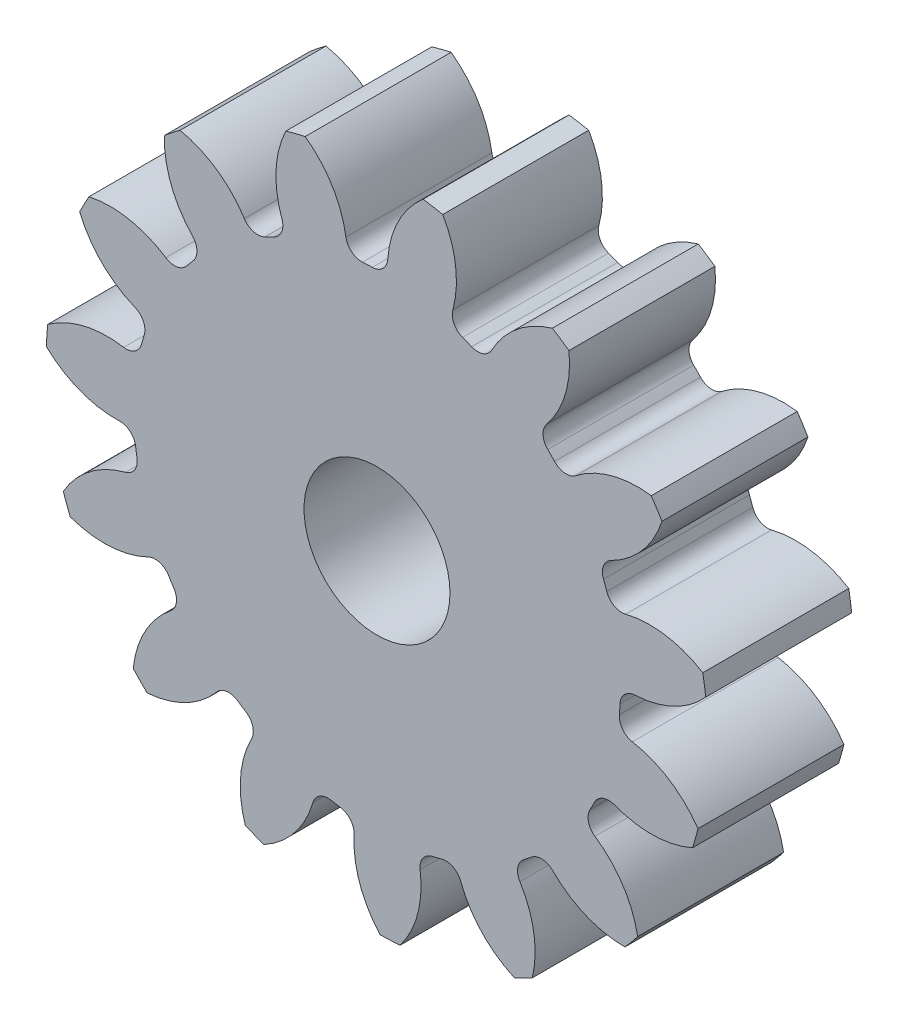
ISO-10303-21;
HEADER;
FILE_DESCRIPTION(('STEP AP214'),'2;1');
FILE_NAME('part.step','',(''),(''),'','','');
FILE_SCHEMA(('AUTOMOTIVE_DESIGN { 1 0 10303 214 1 1 1 1 }'));
ENDSEC;
DATA;
#1=APPLICATION_CONTEXT('core data for automotive mechanical design processes');
#2=APPLICATION_PROTOCOL_DEFINITION('international standard','automotive_design',2000,#1);
#3=PRODUCT_CONTEXT('',#1,'mechanical');
#4=PRODUCT('Part','Part','',(#3));
#5=PRODUCT_RELATED_PRODUCT_CATEGORY('part','',(#4));
#6=PRODUCT_DEFINITION_FORMATION('','',#4);
#7=PRODUCT_DEFINITION_CONTEXT('part definition',#1,'design');
#8=PRODUCT_DEFINITION('design','',#6,#7);
#9=PRODUCT_DEFINITION_SHAPE('','',#8);
#10=(LENGTH_UNIT() NAMED_UNIT(*) SI_UNIT(.MILLI.,.METRE.));
#11=(NAMED_UNIT(*) PLANE_ANGLE_UNIT() SI_UNIT($,.RADIAN.));
#12=(NAMED_UNIT(*) SI_UNIT($,.STERADIAN.) SOLID_ANGLE_UNIT());
#13=UNCERTAINTY_MEASURE_WITH_UNIT(LENGTH_MEASURE(1.E-05),#10,'distance_accuracy_value','');
#14=(GEOMETRIC_REPRESENTATION_CONTEXT(3) GLOBAL_UNCERTAINTY_ASSIGNED_CONTEXT((#13)) GLOBAL_UNIT_ASSIGNED_CONTEXT((#10,
#11,#12)) REPRESENTATION_CONTEXT('',''));
#15=CARTESIAN_POINT('',(0.,0.,0.));
#16=DIRECTION('',(0.,0.,1.));
#17=DIRECTION('',(1.,0.,0.));
#18=AXIS2_PLACEMENT_3D('',#15,#16,#17);
#19=CARTESIAN_POINT('',(0.,0.,127.));
#20=DIRECTION('',(0.,0.,-1.));
#21=DIRECTION('',(-1.,0.,0.));
#22=AXIS2_PLACEMENT_3D('',#19,#20,#21);
#23=CYLINDRICAL_SURFACE('',#22,287.866666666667);
#24=DIRECTION('',(0.,0.,-1.));
#25=VECTOR('',#24,1.);
#26=CARTESIAN_POINT('',(283.498540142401,49.9579374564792,63.5));
#27=LINE('',#26,#25);
#28=CARTESIAN_POINT('',(283.498540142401,49.9579374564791,127.));
#29=VERTEX_POINT('',#28);
#30=CARTESIAN_POINT('',(283.498540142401,49.9579374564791,0.));
#31=VERTEX_POINT('',#30);
#32=EDGE_CURVE('E636',#29,#31,#27,.T.);
#33=ORIENTED_EDGE('',*,*,#32,.F.);
#34=CARTESIAN_POINT('',(0.,0.,127.));
#35=DIRECTION('',(0.,0.,1.));
#36=DIRECTION('',(1.,0.,0.));
#37=AXIS2_PLACEMENT_3D('',#34,#35,#36);
#38=CIRCLE('',#37,287.866666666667);
#39=CARTESIAN_POINT('',(285.995718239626,32.7668571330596,127.));
#40=VERTEX_POINT('',#39);
#41=EDGE_CURVE('E1167',#40,#29,#38,.T.);
#42=ORIENTED_EDGE('',*,*,#41,.F.);
#43=DIRECTION('',(0.,0.,-1.));
#44=VECTOR('',#43,1.);
#45=CARTESIAN_POINT('',(285.995718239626,32.7668571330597,63.5));
#46=LINE('',#45,#44);
#47=CARTESIAN_POINT('',(285.995718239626,32.7668571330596,0.));
#48=VERTEX_POINT('',#47);
#49=EDGE_CURVE('E1161',#48,#40,#46,.F.);
#50=ORIENTED_EDGE('',*,*,#49,.F.);
#51=CARTESIAN_POINT('',(0.,0.,0.));
#52=DIRECTION('',(0.,0.,1.));
#53=DIRECTION('',(1.,0.,0.));
#54=AXIS2_PLACEMENT_3D('',#51,#52,#53);
#55=CIRCLE('',#54,287.866666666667);
#56=EDGE_CURVE('E1172',#48,#31,#55,.T.);
#57=ORIENTED_EDGE('',*,*,#56,.T.);
#58=EDGE_LOOP('',(#33,#42,#50,#57));
#59=FACE_BOUND('',#58,.T.);
#60=ADVANCED_FACE('F33',(#59),#23,.T.);
#61=DIRECTION('',(0.,0.,-1.));
#62=VECTOR('',#61,1.);
#63=CARTESIAN_POINT('',(247.942607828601,146.258951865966,63.5));
#64=LINE('',#63,#62);
#65=CARTESIAN_POINT('',(247.942607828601,146.258951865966,0.));
#66=VERTEX_POINT('',#65);
#67=CARTESIAN_POINT('',(247.942607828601,146.258951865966,127.));
#68=VERTEX_POINT('',#67);
#69=EDGE_CURVE('E607',#66,#68,#64,.F.);
#70=ORIENTED_EDGE('',*,*,#69,.F.);
#71=CARTESIAN_POINT('',(238.66907981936,160.94809137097,0.));
#72=VERTEX_POINT('',#71);
#73=EDGE_CURVE('E1175',#66,#72,#55,.T.);
#74=ORIENTED_EDGE('',*,*,#73,.T.);
#75=DIRECTION('',(0.,0.,-1.));
#76=VECTOR('',#75,1.);
#77=CARTESIAN_POINT('',(238.66907981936,160.94809137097,63.5));
#78=LINE('',#77,#76);
#79=CARTESIAN_POINT('',(238.66907981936,160.94809137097,127.));
#80=VERTEX_POINT('',#79);
#81=EDGE_CURVE('E669',#80,#72,#78,.T.);
#82=ORIENTED_EDGE('',*,*,#81,.F.);
#83=EDGE_CURVE('E1170',#68,#80,#38,.T.);
#84=ORIENTED_EDGE('',*,*,#83,.F.);
#85=EDGE_LOOP('',(#70,#74,#82,#84));
#86=FACE_BOUND('',#85,.T.);
#87=ADVANCED_FACE('F1346',(#86),#23,.T.);
#88=CARTESIAN_POINT('',(0.,0.,127.));
#89=DIRECTION('',(0.,0.,1.));
#90=DIRECTION('',(1.,0.,0.));
#91=AXIS2_PLACEMENT_3D('',#88,#89,#90);
#92=PLANE('',#91);
#93=CARTESIAN_POINT('',(0.,0.,127.000000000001));
#94=DIRECTION('',(0.,0.,1.));
#95=DIRECTION('',(1.,0.,0.));
#96=AXIS2_PLACEMENT_3D('',#93,#94,#95);
#97=CIRCLE('',#96,63.5);
#98=CARTESIAN_POINT('',(63.5,0.,127.000000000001));
#99=VERTEX_POINT('',#98);
#100=EDGE_CURVE('E624',#99,#99,#97,.T.);
#101=ORIENTED_EDGE('',*,*,#100,.F.);
#102=EDGE_LOOP('',(#101));
#103=FACE_BOUND('',#102,.T.);
#104=ORIENTED_EDGE('',*,*,#41,.T.);
#105=CARTESIAN_POINT('',(237.387416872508,-24.8249059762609,127.));
#106=DIRECTION('',(0.,0.,-1.));
#107=DIRECTION('',(0.913545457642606,0.406736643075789,0.));
#108=AXIS2_PLACEMENT_3D('',#105,#106,#107);
#109=CIRCLE('',#108,87.8561856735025);
#110=CARTESIAN_POINT('',(216.317850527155,60.4674309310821,127.));
#111=VERTEX_POINT('',#110);
#112=EDGE_CURVE('E616',#111,#29,#109,.T.);
#113=ORIENTED_EDGE('',*,*,#112,.F.);
#114=CARTESIAN_POINT('',(213.012251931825,73.848922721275,127.));
#115=DIRECTION('',(0.,0.,1.));
#116=DIRECTION('',(-0.913545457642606,-0.406736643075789,0.));
#117=AXIS2_PLACEMENT_3D('',#114,#115,#116);
#118=CIRCLE('',#117,13.7837333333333);
#119=CARTESIAN_POINT('',(199.988970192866,69.3338992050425,127.));
#120=VERTEX_POINT('',#119);
#121=EDGE_CURVE('E614',#120,#111,#118,.T.);
#122=ORIENTED_EDGE('',*,*,#121,.F.);
#123=CARTESIAN_POINT('',(0.,0.,127.));
#124=DIRECTION('',(0.,0.,-1.));
#125=DIRECTION('',(0.913545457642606,0.406736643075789,0.));
#126=AXIS2_PLACEMENT_3D('',#123,#124,#125);
#127=CIRCLE('',#126,211.666666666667);
#128=CARTESIAN_POINT('',(197.06119023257,77.2636077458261,127.));
#129=VERTEX_POINT('',#128);
#130=EDGE_CURVE('E599',#129,#120,#127,.T.);
#131=ORIENTED_EDGE('',*,*,#130,.F.);
#132=CARTESIAN_POINT('',(209.893814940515,82.2950138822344,127.));
#133=DIRECTION('',(0.,0.,1.));
#134=DIRECTION('',(-0.913545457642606,-0.406736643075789,0.));
#135=AXIS2_PLACEMENT_3D('',#132,#133,#134);
#136=CIRCLE('',#135,13.7837333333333);
#137=CARTESIAN_POINT('',(203.710384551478,94.61396242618,127.));
#138=VERTEX_POINT('',#137);
#139=EDGE_CURVE('E591',#138,#129,#136,.T.);
#140=ORIENTED_EDGE('',*,*,#139,.F.);
#141=CARTESIAN_POINT('',(164.297796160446,173.133751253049,127.));
#142=DIRECTION('',(0.,0.,-1.));
#143=DIRECTION('',(-0.913545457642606,-0.406736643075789,0.));
#144=AXIS2_PLACEMENT_3D('',#141,#142,#143);
#145=CIRCLE('',#144,87.8561856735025);
#146=EDGE_CURVE('E621',#68,#138,#145,.T.);
#147=ORIENTED_EDGE('',*,*,#146,.F.);
#148=ORIENTED_EDGE('',*,*,#83,.T.);
#149=CARTESIAN_POINT('',(226.961395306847,73.8754809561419,127.));
#150=DIRECTION('',(0.,0.,-1.));
#151=DIRECTION('',(0.669130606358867,0.743144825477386,0.));
#152=AXIS2_PLACEMENT_3D('',#149,#150,#151);
#153=CIRCLE('',#152,87.8561856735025);
#154=CARTESIAN_POINT('',(173.021869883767,143.224143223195,127.));
#155=VERTEX_POINT('',#154);
#156=EDGE_CURVE('E645',#155,#80,#153,.T.);
#157=ORIENTED_EDGE('',*,*,#156,.F.);
#158=CARTESIAN_POINT('',(164.559312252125,154.104236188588,127.));
#159=DIRECTION('',(0.,0.,1.));
#160=DIRECTION('',(-0.669130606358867,-0.743144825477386,0.));
#161=AXIS2_PLACEMENT_3D('',#158,#159,#160);
#162=CIRCLE('',#161,13.7837333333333);
#163=CARTESIAN_POINT('',(154.498377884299,144.682511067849,127.));
#164=VERTEX_POINT('',#163);
#165=EDGE_CURVE('E643',#164,#155,#162,.T.);
#166=ORIENTED_EDGE('',*,*,#165,.F.);
#167=CARTESIAN_POINT('',(0.,0.,127.));
#168=DIRECTION('',(0.,0.,-1.));
#169=DIRECTION('',(0.669130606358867,0.743144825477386,0.));
#170=AXIS2_PLACEMENT_3D('',#167,#168,#169);
#171=CIRCLE('',#170,211.666666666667);
#172=CARTESIAN_POINT('',(148.598414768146,150.735824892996,127.));
#173=VERTEX_POINT('',#172);
#174=EDGE_CURVE('E640',#173,#164,#171,.T.);
#175=ORIENTED_EDGE('',*,*,#174,.F.);
#176=CARTESIAN_POINT('',(158.275143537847,160.551741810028,127.));
#177=DIRECTION('',(0.,0.,1.));
#178=DIRECTION('',(-0.669130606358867,-0.743144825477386,0.));
#179=AXIS2_PLACEMENT_3D('',#176,#177,#178);
#180=CIRCLE('',#179,13.7837333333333);
#181=CARTESIAN_POINT('',(147.615731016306,169.290633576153,127.));
#182=VERTEX_POINT('',#181);
#183=EDGE_CURVE('E638',#182,#173,#180,.T.);
#184=ORIENTED_EDGE('',*,*,#183,.F.);
#185=CARTESIAN_POINT('',(79.6736645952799,224.991486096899,127.));
#186=DIRECTION('',(0.,0.,-1.));
#187=DIRECTION('',(-0.669130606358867,-0.743144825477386,0.));
#188=AXIS2_PLACEMENT_3D('',#185,#186,#187);
#189=CIRCLE('',#188,87.8561856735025);
#190=CARTESIAN_POINT('',(167.017968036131,234.461545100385,127.));
#191=VERTEX_POINT('',#190);
#192=EDGE_CURVE('E648',#191,#182,#189,.T.);
#193=ORIENTED_EDGE('',*,*,#192,.F.);
#194=CARTESIAN_POINT('',(152.57156735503,244.108858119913,127.));
#195=VERTEX_POINT('',#194);
#196=EDGE_CURVE('E1213',#191,#195,#38,.T.);
#197=ORIENTED_EDGE('',*,*,#196,.T.);
#198=CARTESIAN_POINT('',(177.291686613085,159.802126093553,127.));
#199=DIRECTION('',(0.,0.,-1.));
#200=DIRECTION('',(0.309016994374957,0.95105651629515,0.));
#201=AXIS2_PLACEMENT_3D('',#198,#199,#200);
#202=CIRCLE('',#201,87.8561856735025);
#203=CARTESIAN_POINT('',(99.808836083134,201.216100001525,127.));
#204=VERTEX_POINT('',#203);
#205=EDGE_CURVE('E680',#204,#195,#202,.T.);
#206=ORIENTED_EDGE('',*,*,#205,.F.);
#207=CARTESIAN_POINT('',(87.6525725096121,207.713527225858,127.));
#208=DIRECTION('',(0.,0.,1.));
#209=DIRECTION('',(-0.309016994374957,-0.95105651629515,0.));
#210=AXIS2_PLACEMENT_3D('',#207,#208,#209);
#211=CIRCLE('',#210,13.7837333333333);
#212=CARTESIAN_POINT('',(82.293612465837,195.014202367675,127.));
#213=VERTEX_POINT('',#212);
#214=EDGE_CURVE('E678',#213,#204,#211,.T.);
#215=ORIENTED_EDGE('',*,*,#214,.F.);
#216=CARTESIAN_POINT('',(0.,0.,127.));
#217=DIRECTION('',(0.,0.,-1.));
#218=DIRECTION('',(0.309016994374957,0.95105651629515,0.));
#219=AXIS2_PLACEMENT_3D('',#216,#217,#218);
#220=CIRCLE('',#219,211.666666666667);
#221=CARTESIAN_POINT('',(74.4416234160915,198.144448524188,127.));
#222=VERTEX_POINT('',#221);
#223=EDGE_CURVE('E675',#222,#213,#220,.T.);
#224=ORIENTED_EDGE('',*,*,#223,.F.);
#225=CARTESIAN_POINT('',(79.2892619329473,211.047615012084,127.));
#226=DIRECTION('',(0.,0.,1.));
#227=DIRECTION('',(-0.309016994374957,-0.95105651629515,0.));
#228=AXIS2_PLACEMENT_3D('',#225,#226,#227);
#229=CIRCLE('',#228,13.7837333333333);
#230=CARTESIAN_POINT('',(65.9969765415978,214.695416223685,127.));
#231=VERTEX_POINT('',#230);
#232=EDGE_CURVE('E673',#231,#222,#229,.T.);
#233=ORIENTED_EDGE('',*,*,#232,.F.);
#234=CARTESIAN_POINT('',(-18.7267673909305,237.946149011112,127.));
#235=DIRECTION('',(0.,0.,-1.));
#236=DIRECTION('',(-0.309016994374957,-0.95105651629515,0.));
#237=AXIS2_PLACEMENT_3D('',#234,#235,#236);
#238=CIRCLE('',#237,87.8561856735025);
#239=CARTESIAN_POINT('',(57.2144042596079,282.12360717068,127.));
#240=VERTEX_POINT('',#239);
#241=EDGE_CURVE('E683',#240,#231,#238,.T.);
#242=ORIENTED_EDGE('',*,*,#241,.F.);
#243=CARTESIAN_POINT('',(40.0930448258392,285.060985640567,127.));
#244=VERTEX_POINT('',#243);
#245=EDGE_CURVE('E1328',#240,#244,#38,.T.);
#246=ORIENTED_EDGE('',*,*,#245,.T.);
#247=CARTESIAN_POINT('',(96.966634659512,218.097531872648,127.));
#248=DIRECTION('',(0.,0.,-1.));
#249=DIRECTION('',(-0.104528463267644,0.994521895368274,0.));
#250=AXIS2_PLACEMENT_3D('',#247,#248,#249);
#251=CIRCLE('',#250,87.8561856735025);
#252=CARTESIAN_POINT('',(9.33794778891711,224.415965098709,127.));
#253=VERTEX_POINT('',#252);
#254=EDGE_CURVE('E718',#253,#244,#251,.T.);
#255=ORIENTED_EDGE('',*,*,#254,.F.);
#256=CARTESIAN_POINT('',(-4.41009331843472,225.407262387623,127.));
#257=DIRECTION('',(0.,0.,1.));
#258=DIRECTION('',(0.104528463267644,-0.994521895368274,0.));
#259=AXIS2_PLACEMENT_3D('',#256,#257,#258);
#260=CIRCLE('',#259,13.7837333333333);
#261=CARTESIAN_POINT('',(-4.14046616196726,211.62616642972,127.));
#262=VERTEX_POINT('',#261);
#263=EDGE_CURVE('E716',#262,#253,#260,.T.);
#264=ORIENTED_EDGE('',*,*,#263,.F.);
#265=CARTESIAN_POINT('',(0.,0.,127.));
#266=DIRECTION('',(0.,0.,-1.));
#267=DIRECTION('',(-0.104528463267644,0.994521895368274,0.));
#268=AXIS2_PLACEMENT_3D('',#265,#266,#267);
#269=CIRCLE('',#268,211.666666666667);
#270=CARTESIAN_POINT('',(-12.5868009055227,211.292096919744,127.));
#271=VERTEX_POINT('',#270);
#272=EDGE_CURVE('E713',#271,#262,#269,.T.);
#273=ORIENTED_EDGE('',*,*,#272,.F.);
#274=CARTESIAN_POINT('',(-13.4064533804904,225.051438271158,127.));
#275=DIRECTION('',(0.,0.,1.));
#276=DIRECTION('',(0.104528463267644,-0.994521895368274,0.));
#277=AXIS2_PLACEMENT_3D('',#274,#275,#276);
#278=CIRCLE('',#277,13.7837333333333);
#279=CARTESIAN_POINT('',(-27.0332547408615,222.977410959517,127.));
#280=VERTEX_POINT('',#279);
#281=EDGE_CURVE('E711',#280,#271,#278,.T.);
#282=ORIENTED_EDGE('',*,*,#281,.F.);
#283=CARTESIAN_POINT('',(-113.889171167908,209.757761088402,127.));
#284=DIRECTION('',(0.,0.,-1.));
#285=DIRECTION('',(0.104528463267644,-0.994521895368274,0.));
#286=AXIS2_PLACEMENT_3D('',#283,#284,#285);
#287=CIRCLE('',#286,87.8561856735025);
#288=CARTESIAN_POINT('',(-62.4820497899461,281.003934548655,127.));
#289=VERTEX_POINT('',#288);
#290=EDGE_CURVE('E721',#289,#280,#287,.T.);
#291=ORIENTED_EDGE('',*,*,#290,.F.);
#292=CARTESIAN_POINT('',(-79.3179293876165,276.723479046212,127.));
#293=VERTEX_POINT('',#292);
#294=EDGE_CURVE('E1324',#289,#293,#38,.T.);
#295=ORIENTED_EDGE('',*,*,#294,.T.);
#296=CARTESIAN_POINT('',(-0.124829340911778,238.681893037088,127.));
#297=DIRECTION('',(0.,0.,-1.));
#298=DIRECTION('',(-0.499999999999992,0.866025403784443,0.));
#299=AXIS2_PLACEMENT_3D('',#296,#297,#298);
#300=CIRCLE('',#299,87.8561856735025);
#301=CARTESIAN_POINT('',(-82.747556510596,208.812271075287,127.));
#302=VERTEX_POINT('',#301);
#303=EDGE_CURVE('E756',#302,#293,#300,.T.);
#304=ORIENTED_EDGE('',*,*,#303,.F.);
#305=CARTESIAN_POINT('',(-95.7102139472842,204.126034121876,127.));
#306=DIRECTION('',(0.,0.,1.));
#307=DIRECTION('',(0.499999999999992,-0.866025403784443,0.));
#308=AXIS2_PLACEMENT_3D('',#305,#306,#307);
#309=CIRCLE('',#308,13.7837333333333);
#310=CARTESIAN_POINT('',(-89.8586205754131,191.6460437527,127.));
#311=VERTEX_POINT('',#310);
#312=EDGE_CURVE('E754',#311,#302,#309,.T.);
#313=ORIENTED_EDGE('',*,*,#312,.F.);
#314=CARTESIAN_POINT('',(0.,0.,127.));
#315=DIRECTION('',(0.,0.,-1.));
#316=DIRECTION('',(-0.499999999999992,0.866025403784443,0.));
#317=AXIS2_PLACEMENT_3D('',#314,#315,#316);
#318=CIRCLE('',#317,211.666666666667);
#319=CARTESIAN_POINT('',(-97.4388530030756,187.905422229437,127.));
#320=VERTEX_POINT('',#319);
#321=EDGE_CURVE('E751',#320,#311,#318,.T.);
#322=ORIENTED_EDGE('',*,*,#321,.F.);
#323=CARTESIAN_POINT('',(-103.784071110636,200.141823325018,127.));
#324=DIRECTION('',(0.,0.,1.));
#325=DIRECTION('',(0.499999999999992,-0.866025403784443,0.));
#326=AXIS2_PLACEMENT_3D('',#323,#324,#325);
#327=CIRCLE('',#326,13.7837333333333);
#328=CARTESIAN_POINT('',(-115.389190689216,192.704585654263,127.));
#329=VERTEX_POINT('',#328);
#330=EDGE_CURVE('E749',#329,#320,#327,.T.);
#331=ORIENTED_EDGE('',*,*,#330,.F.);
#332=CARTESIAN_POINT('',(-189.359102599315,145.300350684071,127.));
#333=DIRECTION('',(0.,0.,-1.));
#334=DIRECTION('',(0.499999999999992,-0.866025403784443,0.));
#335=AXIS2_PLACEMENT_3D('',#332,#333,#334);
#336=CIRCLE('',#335,87.8561856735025);
#337=CARTESIAN_POINT('',(-171.374789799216,231.296128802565,127.));
#338=VERTEX_POINT('',#337);
#339=EDGE_CURVE('E759',#338,#329,#336,.T.);
#340=ORIENTED_EDGE('',*,*,#339,.F.);
#341=CARTESIAN_POINT('',(-185.014113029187,220.537968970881,127.));
#342=VERTEX_POINT('',#341);
#343=EDGE_CURVE('E1320',#338,#342,#38,.T.);
#344=ORIENTED_EDGE('',*,*,#343,.T.);
#345=CARTESIAN_POINT('',(-97.194709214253,217.995986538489,127.));
#346=DIRECTION('',(0.,0.,-1.));
#347=DIRECTION('',(-0.809016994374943,0.58778525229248,0.));
#348=AXIS2_PLACEMENT_3D('',#345,#346,#347);
#349=CIRCLE('',#348,87.8561856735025);
#350=CARTESIAN_POINT('',(-160.525256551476,157.103038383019,127.));
#351=VERTEX_POINT('',#350);
#352=EDGE_CURVE('E794',#351,#342,#349,.T.);
#353=ORIENTED_EDGE('',*,*,#352,.F.);
#354=CARTESIAN_POINT('',(-170.461169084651,147.549560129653,127.));
#355=DIRECTION('',(0.,0.,1.));
#356=DIRECTION('',(0.809016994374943,-0.58778525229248,0.));
#357=AXIS2_PLACEMENT_3D('',#354,#355,#356);
#358=CIRCLE('',#357,13.7837333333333);
#359=CARTESIAN_POINT('',(-160.03940315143,138.528579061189,127.));
#360=VERTEX_POINT('',#359);
#361=EDGE_CURVE('E792',#360,#351,#358,.T.);
#362=ORIENTED_EDGE('',*,*,#361,.F.);
#363=CARTESIAN_POINT('',(0.,0.,127.));
#364=DIRECTION('',(0.,0.,-1.));
#365=DIRECTION('',(-0.809016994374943,0.58778525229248,0.));
#366=AXIS2_PLACEMENT_3D('',#363,#364,#365);
#367=CIRCLE('',#366,211.666666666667);
#368=CARTESIAN_POINT('',(-165.442842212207,132.02819296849,127.));
#369=VERTEX_POINT('',#368);
#370=EDGE_CURVE('E789',#369,#360,#367,.T.);
#371=ORIENTED_EDGE('',*,*,#370,.F.);
#372=CARTESIAN_POINT('',(-176.216480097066,140.625868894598,127.));
#373=DIRECTION('',(0.,0.,1.));
#374=DIRECTION('',(0.809016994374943,-0.58778525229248,0.));
#375=AXIS2_PLACEMENT_3D('',#372,#373,#374);
#376=CIRCLE('',#375,13.7837333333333);
#377=CARTESIAN_POINT('',(-183.793287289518,129.111386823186,127.));
#378=VERTEX_POINT('',#377);
#379=EDGE_CURVE('E787',#378,#369,#376,.T.);
#380=ORIENTED_EDGE('',*,*,#379,.F.);
#381=CARTESIAN_POINT('',(-232.08712491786,55.7191896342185,127.));
#382=DIRECTION('',(0.,0.,-1.));
#383=DIRECTION('',(0.809016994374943,-0.58778525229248,0.));
#384=AXIS2_PLACEMENT_3D('',#381,#382,#383);
#385=CIRCLE('',#384,87.8561856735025);
#386=CARTESIAN_POINT('',(-250.635271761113,141.595121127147,127.));
#387=VERTEX_POINT('',#386);
#388=EDGE_CURVE('E797',#387,#378,#385,.T.);
#389=ORIENTED_EDGE('',*,*,#388,.F.);
#390=CARTESIAN_POINT('',(-258.719675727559,126.219440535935,127.));
#391=VERTEX_POINT('',#390);
#392=EDGE_CURVE('E1316',#387,#391,#38,.T.);
#393=ORIENTED_EDGE('',*,*,#392,.T.);
#394=CARTESIAN_POINT('',(-177.458740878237,159.61659353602,127.));
#395=DIRECTION('',(0.,0.,-1.));
#396=DIRECTION('',(-0.978147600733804,0.207911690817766,0.));
#397=AXIS2_PLACEMENT_3D('',#394,#395,#396);
#398=CIRCLE('',#397,87.8561856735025);
#399=CARTESIAN_POINT('',(-210.546681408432,78.2292631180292,127.));
#400=VERTEX_POINT('',#399);
#401=EDGE_CURVE('E832',#400,#391,#398,.T.);
#402=ORIENTED_EDGE('',*,*,#401,.F.);
#403=CARTESIAN_POINT('',(-215.737839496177,65.4604267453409,127.));
#404=DIRECTION('',(0.,0.,1.));
#405=DIRECTION('',(0.978147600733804,-0.207911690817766,0.));
#406=AXIS2_PLACEMENT_3D('',#403,#404,#405);
#407=CIRCLE('',#406,13.7837333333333);
#408=CARTESIAN_POINT('',(-202.54791901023,61.4582645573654,127.));
#409=VERTEX_POINT('',#408);
#410=EDGE_CURVE('E830',#409,#400,#407,.T.);
#411=ORIENTED_EDGE('',*,*,#410,.F.);
#412=CARTESIAN_POINT('',(0.,0.,127.));
#413=DIRECTION('',(0.,0.,-1.));
#414=DIRECTION('',(-0.978147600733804,0.207911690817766,0.));
#415=AXIS2_PLACEMENT_3D('',#412,#413,#414);
#416=CIRCLE('',#415,211.666666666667);
#417=CARTESIAN_POINT('',(-204.840261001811,53.3220897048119,127.));
#418=VERTEX_POINT('',#417);
#419=EDGE_CURVE('E827',#418,#409,#416,.T.);
#420=ORIENTED_EDGE('',*,*,#419,.F.);
#421=CARTESIAN_POINT('',(-218.179458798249,56.7944241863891,127.));
#422=DIRECTION('',(0.,0.,1.));
#423=DIRECTION('',(0.978147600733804,-0.207911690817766,0.));
#424=AXIS2_PLACEMENT_3D('',#421,#422,#423);
#425=CIRCLE('',#424,13.7837333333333);
#426=CARTESIAN_POINT('',(-220.417854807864,43.1936562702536,127.));
#427=VERTEX_POINT('',#426);
#428=EDGE_CURVE('E825',#427,#418,#425,.T.);
#429=ORIENTED_EDGE('',*,*,#428,.F.);
#430=CARTESIAN_POINT('',(-234.685174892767,-43.4963254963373,127.));
#431=DIRECTION('',(0.,0.,-1.));
#432=DIRECTION('',(0.978147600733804,-0.207911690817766,0.));
#433=AXIS2_PLACEMENT_3D('',#430,#431,#432);
#434=CIRCLE('',#433,87.8561856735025);
#435=CARTESIAN_POINT('',(-286.55863828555,27.4110306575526,127.));
#436=VERTEX_POINT('',#435);
#437=EDGE_CURVE('E835',#436,#427,#434,.T.);
#438=ORIENTED_EDGE('',*,*,#437,.F.);
#439=CARTESIAN_POINT('',(-287.690256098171,10.0764241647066,127.));
#440=VERTEX_POINT('',#439);
#441=EDGE_CURVE('E1312',#436,#440,#38,.T.);
#442=ORIENTED_EDGE('',*,*,#441,.T.);
#443=CARTESIAN_POINT('',(-227.038544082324,73.6380414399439,127.));
#444=DIRECTION('',(0.,0.,-1.));
#445=DIRECTION('',(-0.978147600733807,-0.207911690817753,0.));
#446=AXIS2_PLACEMENT_3D('',#443,#444,#445);
#447=CIRCLE('',#446,87.8561856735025);
#448=CARTESIAN_POINT('',(-224.162672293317,-14.1710624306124,127.));
#449=VERTEX_POINT('',#448);
#450=EDGE_CURVE('E870',#449,#440,#447,.T.);
#451=ORIENTED_EDGE('',*,*,#450,.F.);
#452=CARTESIAN_POINT('',(-223.71147754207,-27.9474091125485,127.));
#453=DIRECTION('',(0.,0.,1.));
#454=DIRECTION('',(0.978147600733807,0.207911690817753,0.));
#455=AXIS2_PLACEMENT_3D('',#452,#453,#454);
#456=CIRCLE('',#455,13.7837333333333);
#457=CARTESIAN_POINT('',(-210.034059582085,-26.238742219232,127.));
#458=VERTEX_POINT('',#457);
#459=EDGE_CURVE('E868',#458,#449,#456,.T.);
#460=ORIENTED_EDGE('',*,*,#459,.F.);
#461=CARTESIAN_POINT('',(0.,0.,127.));
#462=DIRECTION('',(0.,0.,-1.));
#463=DIRECTION('',(-0.978147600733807,-0.207911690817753,0.));
#464=AXIS2_PLACEMENT_3D('',#461,#462,#463);
#465=CIRCLE('',#464,211.666666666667);
#466=CARTESIAN_POINT('',(-208.818937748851,-34.6038872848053,127.));
#467=VERTEX_POINT('',#466);
#468=EDGE_CURVE('E865',#467,#458,#465,.T.);
#469=ORIENTED_EDGE('',*,*,#468,.F.);
#470=CARTESIAN_POINT('',(-222.417226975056,-36.8572924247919,127.));
#471=DIRECTION('',(0.,0.,1.));
#472=DIRECTION('',(0.978147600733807,0.207911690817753,0.));
#473=AXIS2_PLACEMENT_3D('',#470,#471,#472);
#474=CIRCLE('',#473,13.7837333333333);
#475=CARTESIAN_POINT('',(-218.930172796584,-50.192649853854,127.));
#476=VERTEX_POINT('',#475);
#477=EDGE_CURVE('E863',#476,#467,#474,.T.);
#478=ORIENTED_EDGE('',*,*,#477,.F.);
#479=CARTESIAN_POINT('',(-196.704026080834,-135.190930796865,127.));
#480=DIRECTION('',(0.,0.,-1.));
#481=DIRECTION('',(0.978147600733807,0.207911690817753,0.));
#482=AXIS2_PLACEMENT_3D('',#479,#480,#481);
#483=CIRCLE('',#482,87.8561856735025);
#484=CARTESIAN_POINT('',(-272.933412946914,-91.5126760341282,127.));
#485=VERTEX_POINT('',#484);
#486=EDGE_CURVE('E873',#485,#476,#483,.T.);
#487=ORIENTED_EDGE('',*,*,#486,.F.);
#488=CARTESIAN_POINT('',(-266.916577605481,-107.80889748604,127.));
#489=VERTEX_POINT('',#488);
#490=EDGE_CURVE('E1308',#485,#489,#38,.T.);
#491=ORIENTED_EDGE('',*,*,#490,.T.);
#492=CARTESIAN_POINT('',(-237.361320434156,-25.0731970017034,127.));
#493=DIRECTION('',(0.,0.,-1.));
#494=DIRECTION('',(-0.80901699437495,-0.587785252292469,0.));
#495=AXIS2_PLACEMENT_3D('',#492,#493,#494);
#496=CIRCLE('',#495,87.8561856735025);
#497=CARTESIAN_POINT('',(-199.018900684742,-104.121082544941,127.));
#498=VERTEX_POINT('',#497);
#499=EDGE_CURVE('E908',#498,#489,#496,.T.);
#500=ORIENTED_EDGE('',*,*,#499,.F.);
#501=CARTESIAN_POINT('',(-193.003368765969,-116.522884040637,127.));
#502=DIRECTION('',(0.,0.,1.));
#503=DIRECTION('',(0.80901699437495,0.587785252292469,0.));
#504=AXIS2_PLACEMENT_3D('',#501,#502,#503);
#505=CIRCLE('',#504,13.7837333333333);
#506=CARTESIAN_POINT('',(-181.203403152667,-109.398832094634,127.));
#507=VERTEX_POINT('',#506);
#508=EDGE_CURVE('E906',#507,#498,#505,.T.);
#509=ORIENTED_EDGE('',*,*,#508,.F.);
#510=CARTESIAN_POINT('',(0.,0.,127.));
#511=DIRECTION('',(0.,0.,-1.));
#512=DIRECTION('',(-0.80901699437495,-0.587785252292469,0.));
#513=AXIS2_PLACEMENT_3D('',#510,#511,#512);
#514=CIRCLE('',#513,211.666666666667);
#515=CARTESIAN_POINT('',(-176.690923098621,-116.546537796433,127.));
#516=VERTEX_POINT('',#515);
#517=EDGE_CURVE('E903',#516,#507,#514,.T.);
#518=ORIENTED_EDGE('',*,*,#517,.F.);
#519=CARTESIAN_POINT('',(-188.197036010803,-124.136048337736,127.));
#520=DIRECTION('',(0.,0.,1.));
#521=DIRECTION('',(0.80901699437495,0.587785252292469,0.));
#522=AXIS2_PLACEMENT_3D('',#519,#520,#521);
#523=CIRCLE('',#522,13.7837333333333);
#524=CARTESIAN_POINT('',(-179.587474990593,-134.900190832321,127.));
#525=VERTEX_POINT('',#524);
#526=EDGE_CURVE('E901',#525,#516,#523,.T.);
#527=ORIENTED_EDGE('',*,*,#526,.F.);
#528=CARTESIAN_POINT('',(-124.710964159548,-203.509795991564,127.));
#529=DIRECTION('',(0.,0.,-1.));
#530=DIRECTION('',(0.80901699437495,0.587785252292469,0.));
#531=AXIS2_PLACEMENT_3D('',#528,#529,#530);
#532=CIRCLE('',#531,87.8561856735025);
#533=CARTESIAN_POINT('',(-212.115520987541,-194.613009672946,127.));
#534=VERTEX_POINT('',#533);
#535=EDGE_CURVE('E911',#534,#525,#532,.T.);
#536=ORIENTED_EDGE('',*,*,#535,.F.);
#537=CARTESIAN_POINT('',(-199.990597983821,-207.053081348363,127.));
#538=VERTEX_POINT('',#537);
#539=EDGE_CURVE('E1304',#534,#538,#38,.T.);
#540=ORIENTED_EDGE('',*,*,#539,.T.);
#541=CARTESIAN_POINT('',(-206.642168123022,-119.449051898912,127.));
#542=DIRECTION('',(0.,0.,-1.));
#543=DIRECTION('',(-0.500000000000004,-0.866025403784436,0.));
#544=AXIS2_PLACEMENT_3D('',#541,#542,#543);
#545=CIRCLE('',#544,87.8561856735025);
#546=CARTESIAN_POINT('',(-139.462953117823,-176.067621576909,127.));
#547=VERTEX_POINT('',#546);
#548=EDGE_CURVE('E946',#547,#538,#545,.T.);
#549=ORIENTED_EDGE('',*,*,#548,.F.);
#550=CARTESIAN_POINT('',(-128.923224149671,-184.95049374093,127.));
#551=DIRECTION('',(0.,0.,1.));
#552=DIRECTION('',(0.500000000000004,0.866025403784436,0.));
#553=AXIS2_PLACEMENT_3D('',#550,#551,#552);
#554=CIRCLE('',#553,13.7837333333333);
#555=CARTESIAN_POINT('',(-121.041032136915,-173.642870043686,127.));
#556=VERTEX_POINT('',#555);
#557=EDGE_CURVE('E944',#556,#547,#554,.T.);
#558=ORIENTED_EDGE('',*,*,#557,.F.);
#559=CARTESIAN_POINT('',(0.,0.,127.));
#560=DIRECTION('',(0.,0.,-1.));
#561=DIRECTION('',(-0.500000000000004,-0.866025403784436,0.));
#562=AXIS2_PLACEMENT_3D('',#559,#560,#561);
#563=CIRCLE('',#562,211.666666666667);
#564=CARTESIAN_POINT('',(-114.011442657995,-178.337233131,127.));
#565=VERTEX_POINT('',#564);
#566=EDGE_CURVE('E941',#565,#556,#563,.T.);
#567=ORIENTED_EDGE('',*,*,#566,.F.);
#568=CARTESIAN_POINT('',(-121.435867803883,-189.950553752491,127.));
#569=DIRECTION('',(0.,0.,1.));
#570=DIRECTION('',(0.500000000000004,0.866025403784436,0.));
#571=AXIS2_PLACEMENT_3D('',#568,#569,#570);
#572=CIRCLE('',#571,13.7837333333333);
#573=CARTESIAN_POINT('',(-109.192471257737,-196.28226328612,127.));
#574=VERTEX_POINT('',#573);
#575=EDGE_CURVE('E939',#574,#565,#572,.T.);
#576=ORIENTED_EDGE('',*,*,#575,.F.);
#577=CARTESIAN_POINT('',(-31.1542435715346,-236.639968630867,127.));
#578=DIRECTION('',(0.,0.,-1.));
#579=DIRECTION('',(0.500000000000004,0.866025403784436,0.));
#580=AXIS2_PLACEMENT_3D('',#577,#578,#579);
#581=CIRCLE('',#580,87.8561856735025);
#582=CARTESIAN_POINT('',(-114.620928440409,-264.062985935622,127.));
#583=VERTEX_POINT('',#582);
#584=EDGE_CURVE('E949',#583,#574,#581,.T.);
#585=ORIENTED_EDGE('',*,*,#584,.F.);
#586=CARTESIAN_POINT('',(-98.4844271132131,-270.495906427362,127.));
#587=VERTEX_POINT('',#586);
#588=EDGE_CURVE('E1300',#583,#587,#38,.T.);
#589=ORIENTED_EDGE('',*,*,#588,.T.);
#590=CARTESIAN_POINT('',(-140.192707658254,-193.17108056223,127.));
#591=DIRECTION('',(0.,0.,-1.));
#592=DIRECTION('',(-0.104528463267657,-0.994521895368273,0.));
#593=AXIS2_PLACEMENT_3D('',#590,#591,#592);
#594=CIRCLE('',#593,87.8561856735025);
#595=CARTESIAN_POINT('',(-55.7925939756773,-217.570469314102,127.));
#596=VERTEX_POINT('',#595);
#597=EDGE_CURVE('E984',#596,#587,#594,.T.);
#598=ORIENTED_EDGE('',*,*,#597,.F.);
#599=CARTESIAN_POINT('',(-42.5510828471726,-221.398482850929,127.));
#600=DIRECTION('',(0.,0.,1.));
#601=DIRECTION('',(0.104528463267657,0.994521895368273,0.));
#602=AXIS2_PLACEMENT_3D('',#599,#600,#601);
#603=CIRCLE('',#602,13.7837333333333);
#604=CARTESIAN_POINT('',(-39.9495670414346,-207.862478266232,127.));
#605=VERTEX_POINT('',#604);
#606=EDGE_CURVE('E982',#605,#596,#603,.T.);
#607=ORIENTED_EDGE('',*,*,#606,.F.);
#608=CARTESIAN_POINT('',(0.,0.,127.));
#609=DIRECTION('',(0.,0.,-1.));
#610=DIRECTION('',(-0.104528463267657,-0.994521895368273,0.));
#611=AXIS2_PLACEMENT_3D('',#608,#609,#610);
#612=CIRCLE('',#611,211.666666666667);
#613=CARTESIAN_POINT('',(-31.6183480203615,-209.291800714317,127.));
#614=VERTEX_POINT('',#613);
#615=EDGE_CURVE('E979',#614,#605,#612,.T.);
#616=ORIENTED_EDGE('',*,*,#615,.F.);
#617=CARTESIAN_POINT('',(-33.6773348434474,-222.920882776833,127.));
#618=DIRECTION('',(0.,0.,1.));
#619=DIRECTION('',(0.104528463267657,0.994521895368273,0.));
#620=AXIS2_PLACEMENT_3D('',#617,#618,#619);
#621=CIRCLE('',#620,13.7837333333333);
#622=CARTESIAN_POINT('',(-19.9170972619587,-223.725349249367,127.));
#623=VERTEX_POINT('',#622);
#624=EDGE_CURVE('E977',#623,#614,#621,.T.);
#625=ORIENTED_EDGE('',*,*,#624,.F.);
#626=CARTESIAN_POINT('',(67.7893287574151,-228.852940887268,127.));
#627=DIRECTION('',(0.,0.,-1.));
#628=DIRECTION('',(0.104528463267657,0.994521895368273,0.));
#629=AXIS2_PLACEMENT_3D('',#626,#627,#628);
#630=CIRCLE('',#629,87.8561856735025);
#631=CARTESIAN_POINT('',(2.69266393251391,-287.854072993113,127.));
#632=VERTEX_POINT('',#631);
#633=EDGE_CURVE('E987',#632,#623,#630,.T.);
#634=ORIENTED_EDGE('',*,*,#633,.F.);
#635=CARTESIAN_POINT('',(20.0505959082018,-287.167531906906,127.));
#636=VERTEX_POINT('',#635);
#637=EDGE_CURVE('E1296',#632,#636,#38,.T.);
#638=ORIENTED_EDGE('',*,*,#637,.T.);
#639=CARTESIAN_POINT('',(-49.5026544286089,-233.492074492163,127.));
#640=DIRECTION('',(0.,0.,-1.));
#641=DIRECTION('',(0.309016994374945,-0.951056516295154,0.));
#642=AXIS2_PLACEMENT_3D('',#639,#640,#641);
#643=CIRCLE('',#642,87.8561856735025);
#644=CARTESIAN_POINT('',(37.5248115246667,-221.453406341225,127.));
#645=VERTEX_POINT('',#644);
#646=EDGE_CURVE('E1022',#645,#636,#643,.T.);
#647=ORIENTED_EDGE('',*,*,#646,.F.);
#648=CARTESIAN_POINT('',(51.1785272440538,-219.564662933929,127.));
#649=DIRECTION('',(0.,0.,1.));
#650=DIRECTION('',(-0.309016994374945,0.951056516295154,0.));
#651=AXIS2_PLACEMENT_3D('',#648,#649,#650);
#652=CIRCLE('',#651,13.7837333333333);
#653=CARTESIAN_POINT('',(48.0495411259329,-206.140775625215,127.));
#654=VERTEX_POINT('',#653);
#655=EDGE_CURVE('E1020',#654,#645,#652,.T.);
#656=ORIENTED_EDGE('',*,*,#655,.F.);
#657=CARTESIAN_POINT('',(0.,0.,127.));
#658=DIRECTION('',(0.,0.,-1.));
#659=DIRECTION('',(0.309016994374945,-0.951056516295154,0.));
#660=AXIS2_PLACEMENT_3D('',#657,#658,#659);
#661=CIRCLE('',#660,211.666666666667);
#662=CARTESIAN_POINT('',(56.2418462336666,-204.057914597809,127.));
#663=VERTEX_POINT('',#662);
#664=EDGE_CURVE('E1017',#663,#654,#661,.T.);
#665=ORIENTED_EDGE('',*,*,#664,.F.);
#666=CARTESIAN_POINT('',(59.904315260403,-217.346165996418,127.));
#667=DIRECTION('',(0.,0.,1.));
#668=DIRECTION('',(-0.309016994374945,0.951056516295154,0.));
#669=AXIS2_PLACEMENT_3D('',#666,#667,#668);
#670=CIRCLE('',#669,13.7837333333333);
#671=CARTESIAN_POINT('',(72.8021237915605,-212.484289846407,127.));
#672=VERTEX_POINT('',#671);
#673=EDGE_CURVE('E1015',#672,#663,#670,.T.);
#674=ORIENTED_EDGE('',*,*,#673,.F.);
#675=CARTESIAN_POINT('',(155.01151029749,-181.495160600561,127.));
#676=DIRECTION('',(0.,0.,-1.));
#677=DIRECTION('',(-0.309016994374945,0.951056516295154,0.));
#678=AXIS2_PLACEMENT_3D('',#675,#676,#677);
#679=CIRCLE('',#678,87.8561856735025);
#680=CARTESIAN_POINT('',(119.540670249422,-261.872575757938,127.));
#681=VERTEX_POINT('',#680);
#682=EDGE_CURVE('E1025',#681,#672,#679,.T.);
#683=ORIENTED_EDGE('',*,*,#682,.F.);
#684=CARTESIAN_POINT('',(135.118688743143,-254.185282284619,127.));
#685=VERTEX_POINT('',#684);
#686=EDGE_CURVE('E1292',#681,#685,#38,.T.);
#687=ORIENTED_EDGE('',*,*,#686,.T.);
#688=CARTESIAN_POINT('',(49.7468574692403,-233.440167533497,127.));
#689=DIRECTION('',(0.,0.,-1.));
#690=DIRECTION('',(0.669130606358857,-0.743144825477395,0.));
#691=AXIS2_PLACEMENT_3D('',#688,#689,#690);
#692=CIRCLE('',#691,87.8561856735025);
#693=CARTESIAN_POINT('',(124.353836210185,-187.045037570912,127.));
#694=VERTEX_POINT('',#693);
#695=EDGE_CURVE('E1060',#694,#685,#692,.T.);
#696=ORIENTED_EDGE('',*,*,#695,.F.);
#697=CARTESIAN_POINT('',(136.058905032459,-179.76611811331,127.));
#698=DIRECTION('',(0.,0.,1.));
#699=DIRECTION('',(-0.669130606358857,0.743144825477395,0.));
#700=AXIS2_PLACEMENT_3D('',#697,#698,#699);
#701=CIRCLE('',#700,13.7837333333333);
#702=CARTESIAN_POINT('',(127.740447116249,-168.775460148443,127.));
#703=VERTEX_POINT('',#702);
#704=EDGE_CURVE('E1058',#703,#694,#701,.T.);
#705=ORIENTED_EDGE('',*,*,#704,.F.);
#706=CARTESIAN_POINT('',(0.,0.,127.));
#707=DIRECTION('',(0.,0.,-1.));
#708=DIRECTION('',(0.669130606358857,-0.743144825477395,0.));
#709=AXIS2_PLACEMENT_3D('',#706,#707,#708);
#710=CIRCLE('',#709,211.666666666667);
#711=CARTESIAN_POINT('',(134.377314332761,-163.540561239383,127.));
#712=VERTEX_POINT('',#711);
#713=EDGE_CURVE('E1055',#712,#703,#710,.T.);
#714=ORIENTED_EDGE('',*,*,#713,.F.);
#715=CARTESIAN_POINT('',(143.12796504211,-174.190322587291,127.));
#716=DIRECTION('',(0.,0.,1.));
#717=DIRECTION('',(-0.669130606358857,0.743144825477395,0.));
#718=AXIS2_PLACEMENT_3D('',#715,#716,#717);
#719=CIRCLE('',#718,13.7837333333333);
#720=CARTESIAN_POINT('',(152.933196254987,-164.502766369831,127.));
#721=VERTEX_POINT('',#720);
#722=EDGE_CURVE('E1053',#721,#712,#719,.T.);
#723=ORIENTED_EDGE('',*,*,#722,.F.);
#724=CARTESIAN_POINT('',(215.430793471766,-102.755218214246,127.));
#725=DIRECTION('',(0.,0.,-1.));
#726=DIRECTION('',(-0.669130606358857,0.743144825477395,0.));
#727=AXIS2_PLACEMENT_3D('',#724,#725,#726);
#728=CIRCLE('',#727,87.8561856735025);
#729=CARTESIAN_POINT('',(215.719008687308,-190.610931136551,127.));
#730=VERTEX_POINT('',#729);
#731=EDGE_CURVE('E1063',#730,#721,#728,.T.);
#732=ORIENTED_EDGE('',*,*,#731,.F.);
#733=CARTESIAN_POINT('',(226.823532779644,-177.252088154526,127.));
#734=VERTEX_POINT('',#733);
#735=EDGE_CURVE('E1291',#730,#734,#38,.T.);
#736=ORIENTED_EDGE('',*,*,#735,.T.);
#737=CARTESIAN_POINT('',(140.394685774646,-193.024334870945,127.));
#738=DIRECTION('',(0.,0.,-1.));
#739=DIRECTION('',(0.913545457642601,-0.406736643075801,0.));
#740=AXIS2_PLACEMENT_3D('',#737,#738,#739);
#741=CIRCLE('',#740,87.8561856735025);
#742=CARTESIAN_POINT('',(189.680952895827,-120.294882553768,127.));
#743=VERTEX_POINT('',#742);
#744=EDGE_CURVE('E1098',#743,#734,#741,.T.);
#745=ORIENTED_EDGE('',*,*,#744,.F.);
#746=CARTESIAN_POINT('',(197.413462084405,-108.884378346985,127.));
#747=DIRECTION('',(0.,0.,1.));
#748=DIRECTION('',(-0.913545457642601,0.406736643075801,0.));
#749=AXIS2_PLACEMENT_3D('',#746,#747,#748);
#750=CIRCLE('',#749,13.7837333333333);
#751=CARTESIAN_POINT('',(185.343869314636,-102.227334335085,127.));
#752=VERTEX_POINT('',#751);
#753=EDGE_CURVE('E1096',#752,#743,#750,.T.);
#754=ORIENTED_EDGE('',*,*,#753,.F.);
#755=CARTESIAN_POINT('',(0.,0.,127.));
#756=DIRECTION('',(0.,0.,-1.));
#757=DIRECTION('',(0.913545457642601,-0.406736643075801,0.));
#758=AXIS2_PLACEMENT_3D('',#755,#756,#757);
#759=CIRCLE('',#758,211.666666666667);
#760=CARTESIAN_POINT('',(189.277724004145,-94.7455591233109,127.));
#761=VERTEX_POINT('',#760);
#762=EDGE_CURVE('E1093',#761,#752,#759,.T.);
#763=ORIENTED_EDGE('',*,*,#762,.F.);
#764=CARTESIAN_POINT('',(201.603489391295,-100.915389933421,127.));
#765=DIRECTION('',(0.,0.,1.));
#766=DIRECTION('',(-0.913545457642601,0.406736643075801,0.));
#767=AXIS2_PLACEMENT_3D('',#764,#765,#766);
#768=CIRCLE('',#767,13.7837333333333);
#769=CARTESIAN_POINT('',(206.620729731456,-88.0772201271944,127.));
#770=VERTEX_POINT('',#769);
#771=EDGE_CURVE('E1091',#770,#761,#768,.T.);
#772=ORIENTED_EDGE('',*,*,#771,.F.);
#773=CARTESIAN_POINT('',(238.600135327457,-6.24796509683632,127.));
#774=DIRECTION('',(0.,0.,-1.));
#775=DIRECTION('',(-0.913545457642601,0.406736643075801,0.));
#776=AXIS2_PLACEMENT_3D('',#773,#774,#775);
#777=CIRCLE('',#776,87.8561856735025);
#778=CARTESIAN_POINT('',(274.597570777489,-86.3909248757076,127.));
#779=VERTEX_POINT('',#778);
#780=EDGE_CURVE('E1101',#779,#770,#777,.T.);
#781=ORIENTED_EDGE('',*,*,#780,.F.);
#782=CARTESIAN_POINT('',(279.308527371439,-69.670397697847,127.));
#783=VERTEX_POINT('',#782);
#784=EDGE_CURVE('E1171',#779,#783,#38,.T.);
#785=ORIENTED_EDGE('',*,*,#784,.T.);
#786=CARTESIAN_POINT('',(206.766997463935,-119.232841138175,127.));
#787=DIRECTION('',(0.,0.,-1.));
#788=DIRECTION('',(1.,0.,0.));
#789=AXIS2_PLACEMENT_3D('',#786,#787,#788);
#790=CIRCLE('',#789,87.8561856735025);
#791=CARTESIAN_POINT('',(222.21050962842,-32.744649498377,127.));
#792=VERTEX_POINT('',#791);
#793=EDGE_CURVE('E1136',#792,#783,#790,.T.);
#794=ORIENTED_EDGE('',*,*,#793,.F.);
#795=CARTESIAN_POINT('',(224.633438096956,-19.1755403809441,127.));
#796=DIRECTION('',(0.,0.,1.));
#797=DIRECTION('',(-1.,0.,0.));
#798=AXIS2_PLACEMENT_3D('',#795,#796,#797);
#799=CIRCLE('',#798,13.7837333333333);
#800=CARTESIAN_POINT('',(210.899652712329,-18.0031737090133,127.));
#801=VERTEX_POINT('',#800);
#802=EDGE_CURVE('E1134',#801,#792,#799,.T.);
#803=ORIENTED_EDGE('',*,*,#802,.F.);
#804=CARTESIAN_POINT('',(0.,0.,127.));
#805=DIRECTION('',(0.,0.,-1.));
#806=DIRECTION('',(1.,0.,0.));
#807=AXIS2_PLACEMENT_3D('',#804,#805,#806);
#808=CIRCLE('',#807,211.666666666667);
#809=CARTESIAN_POINT('',(211.450295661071,-9.56818909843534,127.));
#810=VERTEX_POINT('',#809);
#811=EDGE_CURVE('E1131',#810,#801,#808,.T.);
#812=ORIENTED_EDGE('',*,*,#811,.F.);
#813=CARTESIAN_POINT('',(225.21993891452,-10.1912695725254,127.));
#814=DIRECTION('',(0.,0.,1.));
#815=DIRECTION('',(-1.,0.,0.));
#816=AXIS2_PLACEMENT_3D('',#813,#814,#815);
#817=CIRCLE('',#816,13.7837333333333);
#818=CARTESIAN_POINT('',(224.581661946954,3.5776776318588,127.));
#819=VERTEX_POINT('',#818);
#820=EDGE_CURVE('E1129',#819,#810,#817,.T.);
#821=ORIENTED_EDGE('',*,*,#820,.F.);
#822=CARTESIAN_POINT('',(220.51334617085,91.3396179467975,127.));
#823=DIRECTION('',(0.,0.,-1.));
#824=DIRECTION('',(-1.,0.,0.));
#825=AXIS2_PLACEMENT_3D('',#822,#823,#824);
#826=CIRCLE('',#825,87.8561856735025);
#827=EDGE_CURVE('E1139',#40,#819,#826,.T.);
#828=ORIENTED_EDGE('',*,*,#827,.F.);
#829=EDGE_LOOP('',(#104,#113,#122,#131,#140,#147,#148,#157,#166,#175,#184,#193,#197,#206,#215,
#224,#233,#242,#246,#255,#264,#273,#282,#291,#295,#304,#313,#322,#331,#340,#344,#353,#362,#371,
#380,#389,#393,#402,#411,#420,#429,#438,#442,#451,#460,#469,#478,#487,#491,#500,#509,#518,#527,
#536,#540,#549,#558,#567,#576,#585,#589,#598,#607,#616,#625,#634,#638,#647,#656,#665,#674,#683,
#687,#696,#705,#714,#723,#732,#736,#745,#754,#763,#772,#781,#785,#794,#803,#812,#821,#828));
#830=FACE_BOUND('',#829,.T.);
#831=ADVANCED_FACE('F612',(#103,#830),#92,.T.);
#832=CARTESIAN_POINT('',(0.,0.,0.));
#833=DIRECTION('',(0.,0.,1.));
#834=DIRECTION('',(1.,0.,0.));
#835=AXIS2_PLACEMENT_3D('',#832,#833,#834);
#836=PLANE('',#835);
#837=CARTESIAN_POINT('',(0.,0.,0.));
#838=DIRECTION('',(0.,0.,1.));
#839=DIRECTION('',(1.,0.,0.));
#840=AXIS2_PLACEMENT_3D('',#837,#838,#839);
#841=CIRCLE('',#840,63.5);
#842=CARTESIAN_POINT('',(63.5,0.,-1.77635683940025E-12));
#843=VERTEX_POINT('',#842);
#844=EDGE_CURVE('E36',#843,#843,#841,.T.);
#845=ORIENTED_EDGE('',*,*,#844,.T.);
#846=EDGE_LOOP('',(#845));
#847=FACE_BOUND('',#846,.T.);
#848=CARTESIAN_POINT('',(237.387416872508,-24.8249059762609,0.));
#849=DIRECTION('',(0.,0.,-1.));
#850=DIRECTION('',(0.913545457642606,0.406736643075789,0.));
#851=AXIS2_PLACEMENT_3D('',#848,#849,#850);
#852=CIRCLE('',#851,87.8561856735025);
#853=CARTESIAN_POINT('',(216.317850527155,60.4674309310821,0.));
#854=VERTEX_POINT('',#853);
#855=EDGE_CURVE('E600',#854,#31,#852,.T.);
#856=ORIENTED_EDGE('',*,*,#855,.T.);
#857=ORIENTED_EDGE('',*,*,#56,.F.);
#858=CARTESIAN_POINT('',(220.51334617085,91.3396179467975,0.));
#859=DIRECTION('',(0.,0.,1.));
#860=DIRECTION('',(1.,0.,0.));
#861=AXIS2_PLACEMENT_3D('',#858,#859,#860);
#862=CIRCLE('',#861,87.8561856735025);
#863=CARTESIAN_POINT('',(224.581661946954,3.5776776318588,0.));
#864=VERTEX_POINT('',#863);
#865=EDGE_CURVE('E1169',#864,#48,#862,.T.);
#866=ORIENTED_EDGE('',*,*,#865,.F.);
#867=CARTESIAN_POINT('',(225.21993891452,-10.1912695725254,0.));
#868=DIRECTION('',(0.,0.,1.));
#869=DIRECTION('',(-1.,0.,0.));
#870=AXIS2_PLACEMENT_3D('',#867,#868,#869);
#871=CIRCLE('',#870,13.7837333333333);
#872=CARTESIAN_POINT('',(211.450295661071,-9.56818909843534,0.));
#873=VERTEX_POINT('',#872);
#874=EDGE_CURVE('E1128',#864,#873,#871,.T.);
#875=ORIENTED_EDGE('',*,*,#874,.T.);
#876=CARTESIAN_POINT('',(0.,0.,0.));
#877=DIRECTION('',(0.,0.,-1.));
#878=DIRECTION('',(1.,0.,0.));
#879=AXIS2_PLACEMENT_3D('',#876,#877,#878);
#880=CIRCLE('',#879,211.666666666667);
#881=CARTESIAN_POINT('',(210.899652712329,-18.0031737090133,0.));
#882=VERTEX_POINT('',#881);
#883=EDGE_CURVE('E1144',#873,#882,#880,.T.);
#884=ORIENTED_EDGE('',*,*,#883,.T.);
#885=CARTESIAN_POINT('',(224.633438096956,-19.1755403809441,0.));
#886=DIRECTION('',(0.,0.,1.));
#887=DIRECTION('',(-1.,0.,0.));
#888=AXIS2_PLACEMENT_3D('',#885,#886,#887);
#889=CIRCLE('',#888,13.7837333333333);
#890=CARTESIAN_POINT('',(222.21050962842,-32.744649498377,0.));
#891=VERTEX_POINT('',#890);
#892=EDGE_CURVE('E1147',#882,#891,#889,.T.);
#893=ORIENTED_EDGE('',*,*,#892,.T.);
#894=CARTESIAN_POINT('',(206.766997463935,-119.232841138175,0.));
#895=DIRECTION('',(0.,0.,-1.));
#896=DIRECTION('',(1.,0.,0.));
#897=AXIS2_PLACEMENT_3D('',#894,#895,#896);
#898=CIRCLE('',#897,87.8561856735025);
#899=CARTESIAN_POINT('',(279.308527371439,-69.670397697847,0.));
#900=VERTEX_POINT('',#899);
#901=EDGE_CURVE('E1132',#891,#900,#898,.T.);
#902=ORIENTED_EDGE('',*,*,#901,.T.);
#903=CARTESIAN_POINT('',(274.597570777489,-86.3909248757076,0.));
#904=VERTEX_POINT('',#903);
#905=EDGE_CURVE('E1166',#904,#900,#55,.T.);
#906=ORIENTED_EDGE('',*,*,#905,.F.);
#907=CARTESIAN_POINT('',(238.600135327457,-6.24796509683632,0.));
#908=DIRECTION('',(0.,0.,1.));
#909=DIRECTION('',(1.,0.,0.));
#910=AXIS2_PLACEMENT_3D('',#907,#908,#909);
#911=CIRCLE('',#910,87.8561856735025);
#912=CARTESIAN_POINT('',(206.620729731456,-88.0772201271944,0.));
#913=VERTEX_POINT('',#912);
#914=EDGE_CURVE('E1177',#913,#904,#911,.T.);
#915=ORIENTED_EDGE('',*,*,#914,.F.);
#916=CARTESIAN_POINT('',(201.603489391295,-100.915389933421,0.));
#917=DIRECTION('',(0.,0.,1.));
#918=DIRECTION('',(-0.913545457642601,0.406736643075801,0.));
#919=AXIS2_PLACEMENT_3D('',#916,#917,#918);
#920=CIRCLE('',#919,13.7837333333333);
#921=CARTESIAN_POINT('',(189.277724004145,-94.7455591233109,0.));
#922=VERTEX_POINT('',#921);
#923=EDGE_CURVE('E1090',#913,#922,#920,.T.);
#924=ORIENTED_EDGE('',*,*,#923,.T.);
#925=CARTESIAN_POINT('',(0.,0.,0.));
#926=DIRECTION('',(0.,0.,-1.));
#927=DIRECTION('',(0.913545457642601,-0.406736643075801,0.));
#928=AXIS2_PLACEMENT_3D('',#925,#926,#927);
#929=CIRCLE('',#928,211.666666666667);
#930=CARTESIAN_POINT('',(185.343869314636,-102.227334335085,0.));
#931=VERTEX_POINT('',#930);
#932=EDGE_CURVE('E1106',#922,#931,#929,.T.);
#933=ORIENTED_EDGE('',*,*,#932,.T.);
#934=CARTESIAN_POINT('',(197.413462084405,-108.884378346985,0.));
#935=DIRECTION('',(0.,0.,1.));
#936=DIRECTION('',(-0.913545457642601,0.406736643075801,0.));
#937=AXIS2_PLACEMENT_3D('',#934,#935,#936);
#938=CIRCLE('',#937,13.7837333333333);
#939=CARTESIAN_POINT('',(189.680952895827,-120.294882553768,0.));
#940=VERTEX_POINT('',#939);
#941=EDGE_CURVE('E1109',#931,#940,#938,.T.);
#942=ORIENTED_EDGE('',*,*,#941,.T.);
#943=CARTESIAN_POINT('',(140.394685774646,-193.024334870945,0.));
#944=DIRECTION('',(0.,0.,-1.));
#945=DIRECTION('',(0.913545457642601,-0.406736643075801,0.));
#946=AXIS2_PLACEMENT_3D('',#943,#944,#945);
#947=CIRCLE('',#946,87.8561856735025);
#948=CARTESIAN_POINT('',(226.823532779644,-177.252088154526,0.));
#949=VERTEX_POINT('',#948);
#950=EDGE_CURVE('E1094',#940,#949,#947,.T.);
#951=ORIENTED_EDGE('',*,*,#950,.T.);
#952=CARTESIAN_POINT('',(215.719008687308,-190.610931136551,0.));
#953=VERTEX_POINT('',#952);
#954=EDGE_CURVE('E1262',#953,#949,#55,.T.);
#955=ORIENTED_EDGE('',*,*,#954,.F.);
#956=CARTESIAN_POINT('',(215.430793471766,-102.755218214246,0.));
#957=DIRECTION('',(0.,0.,1.));
#958=DIRECTION('',(1.,0.,0.));
#959=AXIS2_PLACEMENT_3D('',#956,#957,#958);
#960=CIRCLE('',#959,87.8561856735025);
#961=CARTESIAN_POINT('',(152.933196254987,-164.502766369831,0.));
#962=VERTEX_POINT('',#961);
#963=EDGE_CURVE('E1179',#962,#953,#960,.T.);
#964=ORIENTED_EDGE('',*,*,#963,.F.);
#965=CARTESIAN_POINT('',(143.12796504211,-174.190322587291,0.));
#966=DIRECTION('',(0.,0.,1.));
#967=DIRECTION('',(-0.669130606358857,0.743144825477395,0.));
#968=AXIS2_PLACEMENT_3D('',#965,#966,#967);
#969=CIRCLE('',#968,13.7837333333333);
#970=CARTESIAN_POINT('',(134.377314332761,-163.540561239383,0.));
#971=VERTEX_POINT('',#970);
#972=EDGE_CURVE('E1052',#962,#971,#969,.T.);
#973=ORIENTED_EDGE('',*,*,#972,.T.);
#974=CARTESIAN_POINT('',(0.,0.,0.));
#975=DIRECTION('',(0.,0.,-1.));
#976=DIRECTION('',(0.669130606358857,-0.743144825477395,0.));
#977=AXIS2_PLACEMENT_3D('',#974,#975,#976);
#978=CIRCLE('',#977,211.666666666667);
#979=CARTESIAN_POINT('',(127.740447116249,-168.775460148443,0.));
#980=VERTEX_POINT('',#979);
#981=EDGE_CURVE('E1068',#971,#980,#978,.T.);
#982=ORIENTED_EDGE('',*,*,#981,.T.);
#983=CARTESIAN_POINT('',(136.058905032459,-179.76611811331,0.));
#984=DIRECTION('',(0.,0.,1.));
#985=DIRECTION('',(-0.669130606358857,0.743144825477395,0.));
#986=AXIS2_PLACEMENT_3D('',#983,#984,#985);
#987=CIRCLE('',#986,13.7837333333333);
#988=CARTESIAN_POINT('',(124.353836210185,-187.045037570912,0.));
#989=VERTEX_POINT('',#988);
#990=EDGE_CURVE('E1071',#980,#989,#987,.T.);
#991=ORIENTED_EDGE('',*,*,#990,.T.);
#992=CARTESIAN_POINT('',(49.7468574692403,-233.440167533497,0.));
#993=DIRECTION('',(0.,0.,-1.));
#994=DIRECTION('',(0.669130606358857,-0.743144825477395,0.));
#995=AXIS2_PLACEMENT_3D('',#992,#993,#994);
#996=CIRCLE('',#995,87.8561856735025);
#997=CARTESIAN_POINT('',(135.118688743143,-254.185282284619,0.));
#998=VERTEX_POINT('',#997);
#999=EDGE_CURVE('E1056',#989,#998,#996,.T.);
#1000=ORIENTED_EDGE('',*,*,#999,.T.);
#1001=CARTESIAN_POINT('',(119.540670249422,-261.872575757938,0.));
#1002=VERTEX_POINT('',#1001);
#1003=EDGE_CURVE('E1257',#1002,#998,#55,.T.);
#1004=ORIENTED_EDGE('',*,*,#1003,.F.);
#1005=CARTESIAN_POINT('',(155.01151029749,-181.495160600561,0.));
#1006=DIRECTION('',(0.,0.,1.));
#1007=DIRECTION('',(1.,0.,0.));
#1008=AXIS2_PLACEMENT_3D('',#1005,#1006,#1007);
#1009=CIRCLE('',#1008,87.8561856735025);
#1010=CARTESIAN_POINT('',(72.8021237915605,-212.484289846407,0.));
#1011=VERTEX_POINT('',#1010);
#1012=EDGE_CURVE('E1181',#1011,#1002,#1009,.T.);
#1013=ORIENTED_EDGE('',*,*,#1012,.F.);
#1014=CARTESIAN_POINT('',(59.904315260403,-217.346165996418,0.));
#1015=DIRECTION('',(0.,0.,1.));
#1016=DIRECTION('',(-0.309016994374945,0.951056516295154,0.));
#1017=AXIS2_PLACEMENT_3D('',#1014,#1015,#1016);
#1018=CIRCLE('',#1017,13.7837333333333);
#1019=CARTESIAN_POINT('',(56.2418462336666,-204.057914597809,0.));
#1020=VERTEX_POINT('',#1019);
#1021=EDGE_CURVE('E1014',#1011,#1020,#1018,.T.);
#1022=ORIENTED_EDGE('',*,*,#1021,.T.);
#1023=CARTESIAN_POINT('',(0.,0.,0.));
#1024=DIRECTION('',(0.,0.,-1.));
#1025=DIRECTION('',(0.309016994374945,-0.951056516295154,0.));
#1026=AXIS2_PLACEMENT_3D('',#1023,#1024,#1025);
#1027=CIRCLE('',#1026,211.666666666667);
#1028=CARTESIAN_POINT('',(48.0495411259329,-206.140775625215,0.));
#1029=VERTEX_POINT('',#1028);
#1030=EDGE_CURVE('E1030',#1020,#1029,#1027,.T.);
#1031=ORIENTED_EDGE('',*,*,#1030,.T.);
#1032=CARTESIAN_POINT('',(51.1785272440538,-219.564662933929,0.));
#1033=DIRECTION('',(0.,0.,1.));
#1034=DIRECTION('',(-0.309016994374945,0.951056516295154,0.));
#1035=AXIS2_PLACEMENT_3D('',#1032,#1033,#1034);
#1036=CIRCLE('',#1035,13.7837333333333);
#1037=CARTESIAN_POINT('',(37.5248115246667,-221.453406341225,0.));
#1038=VERTEX_POINT('',#1037);
#1039=EDGE_CURVE('E1033',#1029,#1038,#1036,.T.);
#1040=ORIENTED_EDGE('',*,*,#1039,.T.);
#1041=CARTESIAN_POINT('',(-49.5026544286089,-233.492074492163,0.));
#1042=DIRECTION('',(0.,0.,-1.));
#1043=DIRECTION('',(0.309016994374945,-0.951056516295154,0.));
#1044=AXIS2_PLACEMENT_3D('',#1041,#1042,#1043);
#1045=CIRCLE('',#1044,87.8561856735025);
#1046=CARTESIAN_POINT('',(20.0505959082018,-287.167531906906,0.));
#1047=VERTEX_POINT('',#1046);
#1048=EDGE_CURVE('E1018',#1038,#1047,#1045,.T.);
#1049=ORIENTED_EDGE('',*,*,#1048,.T.);
#1050=CARTESIAN_POINT('',(2.69266393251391,-287.854072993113,0.));
#1051=VERTEX_POINT('',#1050);
#1052=EDGE_CURVE('E1252',#1051,#1047,#55,.T.);
#1053=ORIENTED_EDGE('',*,*,#1052,.F.);
#1054=CARTESIAN_POINT('',(67.7893287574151,-228.852940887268,0.));
#1055=DIRECTION('',(0.,0.,1.));
#1056=DIRECTION('',(1.,0.,0.));
#1057=AXIS2_PLACEMENT_3D('',#1054,#1055,#1056);
#1058=CIRCLE('',#1057,87.8561856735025);
#1059=CARTESIAN_POINT('',(-19.9170972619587,-223.725349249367,0.));
#1060=VERTEX_POINT('',#1059);
#1061=EDGE_CURVE('E1183',#1060,#1051,#1058,.T.);
#1062=ORIENTED_EDGE('',*,*,#1061,.F.);
#1063=CARTESIAN_POINT('',(-33.6773348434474,-222.920882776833,0.));
#1064=DIRECTION('',(0.,0.,1.));
#1065=DIRECTION('',(0.104528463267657,0.994521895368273,0.));
#1066=AXIS2_PLACEMENT_3D('',#1063,#1064,#1065);
#1067=CIRCLE('',#1066,13.7837333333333);
#1068=CARTESIAN_POINT('',(-31.6183480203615,-209.291800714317,0.));
#1069=VERTEX_POINT('',#1068);
#1070=EDGE_CURVE('E976',#1060,#1069,#1067,.T.);
#1071=ORIENTED_EDGE('',*,*,#1070,.T.);
#1072=CARTESIAN_POINT('',(0.,0.,0.));
#1073=DIRECTION('',(0.,0.,-1.));
#1074=DIRECTION('',(-0.104528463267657,-0.994521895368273,0.));
#1075=AXIS2_PLACEMENT_3D('',#1072,#1073,#1074);
#1076=CIRCLE('',#1075,211.666666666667);
#1077=CARTESIAN_POINT('',(-39.9495670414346,-207.862478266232,0.));
#1078=VERTEX_POINT('',#1077);
#1079=EDGE_CURVE('E992',#1069,#1078,#1076,.T.);
#1080=ORIENTED_EDGE('',*,*,#1079,.T.);
#1081=CARTESIAN_POINT('',(-42.5510828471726,-221.398482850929,0.));
#1082=DIRECTION('',(0.,0.,1.));
#1083=DIRECTION('',(0.104528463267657,0.994521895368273,0.));
#1084=AXIS2_PLACEMENT_3D('',#1081,#1082,#1083);
#1085=CIRCLE('',#1084,13.7837333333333);
#1086=CARTESIAN_POINT('',(-55.7925939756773,-217.570469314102,0.));
#1087=VERTEX_POINT('',#1086);
#1088=EDGE_CURVE('E995',#1078,#1087,#1085,.T.);
#1089=ORIENTED_EDGE('',*,*,#1088,.T.);
#1090=CARTESIAN_POINT('',(-140.192707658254,-193.17108056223,0.));
#1091=DIRECTION('',(0.,0.,-1.));
#1092=DIRECTION('',(-0.104528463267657,-0.994521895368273,0.));
#1093=AXIS2_PLACEMENT_3D('',#1090,#1091,#1092);
#1094=CIRCLE('',#1093,87.8561856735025);
#1095=CARTESIAN_POINT('',(-98.4844271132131,-270.495906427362,0.));
#1096=VERTEX_POINT('',#1095);
#1097=EDGE_CURVE('E980',#1087,#1096,#1094,.T.);
#1098=ORIENTED_EDGE('',*,*,#1097,.T.);
#1099=CARTESIAN_POINT('',(-114.620928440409,-264.062985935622,0.));
#1100=VERTEX_POINT('',#1099);
#1101=EDGE_CURVE('E1247',#1100,#1096,#55,.T.);
#1102=ORIENTED_EDGE('',*,*,#1101,.F.);
#1103=CARTESIAN_POINT('',(-31.1542435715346,-236.639968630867,0.));
#1104=DIRECTION('',(0.,0.,1.));
#1105=DIRECTION('',(1.,0.,0.));
#1106=AXIS2_PLACEMENT_3D('',#1103,#1104,#1105);
#1107=CIRCLE('',#1106,87.8561856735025);
#1108=CARTESIAN_POINT('',(-109.192471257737,-196.28226328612,0.));
#1109=VERTEX_POINT('',#1108);
#1110=EDGE_CURVE('E1185',#1109,#1100,#1107,.T.);
#1111=ORIENTED_EDGE('',*,*,#1110,.F.);
#1112=CARTESIAN_POINT('',(-121.435867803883,-189.950553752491,0.));
#1113=DIRECTION('',(0.,0.,1.));
#1114=DIRECTION('',(0.500000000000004,0.866025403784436,0.));
#1115=AXIS2_PLACEMENT_3D('',#1112,#1113,#1114);
#1116=CIRCLE('',#1115,13.7837333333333);
#1117=CARTESIAN_POINT('',(-114.011442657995,-178.337233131,0.));
#1118=VERTEX_POINT('',#1117);
#1119=EDGE_CURVE('E938',#1109,#1118,#1116,.T.);
#1120=ORIENTED_EDGE('',*,*,#1119,.T.);
#1121=CARTESIAN_POINT('',(0.,0.,0.));
#1122=DIRECTION('',(0.,0.,-1.));
#1123=DIRECTION('',(-0.500000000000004,-0.866025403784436,0.));
#1124=AXIS2_PLACEMENT_3D('',#1121,#1122,#1123);
#1125=CIRCLE('',#1124,211.666666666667);
#1126=CARTESIAN_POINT('',(-121.041032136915,-173.642870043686,0.));
#1127=VERTEX_POINT('',#1126);
#1128=EDGE_CURVE('E954',#1118,#1127,#1125,.T.);
#1129=ORIENTED_EDGE('',*,*,#1128,.T.);
#1130=CARTESIAN_POINT('',(-128.923224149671,-184.95049374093,0.));
#1131=DIRECTION('',(0.,0.,1.));
#1132=DIRECTION('',(0.500000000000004,0.866025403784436,0.));
#1133=AXIS2_PLACEMENT_3D('',#1130,#1131,#1132);
#1134=CIRCLE('',#1133,13.7837333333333);
#1135=CARTESIAN_POINT('',(-139.462953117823,-176.067621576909,0.));
#1136=VERTEX_POINT('',#1135);
#1137=EDGE_CURVE('E957',#1127,#1136,#1134,.T.);
#1138=ORIENTED_EDGE('',*,*,#1137,.T.);
#1139=CARTESIAN_POINT('',(-206.642168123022,-119.449051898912,0.));
#1140=DIRECTION('',(0.,0.,-1.));
#1141=DIRECTION('',(-0.500000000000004,-0.866025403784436,0.));
#1142=AXIS2_PLACEMENT_3D('',#1139,#1140,#1141);
#1143=CIRCLE('',#1142,87.8561856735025);
#1144=CARTESIAN_POINT('',(-199.990597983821,-207.053081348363,0.));
#1145=VERTEX_POINT('',#1144);
#1146=EDGE_CURVE('E942',#1136,#1145,#1143,.T.);
#1147=ORIENTED_EDGE('',*,*,#1146,.T.);
#1148=CARTESIAN_POINT('',(-212.115520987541,-194.613009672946,0.));
#1149=VERTEX_POINT('',#1148);
#1150=EDGE_CURVE('E1242',#1149,#1145,#55,.T.);
#1151=ORIENTED_EDGE('',*,*,#1150,.F.);
#1152=CARTESIAN_POINT('',(-124.710964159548,-203.509795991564,0.));
#1153=DIRECTION('',(0.,0.,1.));
#1154=DIRECTION('',(1.,0.,0.));
#1155=AXIS2_PLACEMENT_3D('',#1152,#1153,#1154);
#1156=CIRCLE('',#1155,87.8561856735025);
#1157=CARTESIAN_POINT('',(-179.587474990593,-134.900190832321,0.));
#1158=VERTEX_POINT('',#1157);
#1159=EDGE_CURVE('E1187',#1158,#1149,#1156,.T.);
#1160=ORIENTED_EDGE('',*,*,#1159,.F.);
#1161=CARTESIAN_POINT('',(-188.197036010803,-124.136048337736,0.));
#1162=DIRECTION('',(0.,0.,1.));
#1163=DIRECTION('',(0.80901699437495,0.587785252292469,0.));
#1164=AXIS2_PLACEMENT_3D('',#1161,#1162,#1163);
#1165=CIRCLE('',#1164,13.7837333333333);
#1166=CARTESIAN_POINT('',(-176.690923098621,-116.546537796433,0.));
#1167=VERTEX_POINT('',#1166);
#1168=EDGE_CURVE('E900',#1158,#1167,#1165,.T.);
#1169=ORIENTED_EDGE('',*,*,#1168,.T.);
#1170=CARTESIAN_POINT('',(0.,0.,0.));
#1171=DIRECTION('',(0.,0.,-1.));
#1172=DIRECTION('',(-0.80901699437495,-0.587785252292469,0.));
#1173=AXIS2_PLACEMENT_3D('',#1170,#1171,#1172);
#1174=CIRCLE('',#1173,211.666666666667);
#1175=CARTESIAN_POINT('',(-181.203403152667,-109.398832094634,0.));
#1176=VERTEX_POINT('',#1175);
#1177=EDGE_CURVE('E916',#1167,#1176,#1174,.T.);
#1178=ORIENTED_EDGE('',*,*,#1177,.T.);
#1179=CARTESIAN_POINT('',(-193.003368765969,-116.522884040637,0.));
#1180=DIRECTION('',(0.,0.,1.));
#1181=DIRECTION('',(0.80901699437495,0.587785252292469,0.));
#1182=AXIS2_PLACEMENT_3D('',#1179,#1180,#1181);
#1183=CIRCLE('',#1182,13.7837333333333);
#1184=CARTESIAN_POINT('',(-199.018900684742,-104.121082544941,0.));
#1185=VERTEX_POINT('',#1184);
#1186=EDGE_CURVE('E919',#1176,#1185,#1183,.T.);
#1187=ORIENTED_EDGE('',*,*,#1186,.T.);
#1188=CARTESIAN_POINT('',(-237.361320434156,-25.0731970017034,0.));
#1189=DIRECTION('',(0.,0.,-1.));
#1190=DIRECTION('',(-0.80901699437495,-0.587785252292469,0.));
#1191=AXIS2_PLACEMENT_3D('',#1188,#1189,#1190);
#1192=CIRCLE('',#1191,87.8561856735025);
#1193=CARTESIAN_POINT('',(-266.916577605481,-107.80889748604,0.));
#1194=VERTEX_POINT('',#1193);
#1195=EDGE_CURVE('E904',#1185,#1194,#1192,.T.);
#1196=ORIENTED_EDGE('',*,*,#1195,.T.);
#1197=CARTESIAN_POINT('',(-272.933412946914,-91.5126760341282,0.));
#1198=VERTEX_POINT('',#1197);
#1199=EDGE_CURVE('E1237',#1198,#1194,#55,.T.);
#1200=ORIENTED_EDGE('',*,*,#1199,.F.);
#1201=CARTESIAN_POINT('',(-196.704026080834,-135.190930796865,0.));
#1202=DIRECTION('',(0.,0.,1.));
#1203=DIRECTION('',(1.,0.,0.));
#1204=AXIS2_PLACEMENT_3D('',#1201,#1202,#1203);
#1205=CIRCLE('',#1204,87.8561856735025);
#1206=CARTESIAN_POINT('',(-218.930172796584,-50.192649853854,0.));
#1207=VERTEX_POINT('',#1206);
#1208=EDGE_CURVE('E1189',#1207,#1198,#1205,.T.);
#1209=ORIENTED_EDGE('',*,*,#1208,.F.);
#1210=CARTESIAN_POINT('',(-222.417226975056,-36.8572924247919,0.));
#1211=DIRECTION('',(0.,0.,1.));
#1212=DIRECTION('',(0.978147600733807,0.207911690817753,0.));
#1213=AXIS2_PLACEMENT_3D('',#1210,#1211,#1212);
#1214=CIRCLE('',#1213,13.7837333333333);
#1215=CARTESIAN_POINT('',(-208.818937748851,-34.6038872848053,0.));
#1216=VERTEX_POINT('',#1215);
#1217=EDGE_CURVE('E862',#1207,#1216,#1214,.T.);
#1218=ORIENTED_EDGE('',*,*,#1217,.T.);
#1219=CARTESIAN_POINT('',(0.,0.,0.));
#1220=DIRECTION('',(0.,0.,-1.));
#1221=DIRECTION('',(-0.978147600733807,-0.207911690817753,0.));
#1222=AXIS2_PLACEMENT_3D('',#1219,#1220,#1221);
#1223=CIRCLE('',#1222,211.666666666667);
#1224=CARTESIAN_POINT('',(-210.034059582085,-26.238742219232,0.));
#1225=VERTEX_POINT('',#1224);
#1226=EDGE_CURVE('E878',#1216,#1225,#1223,.T.);
#1227=ORIENTED_EDGE('',*,*,#1226,.T.);
#1228=CARTESIAN_POINT('',(-223.71147754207,-27.9474091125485,0.));
#1229=DIRECTION('',(0.,0.,1.));
#1230=DIRECTION('',(0.978147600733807,0.207911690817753,0.));
#1231=AXIS2_PLACEMENT_3D('',#1228,#1229,#1230);
#1232=CIRCLE('',#1231,13.7837333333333);
#1233=CARTESIAN_POINT('',(-224.162672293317,-14.1710624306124,0.));
#1234=VERTEX_POINT('',#1233);
#1235=EDGE_CURVE('E881',#1225,#1234,#1232,.T.);
#1236=ORIENTED_EDGE('',*,*,#1235,.T.);
#1237=CARTESIAN_POINT('',(-227.038544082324,73.6380414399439,0.));
#1238=DIRECTION('',(0.,0.,-1.));
#1239=DIRECTION('',(-0.978147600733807,-0.207911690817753,0.));
#1240=AXIS2_PLACEMENT_3D('',#1237,#1238,#1239);
#1241=CIRCLE('',#1240,87.8561856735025);
#1242=CARTESIAN_POINT('',(-287.690256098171,10.0764241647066,0.));
#1243=VERTEX_POINT('',#1242);
#1244=EDGE_CURVE('E866',#1234,#1243,#1241,.T.);
#1245=ORIENTED_EDGE('',*,*,#1244,.T.);
#1246=CARTESIAN_POINT('',(-286.55863828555,27.4110306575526,0.));
#1247=VERTEX_POINT('',#1246);
#1248=EDGE_CURVE('E1232',#1247,#1243,#55,.T.);
#1249=ORIENTED_EDGE('',*,*,#1248,.F.);
#1250=CARTESIAN_POINT('',(-234.685174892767,-43.4963254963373,0.));
#1251=DIRECTION('',(0.,0.,1.));
#1252=DIRECTION('',(1.,0.,0.));
#1253=AXIS2_PLACEMENT_3D('',#1250,#1251,#1252);
#1254=CIRCLE('',#1253,87.8561856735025);
#1255=CARTESIAN_POINT('',(-220.417854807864,43.1936562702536,0.));
#1256=VERTEX_POINT('',#1255);
#1257=EDGE_CURVE('E1191',#1256,#1247,#1254,.T.);
#1258=ORIENTED_EDGE('',*,*,#1257,.F.);
#1259=CARTESIAN_POINT('',(-218.179458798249,56.7944241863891,0.));
#1260=DIRECTION('',(0.,0.,1.));
#1261=DIRECTION('',(0.978147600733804,-0.207911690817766,0.));
#1262=AXIS2_PLACEMENT_3D('',#1259,#1260,#1261);
#1263=CIRCLE('',#1262,13.7837333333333);
#1264=CARTESIAN_POINT('',(-204.840261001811,53.3220897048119,0.));
#1265=VERTEX_POINT('',#1264);
#1266=EDGE_CURVE('E824',#1256,#1265,#1263,.T.);
#1267=ORIENTED_EDGE('',*,*,#1266,.T.);
#1268=CARTESIAN_POINT('',(0.,0.,0.));
#1269=DIRECTION('',(0.,0.,-1.));
#1270=DIRECTION('',(-0.978147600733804,0.207911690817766,0.));
#1271=AXIS2_PLACEMENT_3D('',#1268,#1269,#1270);
#1272=CIRCLE('',#1271,211.666666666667);
#1273=CARTESIAN_POINT('',(-202.54791901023,61.4582645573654,0.));
#1274=VERTEX_POINT('',#1273);
#1275=EDGE_CURVE('E840',#1265,#1274,#1272,.T.);
#1276=ORIENTED_EDGE('',*,*,#1275,.T.);
#1277=CARTESIAN_POINT('',(-215.737839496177,65.4604267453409,0.));
#1278=DIRECTION('',(0.,0.,1.));
#1279=DIRECTION('',(0.978147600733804,-0.207911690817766,0.));
#1280=AXIS2_PLACEMENT_3D('',#1277,#1278,#1279);
#1281=CIRCLE('',#1280,13.7837333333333);
#1282=CARTESIAN_POINT('',(-210.546681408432,78.2292631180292,0.));
#1283=VERTEX_POINT('',#1282);
#1284=EDGE_CURVE('E843',#1274,#1283,#1281,.T.);
#1285=ORIENTED_EDGE('',*,*,#1284,.T.);
#1286=CARTESIAN_POINT('',(-177.458740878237,159.61659353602,0.));
#1287=DIRECTION('',(0.,0.,-1.));
#1288=DIRECTION('',(-0.978147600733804,0.207911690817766,0.));
#1289=AXIS2_PLACEMENT_3D('',#1286,#1287,#1288);
#1290=CIRCLE('',#1289,87.8561856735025);
#1291=CARTESIAN_POINT('',(-258.719675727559,126.219440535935,0.));
#1292=VERTEX_POINT('',#1291);
#1293=EDGE_CURVE('E828',#1283,#1292,#1290,.T.);
#1294=ORIENTED_EDGE('',*,*,#1293,.T.);
#1295=CARTESIAN_POINT('',(-250.635271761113,141.595121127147,0.));
#1296=VERTEX_POINT('',#1295);
#1297=EDGE_CURVE('E1227',#1296,#1292,#55,.T.);
#1298=ORIENTED_EDGE('',*,*,#1297,.F.);
#1299=CARTESIAN_POINT('',(-232.08712491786,55.7191896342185,0.));
#1300=DIRECTION('',(0.,0.,1.));
#1301=DIRECTION('',(1.,0.,0.));
#1302=AXIS2_PLACEMENT_3D('',#1299,#1300,#1301);
#1303=CIRCLE('',#1302,87.8561856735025);
#1304=CARTESIAN_POINT('',(-183.793287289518,129.111386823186,0.));
#1305=VERTEX_POINT('',#1304);
#1306=EDGE_CURVE('E1193',#1305,#1296,#1303,.T.);
#1307=ORIENTED_EDGE('',*,*,#1306,.F.);
#1308=CARTESIAN_POINT('',(-176.216480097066,140.625868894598,0.));
#1309=DIRECTION('',(0.,0.,1.));
#1310=DIRECTION('',(0.809016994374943,-0.58778525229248,0.));
#1311=AXIS2_PLACEMENT_3D('',#1308,#1309,#1310);
#1312=CIRCLE('',#1311,13.7837333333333);
#1313=CARTESIAN_POINT('',(-165.442842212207,132.02819296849,0.));
#1314=VERTEX_POINT('',#1313);
#1315=EDGE_CURVE('E786',#1305,#1314,#1312,.T.);
#1316=ORIENTED_EDGE('',*,*,#1315,.T.);
#1317=CARTESIAN_POINT('',(0.,0.,0.));
#1318=DIRECTION('',(0.,0.,-1.));
#1319=DIRECTION('',(-0.809016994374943,0.58778525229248,0.));
#1320=AXIS2_PLACEMENT_3D('',#1317,#1318,#1319);
#1321=CIRCLE('',#1320,211.666666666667);
#1322=CARTESIAN_POINT('',(-160.03940315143,138.528579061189,0.));
#1323=VERTEX_POINT('',#1322);
#1324=EDGE_CURVE('E802',#1314,#1323,#1321,.T.);
#1325=ORIENTED_EDGE('',*,*,#1324,.T.);
#1326=CARTESIAN_POINT('',(-170.461169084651,147.549560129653,0.));
#1327=DIRECTION('',(0.,0.,1.));
#1328=DIRECTION('',(0.809016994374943,-0.58778525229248,0.));
#1329=AXIS2_PLACEMENT_3D('',#1326,#1327,#1328);
#1330=CIRCLE('',#1329,13.7837333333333);
#1331=CARTESIAN_POINT('',(-160.525256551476,157.103038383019,0.));
#1332=VERTEX_POINT('',#1331);
#1333=EDGE_CURVE('E805',#1323,#1332,#1330,.T.);
#1334=ORIENTED_EDGE('',*,*,#1333,.T.);
#1335=CARTESIAN_POINT('',(-97.194709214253,217.995986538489,0.));
#1336=DIRECTION('',(0.,0.,-1.));
#1337=DIRECTION('',(-0.809016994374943,0.58778525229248,0.));
#1338=AXIS2_PLACEMENT_3D('',#1335,#1336,#1337);
#1339=CIRCLE('',#1338,87.8561856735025);
#1340=CARTESIAN_POINT('',(-185.014113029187,220.537968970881,0.));
#1341=VERTEX_POINT('',#1340);
#1342=EDGE_CURVE('E790',#1332,#1341,#1339,.T.);
#1343=ORIENTED_EDGE('',*,*,#1342,.T.);
#1344=CARTESIAN_POINT('',(-171.374789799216,231.296128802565,0.));
#1345=VERTEX_POINT('',#1344);
#1346=EDGE_CURVE('E1222',#1345,#1341,#55,.T.);
#1347=ORIENTED_EDGE('',*,*,#1346,.F.);
#1348=CARTESIAN_POINT('',(-189.359102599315,145.300350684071,0.));
#1349=DIRECTION('',(0.,0.,1.));
#1350=DIRECTION('',(1.,0.,0.));
#1351=AXIS2_PLACEMENT_3D('',#1348,#1349,#1350);
#1352=CIRCLE('',#1351,87.8561856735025);
#1353=CARTESIAN_POINT('',(-115.389190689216,192.704585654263,0.));
#1354=VERTEX_POINT('',#1353);
#1355=EDGE_CURVE('E1195',#1354,#1345,#1352,.T.);
#1356=ORIENTED_EDGE('',*,*,#1355,.F.);
#1357=CARTESIAN_POINT('',(-103.784071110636,200.141823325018,0.));
#1358=DIRECTION('',(0.,0.,1.));
#1359=DIRECTION('',(0.499999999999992,-0.866025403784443,0.));
#1360=AXIS2_PLACEMENT_3D('',#1357,#1358,#1359);
#1361=CIRCLE('',#1360,13.7837333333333);
#1362=CARTESIAN_POINT('',(-97.4388530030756,187.905422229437,0.));
#1363=VERTEX_POINT('',#1362);
#1364=EDGE_CURVE('E748',#1354,#1363,#1361,.T.);
#1365=ORIENTED_EDGE('',*,*,#1364,.T.);
#1366=CARTESIAN_POINT('',(0.,0.,0.));
#1367=DIRECTION('',(0.,0.,-1.));
#1368=DIRECTION('',(-0.499999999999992,0.866025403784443,0.));
#1369=AXIS2_PLACEMENT_3D('',#1366,#1367,#1368);
#1370=CIRCLE('',#1369,211.666666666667);
#1371=CARTESIAN_POINT('',(-89.8586205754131,191.6460437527,0.));
#1372=VERTEX_POINT('',#1371);
#1373=EDGE_CURVE('E764',#1363,#1372,#1370,.T.);
#1374=ORIENTED_EDGE('',*,*,#1373,.T.);
#1375=CARTESIAN_POINT('',(-95.7102139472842,204.126034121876,0.));
#1376=DIRECTION('',(0.,0.,1.));
#1377=DIRECTION('',(0.499999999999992,-0.866025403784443,0.));
#1378=AXIS2_PLACEMENT_3D('',#1375,#1376,#1377);
#1379=CIRCLE('',#1378,13.7837333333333);
#1380=CARTESIAN_POINT('',(-82.747556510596,208.812271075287,0.));
#1381=VERTEX_POINT('',#1380);
#1382=EDGE_CURVE('E767',#1372,#1381,#1379,.T.);
#1383=ORIENTED_EDGE('',*,*,#1382,.T.);
#1384=CARTESIAN_POINT('',(-0.124829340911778,238.681893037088,0.));
#1385=DIRECTION('',(0.,0.,-1.));
#1386=DIRECTION('',(-0.499999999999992,0.866025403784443,0.));
#1387=AXIS2_PLACEMENT_3D('',#1384,#1385,#1386);
#1388=CIRCLE('',#1387,87.8561856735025);
#1389=CARTESIAN_POINT('',(-79.3179293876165,276.723479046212,0.));
#1390=VERTEX_POINT('',#1389);
#1391=EDGE_CURVE('E752',#1381,#1390,#1388,.T.);
#1392=ORIENTED_EDGE('',*,*,#1391,.T.);
#1393=CARTESIAN_POINT('',(-62.4820497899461,281.003934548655,0.));
#1394=VERTEX_POINT('',#1393);
#1395=EDGE_CURVE('E1217',#1394,#1390,#55,.T.);
#1396=ORIENTED_EDGE('',*,*,#1395,.F.);
#1397=CARTESIAN_POINT('',(-113.889171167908,209.757761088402,0.));
#1398=DIRECTION('',(0.,0.,1.));
#1399=DIRECTION('',(1.,0.,0.));
#1400=AXIS2_PLACEMENT_3D('',#1397,#1398,#1399);
#1401=CIRCLE('',#1400,87.8561856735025);
#1402=CARTESIAN_POINT('',(-27.0332547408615,222.977410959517,0.));
#1403=VERTEX_POINT('',#1402);
#1404=EDGE_CURVE('E1197',#1403,#1394,#1401,.T.);
#1405=ORIENTED_EDGE('',*,*,#1404,.F.);
#1406=CARTESIAN_POINT('',(-13.4064533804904,225.051438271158,0.));
#1407=DIRECTION('',(0.,0.,1.));
#1408=DIRECTION('',(0.104528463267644,-0.994521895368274,0.));
#1409=AXIS2_PLACEMENT_3D('',#1406,#1407,#1408);
#1410=CIRCLE('',#1409,13.7837333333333);
#1411=CARTESIAN_POINT('',(-12.5868009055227,211.292096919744,0.));
#1412=VERTEX_POINT('',#1411);
#1413=EDGE_CURVE('E710',#1403,#1412,#1410,.T.);
#1414=ORIENTED_EDGE('',*,*,#1413,.T.);
#1415=CARTESIAN_POINT('',(0.,0.,0.));
#1416=DIRECTION('',(0.,0.,-1.));
#1417=DIRECTION('',(-0.104528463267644,0.994521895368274,0.));
#1418=AXIS2_PLACEMENT_3D('',#1415,#1416,#1417);
#1419=CIRCLE('',#1418,211.666666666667);
#1420=CARTESIAN_POINT('',(-4.14046616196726,211.62616642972,0.));
#1421=VERTEX_POINT('',#1420);
#1422=EDGE_CURVE('E726',#1412,#1421,#1419,.T.);
#1423=ORIENTED_EDGE('',*,*,#1422,.T.);
#1424=CARTESIAN_POINT('',(-4.41009331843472,225.407262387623,0.));
#1425=DIRECTION('',(0.,0.,1.));
#1426=DIRECTION('',(0.104528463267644,-0.994521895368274,0.));
#1427=AXIS2_PLACEMENT_3D('',#1424,#1425,#1426);
#1428=CIRCLE('',#1427,13.7837333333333);
#1429=CARTESIAN_POINT('',(9.33794778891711,224.415965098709,0.));
#1430=VERTEX_POINT('',#1429);
#1431=EDGE_CURVE('E729',#1421,#1430,#1428,.T.);
#1432=ORIENTED_EDGE('',*,*,#1431,.T.);
#1433=CARTESIAN_POINT('',(96.966634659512,218.097531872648,0.));
#1434=DIRECTION('',(0.,0.,-1.));
#1435=DIRECTION('',(-0.104528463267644,0.994521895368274,0.));
#1436=AXIS2_PLACEMENT_3D('',#1433,#1434,#1435);
#1437=CIRCLE('',#1436,87.8561856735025);
#1438=CARTESIAN_POINT('',(40.0930448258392,285.060985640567,0.));
#1439=VERTEX_POINT('',#1438);
#1440=EDGE_CURVE('E714',#1430,#1439,#1437,.T.);
#1441=ORIENTED_EDGE('',*,*,#1440,.T.);
#1442=CARTESIAN_POINT('',(57.2144042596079,282.12360717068,0.));
#1443=VERTEX_POINT('',#1442);
#1444=EDGE_CURVE('E1216',#1443,#1439,#55,.T.);
#1445=ORIENTED_EDGE('',*,*,#1444,.F.);
#1446=CARTESIAN_POINT('',(-18.7267673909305,237.946149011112,0.));
#1447=DIRECTION('',(0.,0.,1.));
#1448=DIRECTION('',(1.,0.,0.));
#1449=AXIS2_PLACEMENT_3D('',#1446,#1447,#1448);
#1450=CIRCLE('',#1449,87.8561856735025);
#1451=CARTESIAN_POINT('',(65.9969765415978,214.695416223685,0.));
#1452=VERTEX_POINT('',#1451);
#1453=EDGE_CURVE('E1199',#1452,#1443,#1450,.T.);
#1454=ORIENTED_EDGE('',*,*,#1453,.F.);
#1455=CARTESIAN_POINT('',(79.2892619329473,211.047615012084,0.));
#1456=DIRECTION('',(0.,0.,1.));
#1457=DIRECTION('',(-0.309016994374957,-0.95105651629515,0.));
#1458=AXIS2_PLACEMENT_3D('',#1455,#1456,#1457);
#1459=CIRCLE('',#1458,13.7837333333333);
#1460=CARTESIAN_POINT('',(74.4416234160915,198.144448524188,0.));
#1461=VERTEX_POINT('',#1460);
#1462=EDGE_CURVE('E672',#1452,#1461,#1459,.T.);
#1463=ORIENTED_EDGE('',*,*,#1462,.T.);
#1464=CARTESIAN_POINT('',(0.,0.,0.));
#1465=DIRECTION('',(0.,0.,-1.));
#1466=DIRECTION('',(0.309016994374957,0.95105651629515,0.));
#1467=AXIS2_PLACEMENT_3D('',#1464,#1465,#1466);
#1468=CIRCLE('',#1467,211.666666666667);
#1469=CARTESIAN_POINT('',(82.293612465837,195.014202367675,0.));
#1470=VERTEX_POINT('',#1469);
#1471=EDGE_CURVE('E688',#1461,#1470,#1468,.T.);
#1472=ORIENTED_EDGE('',*,*,#1471,.T.);
#1473=CARTESIAN_POINT('',(87.6525725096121,207.713527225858,0.));
#1474=DIRECTION('',(0.,0.,1.));
#1475=DIRECTION('',(-0.309016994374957,-0.95105651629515,0.));
#1476=AXIS2_PLACEMENT_3D('',#1473,#1474,#1475);
#1477=CIRCLE('',#1476,13.7837333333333);
#1478=CARTESIAN_POINT('',(99.808836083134,201.216100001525,0.));
#1479=VERTEX_POINT('',#1478);
#1480=EDGE_CURVE('E691',#1470,#1479,#1477,.T.);
#1481=ORIENTED_EDGE('',*,*,#1480,.T.);
#1482=CARTESIAN_POINT('',(177.291686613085,159.802126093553,0.));
#1483=DIRECTION('',(0.,0.,-1.));
#1484=DIRECTION('',(0.309016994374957,0.95105651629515,0.));
#1485=AXIS2_PLACEMENT_3D('',#1482,#1483,#1484);
#1486=CIRCLE('',#1485,87.8561856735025);
#1487=CARTESIAN_POINT('',(152.57156735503,244.108858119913,0.));
#1488=VERTEX_POINT('',#1487);
#1489=EDGE_CURVE('E676',#1479,#1488,#1486,.T.);
#1490=ORIENTED_EDGE('',*,*,#1489,.T.);
#1491=CARTESIAN_POINT('',(167.017968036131,234.461545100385,0.));
#1492=VERTEX_POINT('',#1491);
#1493=EDGE_CURVE('E1212',#1492,#1488,#55,.T.);
#1494=ORIENTED_EDGE('',*,*,#1493,.F.);
#1495=CARTESIAN_POINT('',(79.6736645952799,224.991486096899,0.));
#1496=DIRECTION('',(0.,0.,1.));
#1497=DIRECTION('',(1.,0.,0.));
#1498=AXIS2_PLACEMENT_3D('',#1495,#1496,#1497);
#1499=CIRCLE('',#1498,87.8561856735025);
#1500=CARTESIAN_POINT('',(147.615731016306,169.290633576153,0.));
#1501=VERTEX_POINT('',#1500);
#1502=EDGE_CURVE('E41',#1501,#1492,#1499,.T.);
#1503=ORIENTED_EDGE('',*,*,#1502,.F.);
#1504=CARTESIAN_POINT('',(158.275143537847,160.551741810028,0.));
#1505=DIRECTION('',(0.,0.,1.));
#1506=DIRECTION('',(-0.669130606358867,-0.743144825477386,0.));
#1507=AXIS2_PLACEMENT_3D('',#1504,#1505,#1506);
#1508=CIRCLE('',#1507,13.7837333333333);
#1509=CARTESIAN_POINT('',(148.598414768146,150.735824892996,0.));
#1510=VERTEX_POINT('',#1509);
#1511=EDGE_CURVE('E56',#1501,#1510,#1508,.T.);
#1512=ORIENTED_EDGE('',*,*,#1511,.T.);
#1513=CARTESIAN_POINT('',(0.,0.,0.));
#1514=DIRECTION('',(0.,0.,-1.));
#1515=DIRECTION('',(0.669130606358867,0.743144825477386,0.));
#1516=AXIS2_PLACEMENT_3D('',#1513,#1514,#1515);
#1517=CIRCLE('',#1516,211.666666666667);
#1518=CARTESIAN_POINT('',(154.498377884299,144.682511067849,0.));
#1519=VERTEX_POINT('',#1518);
#1520=EDGE_CURVE('E652',#1510,#1519,#1517,.T.);
#1521=ORIENTED_EDGE('',*,*,#1520,.T.);
#1522=CARTESIAN_POINT('',(164.559312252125,154.104236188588,0.));
#1523=DIRECTION('',(0.,0.,1.));
#1524=DIRECTION('',(-0.669130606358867,-0.743144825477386,0.));
#1525=AXIS2_PLACEMENT_3D('',#1522,#1523,#1524);
#1526=CIRCLE('',#1525,13.7837333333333);
#1527=CARTESIAN_POINT('',(173.021869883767,143.224143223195,0.));
#1528=VERTEX_POINT('',#1527);
#1529=EDGE_CURVE('E655',#1519,#1528,#1526,.T.);
#1530=ORIENTED_EDGE('',*,*,#1529,.T.);
#1531=CARTESIAN_POINT('',(226.961395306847,73.8754809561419,0.));
#1532=DIRECTION('',(0.,0.,-1.));
#1533=DIRECTION('',(0.669130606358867,0.743144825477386,0.));
#1534=AXIS2_PLACEMENT_3D('',#1531,#1532,#1533);
#1535=CIRCLE('',#1534,87.8561856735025);
#1536=EDGE_CURVE('E641',#1528,#72,#1535,.T.);
#1537=ORIENTED_EDGE('',*,*,#1536,.T.);
#1538=ORIENTED_EDGE('',*,*,#73,.F.);
#1539=CARTESIAN_POINT('',(164.297796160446,173.133751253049,0.));
#1540=DIRECTION('',(0.,0.,1.));
#1541=DIRECTION('',(1.,0.,0.));
#1542=AXIS2_PLACEMENT_3D('',#1539,#1540,#1541);
#1543=CIRCLE('',#1542,87.8561856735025);
#1544=CARTESIAN_POINT('',(203.710384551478,94.61396242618,0.));
#1545=VERTEX_POINT('',#1544);
#1546=EDGE_CURVE('E11',#1545,#66,#1543,.T.);
#1547=ORIENTED_EDGE('',*,*,#1546,.F.);
#1548=CARTESIAN_POINT('',(209.893814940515,82.2950138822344,0.));
#1549=DIRECTION('',(0.,0.,1.));
#1550=DIRECTION('',(-0.913545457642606,-0.406736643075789,0.));
#1551=AXIS2_PLACEMENT_3D('',#1548,#1549,#1550);
#1552=CIRCLE('',#1551,13.7837333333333);
#1553=CARTESIAN_POINT('',(197.06119023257,77.2636077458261,0.));
#1554=VERTEX_POINT('',#1553);
#1555=EDGE_CURVE('E48',#1545,#1554,#1552,.T.);
#1556=ORIENTED_EDGE('',*,*,#1555,.T.);
#1557=CARTESIAN_POINT('',(0.,0.,0.));
#1558=DIRECTION('',(0.,0.,-1.));
#1559=DIRECTION('',(0.913545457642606,0.406736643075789,0.));
#1560=AXIS2_PLACEMENT_3D('',#1557,#1558,#1559);
#1561=CIRCLE('',#1560,211.666666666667);
#1562=CARTESIAN_POINT('',(199.988970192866,69.3338992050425,0.));
#1563=VERTEX_POINT('',#1562);
#1564=EDGE_CURVE('E606',#1554,#1563,#1561,.T.);
#1565=ORIENTED_EDGE('',*,*,#1564,.T.);
#1566=CARTESIAN_POINT('',(213.012251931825,73.848922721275,0.));
#1567=DIRECTION('',(0.,0.,1.));
#1568=DIRECTION('',(-0.913545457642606,-0.406736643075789,0.));
#1569=AXIS2_PLACEMENT_3D('',#1566,#1567,#1568);
#1570=CIRCLE('',#1569,13.7837333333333);
#1571=EDGE_CURVE('E626',#1563,#854,#1570,.T.);
#1572=ORIENTED_EDGE('',*,*,#1571,.T.);
#1573=EDGE_LOOP('',(#856,#857,#866,#875,#884,#893,#902,#906,#915,#924,#933,#942,#951,#955,#964,
#973,#982,#991,#1000,#1004,#1013,#1022,#1031,#1040,#1049,#1053,#1062,#1071,#1080,#1089,#1098,
#1102,#1111,#1120,#1129,#1138,#1147,#1151,#1160,#1169,#1178,#1187,#1196,#1200,#1209,#1218,#1227,
#1236,#1245,#1249,#1258,#1267,#1276,#1285,#1294,#1298,#1307,#1316,#1325,#1334,#1343,#1347,#1356,
#1365,#1374,#1383,#1392,#1396,#1405,#1414,#1423,#1432,#1441,#1445,#1454,#1463,#1472,#1481,#1490,
#1494,#1503,#1512,#1521,#1530,#1537,#1538,#1547,#1556,#1565,#1572));
#1574=FACE_BOUND('',#1573,.T.);
#1575=ADVANCED_FACE('F1214',(#847,#1574),#836,.F.);
#1576=DIRECTION('',(0.,0.,-1.));
#1577=VECTOR('',#1576,1.);
#1578=CARTESIAN_POINT('',(167.017968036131,234.461545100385,63.5));
#1579=LINE('',#1578,#1577);
#1580=EDGE_CURVE('E667',#1492,#191,#1579,.F.);
#1581=ORIENTED_EDGE('',*,*,#1580,.F.);
#1582=ORIENTED_EDGE('',*,*,#1493,.T.);
#1583=DIRECTION('',(0.,0.,-1.));
#1584=VECTOR('',#1583,1.);
#1585=CARTESIAN_POINT('',(152.57156735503,244.108858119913,63.5));
#1586=LINE('',#1585,#1584);
#1587=EDGE_CURVE('E707',#195,#1488,#1586,.T.);
#1588=ORIENTED_EDGE('',*,*,#1587,.F.);
#1589=ORIENTED_EDGE('',*,*,#196,.F.);
#1590=EDGE_LOOP('',(#1581,#1582,#1588,#1589));
#1591=FACE_BOUND('',#1590,.T.);
#1592=ADVANCED_FACE('F1210',(#1591),#23,.T.);
#1593=DIRECTION('',(0.,0.,-1.));
#1594=VECTOR('',#1593,1.);
#1595=CARTESIAN_POINT('',(57.2144042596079,282.12360717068,63.5));
#1596=LINE('',#1595,#1594);
#1597=EDGE_CURVE('E705',#1443,#240,#1596,.F.);
#1598=ORIENTED_EDGE('',*,*,#1597,.F.);
#1599=ORIENTED_EDGE('',*,*,#1444,.T.);
#1600=DIRECTION('',(0.,0.,-1.));
#1601=VECTOR('',#1600,1.);
#1602=CARTESIAN_POINT('',(40.0930448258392,285.060985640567,63.5));
#1603=LINE('',#1602,#1601);
#1604=EDGE_CURVE('E745',#244,#1439,#1603,.T.);
#1605=ORIENTED_EDGE('',*,*,#1604,.F.);
#1606=ORIENTED_EDGE('',*,*,#245,.F.);
#1607=EDGE_LOOP('',(#1598,#1599,#1605,#1606));
#1608=FACE_BOUND('',#1607,.T.);
#1609=ADVANCED_FACE('F1444',(#1608),#23,.T.);
#1610=DIRECTION('',(0.,0.,-1.));
#1611=VECTOR('',#1610,1.);
#1612=CARTESIAN_POINT('',(-62.4820497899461,281.003934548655,63.5));
#1613=LINE('',#1612,#1611);
#1614=EDGE_CURVE('E743',#1394,#289,#1613,.F.);
#1615=ORIENTED_EDGE('',*,*,#1614,.F.);
#1616=ORIENTED_EDGE('',*,*,#1395,.T.);
#1617=DIRECTION('',(0.,0.,-1.));
#1618=VECTOR('',#1617,1.);
#1619=CARTESIAN_POINT('',(-79.3179293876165,276.723479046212,63.5));
#1620=LINE('',#1619,#1618);
#1621=EDGE_CURVE('E783',#293,#1390,#1620,.T.);
#1622=ORIENTED_EDGE('',*,*,#1621,.F.);
#1623=ORIENTED_EDGE('',*,*,#294,.F.);
#1624=EDGE_LOOP('',(#1615,#1616,#1622,#1623));
#1625=FACE_BOUND('',#1624,.T.);
#1626=ADVANCED_FACE('F1532',(#1625),#23,.T.);
#1627=DIRECTION('',(0.,0.,-1.));
#1628=VECTOR('',#1627,1.);
#1629=CARTESIAN_POINT('',(-171.374789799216,231.296128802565,63.5));
#1630=LINE('',#1629,#1628);
#1631=EDGE_CURVE('E781',#1345,#338,#1630,.F.);
#1632=ORIENTED_EDGE('',*,*,#1631,.F.);
#1633=ORIENTED_EDGE('',*,*,#1346,.T.);
#1634=DIRECTION('',(0.,0.,-1.));
#1635=VECTOR('',#1634,1.);
#1636=CARTESIAN_POINT('',(-185.014113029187,220.537968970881,63.5));
#1637=LINE('',#1636,#1635);
#1638=EDGE_CURVE('E821',#342,#1341,#1637,.T.);
#1639=ORIENTED_EDGE('',*,*,#1638,.F.);
#1640=ORIENTED_EDGE('',*,*,#343,.F.);
#1641=EDGE_LOOP('',(#1632,#1633,#1639,#1640));
#1642=FACE_BOUND('',#1641,.T.);
#1643=ADVANCED_FACE('F1539',(#1642),#23,.T.);
#1644=DIRECTION('',(0.,0.,-1.));
#1645=VECTOR('',#1644,1.);
#1646=CARTESIAN_POINT('',(-250.635271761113,141.595121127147,63.5));
#1647=LINE('',#1646,#1645);
#1648=EDGE_CURVE('E819',#1296,#387,#1647,.F.);
#1649=ORIENTED_EDGE('',*,*,#1648,.F.);
#1650=ORIENTED_EDGE('',*,*,#1297,.T.);
#1651=DIRECTION('',(0.,0.,-1.));
#1652=VECTOR('',#1651,1.);
#1653=CARTESIAN_POINT('',(-258.719675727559,126.219440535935,63.5));
#1654=LINE('',#1653,#1652);
#1655=EDGE_CURVE('E859',#391,#1292,#1654,.T.);
#1656=ORIENTED_EDGE('',*,*,#1655,.F.);
#1657=ORIENTED_EDGE('',*,*,#392,.F.);
#1658=EDGE_LOOP('',(#1649,#1650,#1656,#1657));
#1659=FACE_BOUND('',#1658,.T.);
#1660=ADVANCED_FACE('F1546',(#1659),#23,.T.);
#1661=DIRECTION('',(0.,0.,-1.));
#1662=VECTOR('',#1661,1.);
#1663=CARTESIAN_POINT('',(-286.55863828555,27.4110306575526,63.5));
#1664=LINE('',#1663,#1662);
#1665=EDGE_CURVE('E857',#1247,#436,#1664,.F.);
#1666=ORIENTED_EDGE('',*,*,#1665,.F.);
#1667=ORIENTED_EDGE('',*,*,#1248,.T.);
#1668=DIRECTION('',(0.,0.,-1.));
#1669=VECTOR('',#1668,1.);
#1670=CARTESIAN_POINT('',(-287.690256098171,10.0764241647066,63.5));
#1671=LINE('',#1670,#1669);
#1672=EDGE_CURVE('E897',#440,#1243,#1671,.T.);
#1673=ORIENTED_EDGE('',*,*,#1672,.F.);
#1674=ORIENTED_EDGE('',*,*,#441,.F.);
#1675=EDGE_LOOP('',(#1666,#1667,#1673,#1674));
#1676=FACE_BOUND('',#1675,.T.);
#1677=ADVANCED_FACE('F1553',(#1676),#23,.T.);
#1678=DIRECTION('',(0.,0.,-1.));
#1679=VECTOR('',#1678,1.);
#1680=CARTESIAN_POINT('',(-272.933412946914,-91.5126760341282,63.5));
#1681=LINE('',#1680,#1679);
#1682=EDGE_CURVE('E895',#1198,#485,#1681,.F.);
#1683=ORIENTED_EDGE('',*,*,#1682,.F.);
#1684=ORIENTED_EDGE('',*,*,#1199,.T.);
#1685=DIRECTION('',(0.,0.,-1.));
#1686=VECTOR('',#1685,1.);
#1687=CARTESIAN_POINT('',(-266.916577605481,-107.80889748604,63.5));
#1688=LINE('',#1687,#1686);
#1689=EDGE_CURVE('E935',#489,#1194,#1688,.T.);
#1690=ORIENTED_EDGE('',*,*,#1689,.F.);
#1691=ORIENTED_EDGE('',*,*,#490,.F.);
#1692=EDGE_LOOP('',(#1683,#1684,#1690,#1691));
#1693=FACE_BOUND('',#1692,.T.);
#1694=ADVANCED_FACE('F1560',(#1693),#23,.T.);
#1695=DIRECTION('',(0.,0.,-1.));
#1696=VECTOR('',#1695,1.);
#1697=CARTESIAN_POINT('',(-212.115520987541,-194.613009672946,63.5));
#1698=LINE('',#1697,#1696);
#1699=EDGE_CURVE('E933',#1149,#534,#1698,.F.);
#1700=ORIENTED_EDGE('',*,*,#1699,.F.);
#1701=ORIENTED_EDGE('',*,*,#1150,.T.);
#1702=DIRECTION('',(0.,0.,-1.));
#1703=VECTOR('',#1702,1.);
#1704=CARTESIAN_POINT('',(-199.990597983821,-207.053081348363,63.5));
#1705=LINE('',#1704,#1703);
#1706=EDGE_CURVE('E973',#538,#1145,#1705,.T.);
#1707=ORIENTED_EDGE('',*,*,#1706,.F.);
#1708=ORIENTED_EDGE('',*,*,#539,.F.);
#1709=EDGE_LOOP('',(#1700,#1701,#1707,#1708));
#1710=FACE_BOUND('',#1709,.T.);
#1711=ADVANCED_FACE('F1567',(#1710),#23,.T.);
#1712=DIRECTION('',(0.,0.,-1.));
#1713=VECTOR('',#1712,1.);
#1714=CARTESIAN_POINT('',(-114.620928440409,-264.062985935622,63.5));
#1715=LINE('',#1714,#1713);
#1716=EDGE_CURVE('E971',#1100,#583,#1715,.F.);
#1717=ORIENTED_EDGE('',*,*,#1716,.F.);
#1718=ORIENTED_EDGE('',*,*,#1101,.T.);
#1719=DIRECTION('',(0.,0.,-1.));
#1720=VECTOR('',#1719,1.);
#1721=CARTESIAN_POINT('',(-98.4844271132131,-270.495906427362,63.5));
#1722=LINE('',#1721,#1720);
#1723=EDGE_CURVE('E1011',#587,#1096,#1722,.T.);
#1724=ORIENTED_EDGE('',*,*,#1723,.F.);
#1725=ORIENTED_EDGE('',*,*,#588,.F.);
#1726=EDGE_LOOP('',(#1717,#1718,#1724,#1725));
#1727=FACE_BOUND('',#1726,.T.);
#1728=ADVANCED_FACE('F1574',(#1727),#23,.T.);
#1729=DIRECTION('',(0.,0.,-1.));
#1730=VECTOR('',#1729,1.);
#1731=CARTESIAN_POINT('',(2.69266393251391,-287.854072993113,63.5));
#1732=LINE('',#1731,#1730);
#1733=EDGE_CURVE('E1009',#1051,#632,#1732,.F.);
#1734=ORIENTED_EDGE('',*,*,#1733,.F.);
#1735=ORIENTED_EDGE('',*,*,#1052,.T.);
#1736=DIRECTION('',(0.,0.,-1.));
#1737=VECTOR('',#1736,1.);
#1738=CARTESIAN_POINT('',(20.0505959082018,-287.167531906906,63.5));
#1739=LINE('',#1738,#1737);
#1740=EDGE_CURVE('E1049',#636,#1047,#1739,.T.);
#1741=ORIENTED_EDGE('',*,*,#1740,.F.);
#1742=ORIENTED_EDGE('',*,*,#637,.F.);
#1743=EDGE_LOOP('',(#1734,#1735,#1741,#1742));
#1744=FACE_BOUND('',#1743,.T.);
#1745=ADVANCED_FACE('F1386',(#1744),#23,.T.);
#1746=DIRECTION('',(0.,0.,-1.));
#1747=VECTOR('',#1746,1.);
#1748=CARTESIAN_POINT('',(119.540670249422,-261.872575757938,63.5));
#1749=LINE('',#1748,#1747);
#1750=EDGE_CURVE('E1047',#1002,#681,#1749,.F.);
#1751=ORIENTED_EDGE('',*,*,#1750,.F.);
#1752=ORIENTED_EDGE('',*,*,#1003,.T.);
#1753=DIRECTION('',(0.,0.,-1.));
#1754=VECTOR('',#1753,1.);
#1755=CARTESIAN_POINT('',(135.118688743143,-254.185282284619,63.5));
#1756=LINE('',#1755,#1754);
#1757=EDGE_CURVE('E1087',#685,#998,#1756,.T.);
#1758=ORIENTED_EDGE('',*,*,#1757,.F.);
#1759=ORIENTED_EDGE('',*,*,#686,.F.);
#1760=EDGE_LOOP('',(#1751,#1752,#1758,#1759));
#1761=FACE_BOUND('',#1760,.T.);
#1762=ADVANCED_FACE('F1382',(#1761),#23,.T.);
#1763=DIRECTION('',(0.,0.,-1.));
#1764=VECTOR('',#1763,1.);
#1765=CARTESIAN_POINT('',(215.719008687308,-190.610931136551,63.5));
#1766=LINE('',#1765,#1764);
#1767=EDGE_CURVE('E1085',#953,#730,#1766,.F.);
#1768=ORIENTED_EDGE('',*,*,#1767,.F.);
#1769=ORIENTED_EDGE('',*,*,#954,.T.);
#1770=DIRECTION('',(0.,0.,-1.));
#1771=VECTOR('',#1770,1.);
#1772=CARTESIAN_POINT('',(226.823532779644,-177.252088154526,63.5));
#1773=LINE('',#1772,#1771);
#1774=EDGE_CURVE('E1125',#734,#949,#1773,.T.);
#1775=ORIENTED_EDGE('',*,*,#1774,.F.);
#1776=ORIENTED_EDGE('',*,*,#735,.F.);
#1777=EDGE_LOOP('',(#1768,#1769,#1775,#1776));
#1778=FACE_BOUND('',#1777,.T.);
#1779=ADVANCED_FACE('F1375',(#1778),#23,.T.);
#1780=DIRECTION('',(0.,0.,-1.));
#1781=VECTOR('',#1780,1.);
#1782=CARTESIAN_POINT('',(274.597570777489,-86.3909248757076,63.5));
#1783=LINE('',#1782,#1781);
#1784=EDGE_CURVE('E1123',#904,#779,#1783,.F.);
#1785=ORIENTED_EDGE('',*,*,#1784,.F.);
#1786=ORIENTED_EDGE('',*,*,#905,.T.);
#1787=DIRECTION('',(0.,0.,-1.));
#1788=VECTOR('',#1787,1.);
#1789=CARTESIAN_POINT('',(279.308527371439,-69.670397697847,63.5));
#1790=LINE('',#1789,#1788);
#1791=EDGE_CURVE('E1163',#783,#900,#1790,.T.);
#1792=ORIENTED_EDGE('',*,*,#1791,.F.);
#1793=ORIENTED_EDGE('',*,*,#784,.F.);
#1794=EDGE_LOOP('',(#1785,#1786,#1792,#1793));
#1795=FACE_BOUND('',#1794,.T.);
#1796=ADVANCED_FACE('F1275',(#1795),#23,.T.);
#1797=CARTESIAN_POINT('',(206.766997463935,-119.232841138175,127.));
#1798=DIRECTION('',(0.,0.,-1.));
#1799=DIRECTION('',(-1.,0.,0.));
#1800=AXIS2_PLACEMENT_3D('',#1797,#1798,#1799);
#1801=CYLINDRICAL_SURFACE('',#1800,87.8561856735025);
#1802=ORIENTED_EDGE('',*,*,#1791,.T.);
#1803=ORIENTED_EDGE('',*,*,#901,.F.);
#1804=DIRECTION('',(0.,0.,-1.));
#1805=VECTOR('',#1804,1.);
#1806=CARTESIAN_POINT('',(222.21050962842,-32.744649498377,127.));
#1807=LINE('',#1806,#1805);
#1808=EDGE_CURVE('E1154',#792,#891,#1807,.T.);
#1809=ORIENTED_EDGE('',*,*,#1808,.F.);
#1810=ORIENTED_EDGE('',*,*,#793,.T.);
#1811=EDGE_LOOP('',(#1802,#1803,#1809,#1810));
#1812=FACE_BOUND('',#1811,.T.);
#1813=ADVANCED_FACE('F1280',(#1812),#1801,.T.);
#1814=CARTESIAN_POINT('',(220.51334617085,91.3396179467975,127.));
#1815=DIRECTION('',(0.,0.,-1.));
#1816=DIRECTION('',(-1.,0.,0.));
#1817=AXIS2_PLACEMENT_3D('',#1814,#1815,#1816);
#1818=CYLINDRICAL_SURFACE('',#1817,87.8561856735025);
#1819=ORIENTED_EDGE('',*,*,#49,.T.);
#1820=ORIENTED_EDGE('',*,*,#827,.T.);
#1821=DIRECTION('',(0.,0.,-1.));
#1822=VECTOR('',#1821,1.);
#1823=CARTESIAN_POINT('',(224.581661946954,3.5776776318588,127.));
#1824=LINE('',#1823,#1822);
#1825=EDGE_CURVE('E1141',#819,#864,#1824,.T.);
#1826=ORIENTED_EDGE('',*,*,#1825,.T.);
#1827=ORIENTED_EDGE('',*,*,#865,.T.);
#1828=EDGE_LOOP('',(#1819,#1820,#1826,#1827));
#1829=FACE_BOUND('',#1828,.T.);
#1830=ADVANCED_FACE('F1380',(#1829),#1818,.T.);
#1831=CARTESIAN_POINT('',(225.21993891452,-10.1912695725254,127.));
#1832=DIRECTION('',(0.,0.,-1.));
#1833=DIRECTION('',(-1.,0.,0.));
#1834=AXIS2_PLACEMENT_3D('',#1831,#1832,#1833);
#1835=CYLINDRICAL_SURFACE('',#1834,13.7837333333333);
#1836=ORIENTED_EDGE('',*,*,#874,.F.);
#1837=ORIENTED_EDGE('',*,*,#1825,.F.);
#1838=ORIENTED_EDGE('',*,*,#820,.T.);
#1839=DIRECTION('',(0.,0.,-1.));
#1840=VECTOR('',#1839,1.);
#1841=CARTESIAN_POINT('',(211.450295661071,-9.56818909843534,127.));
#1842=LINE('',#1841,#1840);
#1843=EDGE_CURVE('E1158',#810,#873,#1842,.T.);
#1844=ORIENTED_EDGE('',*,*,#1843,.T.);
#1845=EDGE_LOOP('',(#1836,#1837,#1838,#1844));
#1846=FACE_BOUND('',#1845,.T.);
#1847=ADVANCED_FACE('F1425',(#1846),#1835,.F.);
#1848=CARTESIAN_POINT('',(0.,0.,127.));
#1849=DIRECTION('',(0.,0.,-1.));
#1850=DIRECTION('',(-1.,0.,0.));
#1851=AXIS2_PLACEMENT_3D('',#1848,#1849,#1850);
#1852=CYLINDRICAL_SURFACE('',#1851,211.666666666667);
#1853=ORIENTED_EDGE('',*,*,#883,.F.);
#1854=ORIENTED_EDGE('',*,*,#1843,.F.);
#1855=ORIENTED_EDGE('',*,*,#811,.T.);
#1856=DIRECTION('',(0.,0.,-1.));
#1857=VECTOR('',#1856,1.);
#1858=CARTESIAN_POINT('',(210.899652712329,-18.0031737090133,127.));
#1859=LINE('',#1858,#1857);
#1860=EDGE_CURVE('E1156',#801,#882,#1859,.T.);
#1861=ORIENTED_EDGE('',*,*,#1860,.T.);
#1862=EDGE_LOOP('',(#1853,#1854,#1855,#1861));
#1863=FACE_BOUND('',#1862,.T.);
#1864=ADVANCED_FACE('F1430',(#1863),#1852,.T.);
#1865=CARTESIAN_POINT('',(224.633438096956,-19.1755403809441,127.));
#1866=DIRECTION('',(0.,0.,-1.));
#1867=DIRECTION('',(-1.,0.,0.));
#1868=AXIS2_PLACEMENT_3D('',#1865,#1866,#1867);
#1869=CYLINDRICAL_SURFACE('',#1868,13.7837333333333);
#1870=ORIENTED_EDGE('',*,*,#892,.F.);
#1871=ORIENTED_EDGE('',*,*,#1860,.F.);
#1872=ORIENTED_EDGE('',*,*,#802,.T.);
#1873=ORIENTED_EDGE('',*,*,#1808,.T.);
#1874=EDGE_LOOP('',(#1870,#1871,#1872,#1873));
#1875=FACE_BOUND('',#1874,.T.);
#1876=ADVANCED_FACE('F1286',(#1875),#1869,.F.);
#1877=CARTESIAN_POINT('',(140.394685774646,-193.024334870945,127.));
#1878=DIRECTION('',(0.,0.,-1.));
#1879=DIRECTION('',(-1.,0.,0.));
#1880=AXIS2_PLACEMENT_3D('',#1877,#1878,#1879);
#1881=CYLINDRICAL_SURFACE('',#1880,87.8561856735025);
#1882=ORIENTED_EDGE('',*,*,#1774,.T.);
#1883=ORIENTED_EDGE('',*,*,#950,.F.);
#1884=DIRECTION('',(0.,0.,-1.));
#1885=VECTOR('',#1884,1.);
#1886=CARTESIAN_POINT('',(189.680952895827,-120.294882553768,127.));
#1887=LINE('',#1886,#1885);
#1888=EDGE_CURVE('E1116',#743,#940,#1887,.T.);
#1889=ORIENTED_EDGE('',*,*,#1888,.F.);
#1890=ORIENTED_EDGE('',*,*,#744,.T.);
#1891=EDGE_LOOP('',(#1882,#1883,#1889,#1890));
#1892=FACE_BOUND('',#1891,.T.);
#1893=ADVANCED_FACE('F1393',(#1892),#1881,.T.);
#1894=CARTESIAN_POINT('',(238.600135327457,-6.24796509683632,127.));
#1895=DIRECTION('',(0.,0.,-1.));
#1896=DIRECTION('',(-1.,0.,0.));
#1897=AXIS2_PLACEMENT_3D('',#1894,#1895,#1896);
#1898=CYLINDRICAL_SURFACE('',#1897,87.8561856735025);
#1899=ORIENTED_EDGE('',*,*,#1784,.T.);
#1900=ORIENTED_EDGE('',*,*,#780,.T.);
#1901=DIRECTION('',(0.,0.,-1.));
#1902=VECTOR('',#1901,1.);
#1903=CARTESIAN_POINT('',(206.620729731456,-88.0772201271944,127.));
#1904=LINE('',#1903,#1902);
#1905=EDGE_CURVE('E1103',#770,#913,#1904,.T.);
#1906=ORIENTED_EDGE('',*,*,#1905,.T.);
#1907=ORIENTED_EDGE('',*,*,#914,.T.);
#1908=EDGE_LOOP('',(#1899,#1900,#1906,#1907));
#1909=FACE_BOUND('',#1908,.T.);
#1910=ADVANCED_FACE('F1406',(#1909),#1898,.T.);
#1911=CARTESIAN_POINT('',(201.603489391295,-100.915389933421,127.));
#1912=DIRECTION('',(0.,0.,-1.));
#1913=DIRECTION('',(-1.,0.,0.));
#1914=AXIS2_PLACEMENT_3D('',#1911,#1912,#1913);
#1915=CYLINDRICAL_SURFACE('',#1914,13.7837333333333);
#1916=ORIENTED_EDGE('',*,*,#923,.F.);
#1917=ORIENTED_EDGE('',*,*,#1905,.F.);
#1918=ORIENTED_EDGE('',*,*,#771,.T.);
#1919=DIRECTION('',(0.,0.,-1.));
#1920=VECTOR('',#1919,1.);
#1921=CARTESIAN_POINT('',(189.277724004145,-94.7455591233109,127.));
#1922=LINE('',#1921,#1920);
#1923=EDGE_CURVE('E1120',#761,#922,#1922,.T.);
#1924=ORIENTED_EDGE('',*,*,#1923,.T.);
#1925=EDGE_LOOP('',(#1916,#1917,#1918,#1924));
#1926=FACE_BOUND('',#1925,.T.);
#1927=ADVANCED_FACE('F1403',(#1926),#1915,.F.);
#1928=CARTESIAN_POINT('',(0.,0.,127.));
#1929=DIRECTION('',(0.,0.,-1.));
#1930=DIRECTION('',(-1.,0.,0.));
#1931=AXIS2_PLACEMENT_3D('',#1928,#1929,#1930);
#1932=CYLINDRICAL_SURFACE('',#1931,211.666666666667);
#1933=ORIENTED_EDGE('',*,*,#932,.F.);
#1934=ORIENTED_EDGE('',*,*,#1923,.F.);
#1935=ORIENTED_EDGE('',*,*,#762,.T.);
#1936=DIRECTION('',(0.,0.,-1.));
#1937=VECTOR('',#1936,1.);
#1938=CARTESIAN_POINT('',(185.343869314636,-102.227334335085,127.));
#1939=LINE('',#1938,#1937);
#1940=EDGE_CURVE('E1118',#752,#931,#1939,.T.);
#1941=ORIENTED_EDGE('',*,*,#1940,.T.);
#1942=EDGE_LOOP('',(#1933,#1934,#1935,#1941));
#1943=FACE_BOUND('',#1942,.T.);
#1944=ADVANCED_FACE('F1400',(#1943),#1932,.T.);
#1945=CARTESIAN_POINT('',(197.413462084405,-108.884378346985,127.));
#1946=DIRECTION('',(0.,0.,-1.));
#1947=DIRECTION('',(-1.,0.,0.));
#1948=AXIS2_PLACEMENT_3D('',#1945,#1946,#1947);
#1949=CYLINDRICAL_SURFACE('',#1948,13.7837333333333);
#1950=ORIENTED_EDGE('',*,*,#941,.F.);
#1951=ORIENTED_EDGE('',*,*,#1940,.F.);
#1952=ORIENTED_EDGE('',*,*,#753,.T.);
#1953=ORIENTED_EDGE('',*,*,#1888,.T.);
#1954=EDGE_LOOP('',(#1950,#1951,#1952,#1953));
#1955=FACE_BOUND('',#1954,.T.);
#1956=ADVANCED_FACE('F1398',(#1955),#1949,.F.);
#1957=CARTESIAN_POINT('',(49.7468574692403,-233.440167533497,127.));
#1958=DIRECTION('',(0.,0.,-1.));
#1959=DIRECTION('',(-1.,0.,0.));
#1960=AXIS2_PLACEMENT_3D('',#1957,#1958,#1959);
#1961=CYLINDRICAL_SURFACE('',#1960,87.8561856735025);
#1962=ORIENTED_EDGE('',*,*,#1757,.T.);
#1963=ORIENTED_EDGE('',*,*,#999,.F.);
#1964=DIRECTION('',(0.,0.,-1.));
#1965=VECTOR('',#1964,1.);
#1966=CARTESIAN_POINT('',(124.353836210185,-187.045037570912,127.));
#1967=LINE('',#1966,#1965);
#1968=EDGE_CURVE('E1078',#694,#989,#1967,.T.);
#1969=ORIENTED_EDGE('',*,*,#1968,.F.);
#1970=ORIENTED_EDGE('',*,*,#695,.T.);
#1971=EDGE_LOOP('',(#1962,#1963,#1969,#1970));
#1972=FACE_BOUND('',#1971,.T.);
#1973=ADVANCED_FACE('F1421',(#1972),#1961,.T.);
#1974=CARTESIAN_POINT('',(215.430793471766,-102.755218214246,127.));
#1975=DIRECTION('',(0.,0.,-1.));
#1976=DIRECTION('',(-1.,0.,0.));
#1977=AXIS2_PLACEMENT_3D('',#1974,#1975,#1976);
#1978=CYLINDRICAL_SURFACE('',#1977,87.8561856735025);
#1979=ORIENTED_EDGE('',*,*,#1767,.T.);
#1980=ORIENTED_EDGE('',*,*,#731,.T.);
#1981=DIRECTION('',(0.,0.,-1.));
#1982=VECTOR('',#1981,1.);
#1983=CARTESIAN_POINT('',(152.933196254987,-164.502766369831,127.));
#1984=LINE('',#1983,#1982);
#1985=EDGE_CURVE('E1065',#721,#962,#1984,.T.);
#1986=ORIENTED_EDGE('',*,*,#1985,.T.);
#1987=ORIENTED_EDGE('',*,*,#963,.T.);
#1988=EDGE_LOOP('',(#1979,#1980,#1986,#1987));
#1989=FACE_BOUND('',#1988,.T.);
#1990=ADVANCED_FACE('F1664',(#1989),#1978,.T.);
#1991=CARTESIAN_POINT('',(143.12796504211,-174.190322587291,127.));
#1992=DIRECTION('',(0.,0.,-1.));
#1993=DIRECTION('',(-1.,0.,0.));
#1994=AXIS2_PLACEMENT_3D('',#1991,#1992,#1993);
#1995=CYLINDRICAL_SURFACE('',#1994,13.7837333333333);
#1996=ORIENTED_EDGE('',*,*,#972,.F.);
#1997=ORIENTED_EDGE('',*,*,#1985,.F.);
#1998=ORIENTED_EDGE('',*,*,#722,.T.);
#1999=DIRECTION('',(0.,0.,-1.));
#2000=VECTOR('',#1999,1.);
#2001=CARTESIAN_POINT('',(134.377314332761,-163.540561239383,127.));
#2002=LINE('',#2001,#2000);
#2003=EDGE_CURVE('E1082',#712,#971,#2002,.T.);
#2004=ORIENTED_EDGE('',*,*,#2003,.T.);
#2005=EDGE_LOOP('',(#1996,#1997,#1998,#2004));
#2006=FACE_BOUND('',#2005,.T.);
#2007=ADVANCED_FACE('F1416',(#2006),#1995,.F.);
#2008=CARTESIAN_POINT('',(0.,0.,127.));
#2009=DIRECTION('',(0.,0.,-1.));
#2010=DIRECTION('',(-1.,0.,0.));
#2011=AXIS2_PLACEMENT_3D('',#2008,#2009,#2010);
#2012=CYLINDRICAL_SURFACE('',#2011,211.666666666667);
#2013=ORIENTED_EDGE('',*,*,#981,.F.);
#2014=ORIENTED_EDGE('',*,*,#2003,.F.);
#2015=ORIENTED_EDGE('',*,*,#713,.T.);
#2016=DIRECTION('',(0.,0.,-1.));
#2017=VECTOR('',#2016,1.);
#2018=CARTESIAN_POINT('',(127.740447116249,-168.775460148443,127.));
#2019=LINE('',#2018,#2017);
#2020=EDGE_CURVE('E1080',#703,#980,#2019,.T.);
#2021=ORIENTED_EDGE('',*,*,#2020,.T.);
#2022=EDGE_LOOP('',(#2013,#2014,#2015,#2021));
#2023=FACE_BOUND('',#2022,.T.);
#2024=ADVANCED_FACE('F1682',(#2023),#2012,.T.);
#2025=CARTESIAN_POINT('',(136.058905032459,-179.76611811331,127.));
#2026=DIRECTION('',(0.,0.,-1.));
#2027=DIRECTION('',(-1.,0.,0.));
#2028=AXIS2_PLACEMENT_3D('',#2025,#2026,#2027);
#2029=CYLINDRICAL_SURFACE('',#2028,13.7837333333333);
#2030=ORIENTED_EDGE('',*,*,#990,.F.);
#2031=ORIENTED_EDGE('',*,*,#2020,.F.);
#2032=ORIENTED_EDGE('',*,*,#704,.T.);
#2033=ORIENTED_EDGE('',*,*,#1968,.T.);
#2034=EDGE_LOOP('',(#2030,#2031,#2032,#2033));
#2035=FACE_BOUND('',#2034,.T.);
#2036=ADVANCED_FACE('F1691',(#2035),#2029,.F.);
#2037=CARTESIAN_POINT('',(-49.5026544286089,-233.492074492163,127.));
#2038=DIRECTION('',(0.,0.,-1.));
#2039=DIRECTION('',(-1.,0.,0.));
#2040=AXIS2_PLACEMENT_3D('',#2037,#2038,#2039);
#2041=CYLINDRICAL_SURFACE('',#2040,87.8561856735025);
#2042=ORIENTED_EDGE('',*,*,#1740,.T.);
#2043=ORIENTED_EDGE('',*,*,#1048,.F.);
#2044=DIRECTION('',(0.,0.,-1.));
#2045=VECTOR('',#2044,1.);
#2046=CARTESIAN_POINT('',(37.5248115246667,-221.453406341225,127.));
#2047=LINE('',#2046,#2045);
#2048=EDGE_CURVE('E1040',#645,#1038,#2047,.T.);
#2049=ORIENTED_EDGE('',*,*,#2048,.F.);
#2050=ORIENTED_EDGE('',*,*,#646,.T.);
#2051=EDGE_LOOP('',(#2042,#2043,#2049,#2050));
#2052=FACE_BOUND('',#2051,.T.);
#2053=ADVANCED_FACE('F1700',(#2052),#2041,.T.);
#2054=CARTESIAN_POINT('',(155.01151029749,-181.495160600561,127.));
#2055=DIRECTION('',(0.,0.,-1.));
#2056=DIRECTION('',(-1.,0.,0.));
#2057=AXIS2_PLACEMENT_3D('',#2054,#2055,#2056);
#2058=CYLINDRICAL_SURFACE('',#2057,87.8561856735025);
#2059=ORIENTED_EDGE('',*,*,#1750,.T.);
#2060=ORIENTED_EDGE('',*,*,#682,.T.);
#2061=DIRECTION('',(0.,0.,-1.));
#2062=VECTOR('',#2061,1.);
#2063=CARTESIAN_POINT('',(72.8021237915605,-212.484289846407,127.));
#2064=LINE('',#2063,#2062);
#2065=EDGE_CURVE('E1027',#672,#1011,#2064,.T.);
#2066=ORIENTED_EDGE('',*,*,#2065,.T.);
#2067=ORIENTED_EDGE('',*,*,#1012,.T.);
#2068=EDGE_LOOP('',(#2059,#2060,#2066,#2067));
#2069=FACE_BOUND('',#2068,.T.);
#2070=ADVANCED_FACE('F1710',(#2069),#2058,.T.);
#2071=CARTESIAN_POINT('',(59.904315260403,-217.346165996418,127.));
#2072=DIRECTION('',(0.,0.,-1.));
#2073=DIRECTION('',(-1.,0.,0.));
#2074=AXIS2_PLACEMENT_3D('',#2071,#2072,#2073);
#2075=CYLINDRICAL_SURFACE('',#2074,13.7837333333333);
#2076=ORIENTED_EDGE('',*,*,#1021,.F.);
#2077=ORIENTED_EDGE('',*,*,#2065,.F.);
#2078=ORIENTED_EDGE('',*,*,#673,.T.);
#2079=DIRECTION('',(0.,0.,-1.));
#2080=VECTOR('',#2079,1.);
#2081=CARTESIAN_POINT('',(56.2418462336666,-204.057914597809,127.));
#2082=LINE('',#2081,#2080);
#2083=EDGE_CURVE('E1044',#663,#1020,#2082,.T.);
#2084=ORIENTED_EDGE('',*,*,#2083,.T.);
#2085=EDGE_LOOP('',(#2076,#2077,#2078,#2084));
#2086=FACE_BOUND('',#2085,.T.);
#2087=ADVANCED_FACE('F1720',(#2086),#2075,.F.);
#2088=CARTESIAN_POINT('',(0.,0.,127.));
#2089=DIRECTION('',(0.,0.,-1.));
#2090=DIRECTION('',(-1.,0.,0.));
#2091=AXIS2_PLACEMENT_3D('',#2088,#2089,#2090);
#2092=CYLINDRICAL_SURFACE('',#2091,211.666666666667);
#2093=ORIENTED_EDGE('',*,*,#1030,.F.);
#2094=ORIENTED_EDGE('',*,*,#2083,.F.);
#2095=ORIENTED_EDGE('',*,*,#664,.T.);
#2096=DIRECTION('',(0.,0.,-1.));
#2097=VECTOR('',#2096,1.);
#2098=CARTESIAN_POINT('',(48.0495411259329,-206.140775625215,127.));
#2099=LINE('',#2098,#2097);
#2100=EDGE_CURVE('E1042',#654,#1029,#2099,.T.);
#2101=ORIENTED_EDGE('',*,*,#2100,.T.);
#2102=EDGE_LOOP('',(#2093,#2094,#2095,#2101));
#2103=FACE_BOUND('',#2102,.T.);
#2104=ADVANCED_FACE('F1730',(#2103),#2092,.T.);
#2105=CARTESIAN_POINT('',(51.1785272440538,-219.564662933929,127.));
#2106=DIRECTION('',(0.,0.,-1.));
#2107=DIRECTION('',(-1.,0.,0.));
#2108=AXIS2_PLACEMENT_3D('',#2105,#2106,#2107);
#2109=CYLINDRICAL_SURFACE('',#2108,13.7837333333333);
#2110=ORIENTED_EDGE('',*,*,#1039,.F.);
#2111=ORIENTED_EDGE('',*,*,#2100,.F.);
#2112=ORIENTED_EDGE('',*,*,#655,.T.);
#2113=ORIENTED_EDGE('',*,*,#2048,.T.);
#2114=EDGE_LOOP('',(#2110,#2111,#2112,#2113));
#2115=FACE_BOUND('',#2114,.T.);
#2116=ADVANCED_FACE('F1740',(#2115),#2109,.F.);
#2117=CARTESIAN_POINT('',(-140.192707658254,-193.17108056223,127.));
#2118=DIRECTION('',(0.,0.,-1.));
#2119=DIRECTION('',(-1.,0.,0.));
#2120=AXIS2_PLACEMENT_3D('',#2117,#2118,#2119);
#2121=CYLINDRICAL_SURFACE('',#2120,87.8561856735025);
#2122=ORIENTED_EDGE('',*,*,#1723,.T.);
#2123=ORIENTED_EDGE('',*,*,#1097,.F.);
#2124=DIRECTION('',(0.,0.,-1.));
#2125=VECTOR('',#2124,1.);
#2126=CARTESIAN_POINT('',(-55.7925939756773,-217.570469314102,127.));
#2127=LINE('',#2126,#2125);
#2128=EDGE_CURVE('E1002',#596,#1087,#2127,.T.);
#2129=ORIENTED_EDGE('',*,*,#2128,.F.);
#2130=ORIENTED_EDGE('',*,*,#597,.T.);
#2131=EDGE_LOOP('',(#2122,#2123,#2129,#2130));
#2132=FACE_BOUND('',#2131,.T.);
#2133=ADVANCED_FACE('F1750',(#2132),#2121,.T.);
#2134=CARTESIAN_POINT('',(67.7893287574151,-228.852940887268,127.));
#2135=DIRECTION('',(0.,0.,-1.));
#2136=DIRECTION('',(-1.,0.,0.));
#2137=AXIS2_PLACEMENT_3D('',#2134,#2135,#2136);
#2138=CYLINDRICAL_SURFACE('',#2137,87.8561856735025);
#2139=ORIENTED_EDGE('',*,*,#1733,.T.);
#2140=ORIENTED_EDGE('',*,*,#633,.T.);
#2141=DIRECTION('',(0.,0.,-1.));
#2142=VECTOR('',#2141,1.);
#2143=CARTESIAN_POINT('',(-19.9170972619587,-223.725349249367,127.));
#2144=LINE('',#2143,#2142);
#2145=EDGE_CURVE('E989',#623,#1060,#2144,.T.);
#2146=ORIENTED_EDGE('',*,*,#2145,.T.);
#2147=ORIENTED_EDGE('',*,*,#1061,.T.);
#2148=EDGE_LOOP('',(#2139,#2140,#2146,#2147));
#2149=FACE_BOUND('',#2148,.T.);
#2150=ADVANCED_FACE('F1760',(#2149),#2138,.T.);
#2151=CARTESIAN_POINT('',(-33.6773348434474,-222.920882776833,127.));
#2152=DIRECTION('',(0.,0.,-1.));
#2153=DIRECTION('',(-1.,0.,0.));
#2154=AXIS2_PLACEMENT_3D('',#2151,#2152,#2153);
#2155=CYLINDRICAL_SURFACE('',#2154,13.7837333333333);
#2156=ORIENTED_EDGE('',*,*,#1070,.F.);
#2157=ORIENTED_EDGE('',*,*,#2145,.F.);
#2158=ORIENTED_EDGE('',*,*,#624,.T.);
#2159=DIRECTION('',(0.,0.,-1.));
#2160=VECTOR('',#2159,1.);
#2161=CARTESIAN_POINT('',(-31.6183480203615,-209.291800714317,127.));
#2162=LINE('',#2161,#2160);
#2163=EDGE_CURVE('E1006',#614,#1069,#2162,.T.);
#2164=ORIENTED_EDGE('',*,*,#2163,.T.);
#2165=EDGE_LOOP('',(#2156,#2157,#2158,#2164));
#2166=FACE_BOUND('',#2165,.T.);
#2167=ADVANCED_FACE('F1770',(#2166),#2155,.F.);
#2168=CARTESIAN_POINT('',(0.,0.,127.));
#2169=DIRECTION('',(0.,0.,-1.));
#2170=DIRECTION('',(-1.,0.,0.));
#2171=AXIS2_PLACEMENT_3D('',#2168,#2169,#2170);
#2172=CYLINDRICAL_SURFACE('',#2171,211.666666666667);
#2173=ORIENTED_EDGE('',*,*,#1079,.F.);
#2174=ORIENTED_EDGE('',*,*,#2163,.F.);
#2175=ORIENTED_EDGE('',*,*,#615,.T.);
#2176=DIRECTION('',(0.,0.,-1.));
#2177=VECTOR('',#2176,1.);
#2178=CARTESIAN_POINT('',(-39.9495670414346,-207.862478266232,127.));
#2179=LINE('',#2178,#2177);
#2180=EDGE_CURVE('E1004',#605,#1078,#2179,.T.);
#2181=ORIENTED_EDGE('',*,*,#2180,.T.);
#2182=EDGE_LOOP('',(#2173,#2174,#2175,#2181));
#2183=FACE_BOUND('',#2182,.T.);
#2184=ADVANCED_FACE('F1780',(#2183),#2172,.T.);
#2185=CARTESIAN_POINT('',(-42.5510828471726,-221.398482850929,127.));
#2186=DIRECTION('',(0.,0.,-1.));
#2187=DIRECTION('',(-1.,0.,0.));
#2188=AXIS2_PLACEMENT_3D('',#2185,#2186,#2187);
#2189=CYLINDRICAL_SURFACE('',#2188,13.7837333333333);
#2190=ORIENTED_EDGE('',*,*,#1088,.F.);
#2191=ORIENTED_EDGE('',*,*,#2180,.F.);
#2192=ORIENTED_EDGE('',*,*,#606,.T.);
#2193=ORIENTED_EDGE('',*,*,#2128,.T.);
#2194=EDGE_LOOP('',(#2190,#2191,#2192,#2193));
#2195=FACE_BOUND('',#2194,.T.);
#2196=ADVANCED_FACE('F1790',(#2195),#2189,.F.);
#2197=CARTESIAN_POINT('',(-206.642168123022,-119.449051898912,127.));
#2198=DIRECTION('',(0.,0.,-1.));
#2199=DIRECTION('',(-1.,0.,0.));
#2200=AXIS2_PLACEMENT_3D('',#2197,#2198,#2199);
#2201=CYLINDRICAL_SURFACE('',#2200,87.8561856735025);
#2202=ORIENTED_EDGE('',*,*,#1706,.T.);
#2203=ORIENTED_EDGE('',*,*,#1146,.F.);
#2204=DIRECTION('',(0.,0.,-1.));
#2205=VECTOR('',#2204,1.);
#2206=CARTESIAN_POINT('',(-139.462953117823,-176.067621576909,127.));
#2207=LINE('',#2206,#2205);
#2208=EDGE_CURVE('E964',#547,#1136,#2207,.T.);
#2209=ORIENTED_EDGE('',*,*,#2208,.F.);
#2210=ORIENTED_EDGE('',*,*,#548,.T.);
#2211=EDGE_LOOP('',(#2202,#2203,#2209,#2210));
#2212=FACE_BOUND('',#2211,.T.);
#2213=ADVANCED_FACE('F1800',(#2212),#2201,.T.);
#2214=CARTESIAN_POINT('',(-31.1542435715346,-236.639968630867,127.));
#2215=DIRECTION('',(0.,0.,-1.));
#2216=DIRECTION('',(-1.,0.,0.));
#2217=AXIS2_PLACEMENT_3D('',#2214,#2215,#2216);
#2218=CYLINDRICAL_SURFACE('',#2217,87.8561856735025);
#2219=ORIENTED_EDGE('',*,*,#1716,.T.);
#2220=ORIENTED_EDGE('',*,*,#584,.T.);
#2221=DIRECTION('',(0.,0.,-1.));
#2222=VECTOR('',#2221,1.);
#2223=CARTESIAN_POINT('',(-109.192471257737,-196.28226328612,127.));
#2224=LINE('',#2223,#2222);
#2225=EDGE_CURVE('E951',#574,#1109,#2224,.T.);
#2226=ORIENTED_EDGE('',*,*,#2225,.T.);
#2227=ORIENTED_EDGE('',*,*,#1110,.T.);
#2228=EDGE_LOOP('',(#2219,#2220,#2226,#2227));
#2229=FACE_BOUND('',#2228,.T.);
#2230=ADVANCED_FACE('F1810',(#2229),#2218,.T.);
#2231=CARTESIAN_POINT('',(-121.435867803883,-189.950553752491,127.));
#2232=DIRECTION('',(0.,0.,-1.));
#2233=DIRECTION('',(-1.,0.,0.));
#2234=AXIS2_PLACEMENT_3D('',#2231,#2232,#2233);
#2235=CYLINDRICAL_SURFACE('',#2234,13.7837333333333);
#2236=ORIENTED_EDGE('',*,*,#1119,.F.);
#2237=ORIENTED_EDGE('',*,*,#2225,.F.);
#2238=ORIENTED_EDGE('',*,*,#575,.T.);
#2239=DIRECTION('',(0.,0.,-1.));
#2240=VECTOR('',#2239,1.);
#2241=CARTESIAN_POINT('',(-114.011442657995,-178.337233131,127.));
#2242=LINE('',#2241,#2240);
#2243=EDGE_CURVE('E968',#565,#1118,#2242,.T.);
#2244=ORIENTED_EDGE('',*,*,#2243,.T.);
#2245=EDGE_LOOP('',(#2236,#2237,#2238,#2244));
#2246=FACE_BOUND('',#2245,.T.);
#2247=ADVANCED_FACE('F1820',(#2246),#2235,.F.);
#2248=CARTESIAN_POINT('',(0.,0.,127.));
#2249=DIRECTION('',(0.,0.,-1.));
#2250=DIRECTION('',(-1.,0.,0.));
#2251=AXIS2_PLACEMENT_3D('',#2248,#2249,#2250);
#2252=CYLINDRICAL_SURFACE('',#2251,211.666666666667);
#2253=ORIENTED_EDGE('',*,*,#1128,.F.);
#2254=ORIENTED_EDGE('',*,*,#2243,.F.);
#2255=ORIENTED_EDGE('',*,*,#566,.T.);
#2256=DIRECTION('',(0.,0.,-1.));
#2257=VECTOR('',#2256,1.);
#2258=CARTESIAN_POINT('',(-121.041032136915,-173.642870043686,127.));
#2259=LINE('',#2258,#2257);
#2260=EDGE_CURVE('E966',#556,#1127,#2259,.T.);
#2261=ORIENTED_EDGE('',*,*,#2260,.T.);
#2262=EDGE_LOOP('',(#2253,#2254,#2255,#2261));
#2263=FACE_BOUND('',#2262,.T.);
#2264=ADVANCED_FACE('F1830',(#2263),#2252,.T.);
#2265=CARTESIAN_POINT('',(-128.923224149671,-184.95049374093,127.));
#2266=DIRECTION('',(0.,0.,-1.));
#2267=DIRECTION('',(-1.,0.,0.));
#2268=AXIS2_PLACEMENT_3D('',#2265,#2266,#2267);
#2269=CYLINDRICAL_SURFACE('',#2268,13.7837333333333);
#2270=ORIENTED_EDGE('',*,*,#1137,.F.);
#2271=ORIENTED_EDGE('',*,*,#2260,.F.);
#2272=ORIENTED_EDGE('',*,*,#557,.T.);
#2273=ORIENTED_EDGE('',*,*,#2208,.T.);
#2274=EDGE_LOOP('',(#2270,#2271,#2272,#2273));
#2275=FACE_BOUND('',#2274,.T.);
#2276=ADVANCED_FACE('F1840',(#2275),#2269,.F.);
#2277=CARTESIAN_POINT('',(-237.361320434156,-25.0731970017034,127.));
#2278=DIRECTION('',(0.,0.,-1.));
#2279=DIRECTION('',(-1.,0.,0.));
#2280=AXIS2_PLACEMENT_3D('',#2277,#2278,#2279);
#2281=CYLINDRICAL_SURFACE('',#2280,87.8561856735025);
#2282=ORIENTED_EDGE('',*,*,#1689,.T.);
#2283=ORIENTED_EDGE('',*,*,#1195,.F.);
#2284=DIRECTION('',(0.,0.,-1.));
#2285=VECTOR('',#2284,1.);
#2286=CARTESIAN_POINT('',(-199.018900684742,-104.121082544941,127.));
#2287=LINE('',#2286,#2285);
#2288=EDGE_CURVE('E926',#498,#1185,#2287,.T.);
#2289=ORIENTED_EDGE('',*,*,#2288,.F.);
#2290=ORIENTED_EDGE('',*,*,#499,.T.);
#2291=EDGE_LOOP('',(#2282,#2283,#2289,#2290));
#2292=FACE_BOUND('',#2291,.T.);
#2293=ADVANCED_FACE('F1850',(#2292),#2281,.T.);
#2294=CARTESIAN_POINT('',(-124.710964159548,-203.509795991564,127.));
#2295=DIRECTION('',(0.,0.,-1.));
#2296=DIRECTION('',(-1.,0.,0.));
#2297=AXIS2_PLACEMENT_3D('',#2294,#2295,#2296);
#2298=CYLINDRICAL_SURFACE('',#2297,87.8561856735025);
#2299=ORIENTED_EDGE('',*,*,#1699,.T.);
#2300=ORIENTED_EDGE('',*,*,#535,.T.);
#2301=DIRECTION('',(0.,0.,-1.));
#2302=VECTOR('',#2301,1.);
#2303=CARTESIAN_POINT('',(-179.587474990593,-134.900190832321,127.));
#2304=LINE('',#2303,#2302);
#2305=EDGE_CURVE('E913',#525,#1158,#2304,.T.);
#2306=ORIENTED_EDGE('',*,*,#2305,.T.);
#2307=ORIENTED_EDGE('',*,*,#1159,.T.);
#2308=EDGE_LOOP('',(#2299,#2300,#2306,#2307));
#2309=FACE_BOUND('',#2308,.T.);
#2310=ADVANCED_FACE('F1860',(#2309),#2298,.T.);
#2311=CARTESIAN_POINT('',(-188.197036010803,-124.136048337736,127.));
#2312=DIRECTION('',(0.,0.,-1.));
#2313=DIRECTION('',(-1.,0.,0.));
#2314=AXIS2_PLACEMENT_3D('',#2311,#2312,#2313);
#2315=CYLINDRICAL_SURFACE('',#2314,13.7837333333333);
#2316=ORIENTED_EDGE('',*,*,#1168,.F.);
#2317=ORIENTED_EDGE('',*,*,#2305,.F.);
#2318=ORIENTED_EDGE('',*,*,#526,.T.);
#2319=DIRECTION('',(0.,0.,-1.));
#2320=VECTOR('',#2319,1.);
#2321=CARTESIAN_POINT('',(-176.690923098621,-116.546537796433,127.));
#2322=LINE('',#2321,#2320);
#2323=EDGE_CURVE('E930',#516,#1167,#2322,.T.);
#2324=ORIENTED_EDGE('',*,*,#2323,.T.);
#2325=EDGE_LOOP('',(#2316,#2317,#2318,#2324));
#2326=FACE_BOUND('',#2325,.T.);
#2327=ADVANCED_FACE('F1870',(#2326),#2315,.F.);
#2328=CARTESIAN_POINT('',(0.,0.,127.));
#2329=DIRECTION('',(0.,0.,-1.));
#2330=DIRECTION('',(-1.,0.,0.));
#2331=AXIS2_PLACEMENT_3D('',#2328,#2329,#2330);
#2332=CYLINDRICAL_SURFACE('',#2331,211.666666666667);
#2333=ORIENTED_EDGE('',*,*,#1177,.F.);
#2334=ORIENTED_EDGE('',*,*,#2323,.F.);
#2335=ORIENTED_EDGE('',*,*,#517,.T.);
#2336=DIRECTION('',(0.,0.,-1.));
#2337=VECTOR('',#2336,1.);
#2338=CARTESIAN_POINT('',(-181.203403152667,-109.398832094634,127.));
#2339=LINE('',#2338,#2337);
#2340=EDGE_CURVE('E928',#507,#1176,#2339,.T.);
#2341=ORIENTED_EDGE('',*,*,#2340,.T.);
#2342=EDGE_LOOP('',(#2333,#2334,#2335,#2341));
#2343=FACE_BOUND('',#2342,.T.);
#2344=ADVANCED_FACE('F1880',(#2343),#2332,.T.);
#2345=CARTESIAN_POINT('',(-193.003368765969,-116.522884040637,127.));
#2346=DIRECTION('',(0.,0.,-1.));
#2347=DIRECTION('',(-1.,0.,0.));
#2348=AXIS2_PLACEMENT_3D('',#2345,#2346,#2347);
#2349=CYLINDRICAL_SURFACE('',#2348,13.7837333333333);
#2350=ORIENTED_EDGE('',*,*,#1186,.F.);
#2351=ORIENTED_EDGE('',*,*,#2340,.F.);
#2352=ORIENTED_EDGE('',*,*,#508,.T.);
#2353=ORIENTED_EDGE('',*,*,#2288,.T.);
#2354=EDGE_LOOP('',(#2350,#2351,#2352,#2353));
#2355=FACE_BOUND('',#2354,.T.);
#2356=ADVANCED_FACE('F1890',(#2355),#2349,.F.);
#2357=CARTESIAN_POINT('',(-227.038544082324,73.6380414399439,127.));
#2358=DIRECTION('',(0.,0.,-1.));
#2359=DIRECTION('',(-1.,0.,0.));
#2360=AXIS2_PLACEMENT_3D('',#2357,#2358,#2359);
#2361=CYLINDRICAL_SURFACE('',#2360,87.8561856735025);
#2362=ORIENTED_EDGE('',*,*,#1672,.T.);
#2363=ORIENTED_EDGE('',*,*,#1244,.F.);
#2364=DIRECTION('',(0.,0.,-1.));
#2365=VECTOR('',#2364,1.);
#2366=CARTESIAN_POINT('',(-224.162672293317,-14.1710624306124,127.));
#2367=LINE('',#2366,#2365);
#2368=EDGE_CURVE('E888',#449,#1234,#2367,.T.);
#2369=ORIENTED_EDGE('',*,*,#2368,.F.);
#2370=ORIENTED_EDGE('',*,*,#450,.T.);
#2371=EDGE_LOOP('',(#2362,#2363,#2369,#2370));
#2372=FACE_BOUND('',#2371,.T.);
#2373=ADVANCED_FACE('F1900',(#2372),#2361,.T.);
#2374=CARTESIAN_POINT('',(-196.704026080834,-135.190930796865,127.));
#2375=DIRECTION('',(0.,0.,-1.));
#2376=DIRECTION('',(-1.,0.,0.));
#2377=AXIS2_PLACEMENT_3D('',#2374,#2375,#2376);
#2378=CYLINDRICAL_SURFACE('',#2377,87.8561856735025);
#2379=ORIENTED_EDGE('',*,*,#1682,.T.);
#2380=ORIENTED_EDGE('',*,*,#486,.T.);
#2381=DIRECTION('',(0.,0.,-1.));
#2382=VECTOR('',#2381,1.);
#2383=CARTESIAN_POINT('',(-218.930172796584,-50.192649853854,127.));
#2384=LINE('',#2383,#2382);
#2385=EDGE_CURVE('E875',#476,#1207,#2384,.T.);
#2386=ORIENTED_EDGE('',*,*,#2385,.T.);
#2387=ORIENTED_EDGE('',*,*,#1208,.T.);
#2388=EDGE_LOOP('',(#2379,#2380,#2386,#2387));
#2389=FACE_BOUND('',#2388,.T.);
#2390=ADVANCED_FACE('F1910',(#2389),#2378,.T.);
#2391=CARTESIAN_POINT('',(-222.417226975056,-36.8572924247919,127.));
#2392=DIRECTION('',(0.,0.,-1.));
#2393=DIRECTION('',(-1.,0.,0.));
#2394=AXIS2_PLACEMENT_3D('',#2391,#2392,#2393);
#2395=CYLINDRICAL_SURFACE('',#2394,13.7837333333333);
#2396=ORIENTED_EDGE('',*,*,#1217,.F.);
#2397=ORIENTED_EDGE('',*,*,#2385,.F.);
#2398=ORIENTED_EDGE('',*,*,#477,.T.);
#2399=DIRECTION('',(0.,0.,-1.));
#2400=VECTOR('',#2399,1.);
#2401=CARTESIAN_POINT('',(-208.818937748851,-34.6038872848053,127.));
#2402=LINE('',#2401,#2400);
#2403=EDGE_CURVE('E892',#467,#1216,#2402,.T.);
#2404=ORIENTED_EDGE('',*,*,#2403,.T.);
#2405=EDGE_LOOP('',(#2396,#2397,#2398,#2404));
#2406=FACE_BOUND('',#2405,.T.);
#2407=ADVANCED_FACE('F1920',(#2406),#2395,.F.);
#2408=CARTESIAN_POINT('',(0.,0.,127.));
#2409=DIRECTION('',(0.,0.,-1.));
#2410=DIRECTION('',(-1.,0.,0.));
#2411=AXIS2_PLACEMENT_3D('',#2408,#2409,#2410);
#2412=CYLINDRICAL_SURFACE('',#2411,211.666666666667);
#2413=ORIENTED_EDGE('',*,*,#1226,.F.);
#2414=ORIENTED_EDGE('',*,*,#2403,.F.);
#2415=ORIENTED_EDGE('',*,*,#468,.T.);
#2416=DIRECTION('',(0.,0.,-1.));
#2417=VECTOR('',#2416,1.);
#2418=CARTESIAN_POINT('',(-210.034059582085,-26.238742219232,127.));
#2419=LINE('',#2418,#2417);
#2420=EDGE_CURVE('E890',#458,#1225,#2419,.T.);
#2421=ORIENTED_EDGE('',*,*,#2420,.T.);
#2422=EDGE_LOOP('',(#2413,#2414,#2415,#2421));
#2423=FACE_BOUND('',#2422,.T.);
#2424=ADVANCED_FACE('F1930',(#2423),#2412,.T.);
#2425=CARTESIAN_POINT('',(-223.71147754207,-27.9474091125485,127.));
#2426=DIRECTION('',(0.,0.,-1.));
#2427=DIRECTION('',(-1.,0.,0.));
#2428=AXIS2_PLACEMENT_3D('',#2425,#2426,#2427);
#2429=CYLINDRICAL_SURFACE('',#2428,13.7837333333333);
#2430=ORIENTED_EDGE('',*,*,#1235,.F.);
#2431=ORIENTED_EDGE('',*,*,#2420,.F.);
#2432=ORIENTED_EDGE('',*,*,#459,.T.);
#2433=ORIENTED_EDGE('',*,*,#2368,.T.);
#2434=EDGE_LOOP('',(#2430,#2431,#2432,#2433));
#2435=FACE_BOUND('',#2434,.T.);
#2436=ADVANCED_FACE('F1940',(#2435),#2429,.F.);
#2437=CARTESIAN_POINT('',(-177.458740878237,159.61659353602,127.));
#2438=DIRECTION('',(0.,0.,-1.));
#2439=DIRECTION('',(-1.,0.,0.));
#2440=AXIS2_PLACEMENT_3D('',#2437,#2438,#2439);
#2441=CYLINDRICAL_SURFACE('',#2440,87.8561856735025);
#2442=ORIENTED_EDGE('',*,*,#1655,.T.);
#2443=ORIENTED_EDGE('',*,*,#1293,.F.);
#2444=DIRECTION('',(0.,0.,-1.));
#2445=VECTOR('',#2444,1.);
#2446=CARTESIAN_POINT('',(-210.546681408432,78.2292631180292,127.));
#2447=LINE('',#2446,#2445);
#2448=EDGE_CURVE('E850',#400,#1283,#2447,.T.);
#2449=ORIENTED_EDGE('',*,*,#2448,.F.);
#2450=ORIENTED_EDGE('',*,*,#401,.T.);
#2451=EDGE_LOOP('',(#2442,#2443,#2449,#2450));
#2452=FACE_BOUND('',#2451,.T.);
#2453=ADVANCED_FACE('F1950',(#2452),#2441,.T.);
#2454=CARTESIAN_POINT('',(-234.685174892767,-43.4963254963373,127.));
#2455=DIRECTION('',(0.,0.,-1.));
#2456=DIRECTION('',(-1.,0.,0.));
#2457=AXIS2_PLACEMENT_3D('',#2454,#2455,#2456);
#2458=CYLINDRICAL_SURFACE('',#2457,87.8561856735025);
#2459=ORIENTED_EDGE('',*,*,#1665,.T.);
#2460=ORIENTED_EDGE('',*,*,#437,.T.);
#2461=DIRECTION('',(0.,0.,-1.));
#2462=VECTOR('',#2461,1.);
#2463=CARTESIAN_POINT('',(-220.417854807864,43.1936562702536,127.));
#2464=LINE('',#2463,#2462);
#2465=EDGE_CURVE('E837',#427,#1256,#2464,.T.);
#2466=ORIENTED_EDGE('',*,*,#2465,.T.);
#2467=ORIENTED_EDGE('',*,*,#1257,.T.);
#2468=EDGE_LOOP('',(#2459,#2460,#2466,#2467));
#2469=FACE_BOUND('',#2468,.T.);
#2470=ADVANCED_FACE('F1960',(#2469),#2458,.T.);
#2471=CARTESIAN_POINT('',(-218.179458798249,56.7944241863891,127.));
#2472=DIRECTION('',(0.,0.,-1.));
#2473=DIRECTION('',(-1.,0.,0.));
#2474=AXIS2_PLACEMENT_3D('',#2471,#2472,#2473);
#2475=CYLINDRICAL_SURFACE('',#2474,13.7837333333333);
#2476=ORIENTED_EDGE('',*,*,#1266,.F.);
#2477=ORIENTED_EDGE('',*,*,#2465,.F.);
#2478=ORIENTED_EDGE('',*,*,#428,.T.);
#2479=DIRECTION('',(0.,0.,-1.));
#2480=VECTOR('',#2479,1.);
#2481=CARTESIAN_POINT('',(-204.840261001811,53.3220897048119,127.));
#2482=LINE('',#2481,#2480);
#2483=EDGE_CURVE('E854',#418,#1265,#2482,.T.);
#2484=ORIENTED_EDGE('',*,*,#2483,.T.);
#2485=EDGE_LOOP('',(#2476,#2477,#2478,#2484));
#2486=FACE_BOUND('',#2485,.T.);
#2487=ADVANCED_FACE('F1970',(#2486),#2475,.F.);
#2488=CARTESIAN_POINT('',(0.,0.,127.));
#2489=DIRECTION('',(0.,0.,-1.));
#2490=DIRECTION('',(-1.,0.,0.));
#2491=AXIS2_PLACEMENT_3D('',#2488,#2489,#2490);
#2492=CYLINDRICAL_SURFACE('',#2491,211.666666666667);
#2493=ORIENTED_EDGE('',*,*,#1275,.F.);
#2494=ORIENTED_EDGE('',*,*,#2483,.F.);
#2495=ORIENTED_EDGE('',*,*,#419,.T.);
#2496=DIRECTION('',(0.,0.,-1.));
#2497=VECTOR('',#2496,1.);
#2498=CARTESIAN_POINT('',(-202.54791901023,61.4582645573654,127.));
#2499=LINE('',#2498,#2497);
#2500=EDGE_CURVE('E852',#409,#1274,#2499,.T.);
#2501=ORIENTED_EDGE('',*,*,#2500,.T.);
#2502=EDGE_LOOP('',(#2493,#2494,#2495,#2501));
#2503=FACE_BOUND('',#2502,.T.);
#2504=ADVANCED_FACE('F1980',(#2503),#2492,.T.);
#2505=CARTESIAN_POINT('',(-215.737839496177,65.4604267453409,127.));
#2506=DIRECTION('',(0.,0.,-1.));
#2507=DIRECTION('',(-1.,0.,0.));
#2508=AXIS2_PLACEMENT_3D('',#2505,#2506,#2507);
#2509=CYLINDRICAL_SURFACE('',#2508,13.7837333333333);
#2510=ORIENTED_EDGE('',*,*,#1284,.F.);
#2511=ORIENTED_EDGE('',*,*,#2500,.F.);
#2512=ORIENTED_EDGE('',*,*,#410,.T.);
#2513=ORIENTED_EDGE('',*,*,#2448,.T.);
#2514=EDGE_LOOP('',(#2510,#2511,#2512,#2513));
#2515=FACE_BOUND('',#2514,.T.);
#2516=ADVANCED_FACE('F1990',(#2515),#2509,.F.);
#2517=CARTESIAN_POINT('',(-97.194709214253,217.995986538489,127.));
#2518=DIRECTION('',(0.,0.,-1.));
#2519=DIRECTION('',(-1.,0.,0.));
#2520=AXIS2_PLACEMENT_3D('',#2517,#2518,#2519);
#2521=CYLINDRICAL_SURFACE('',#2520,87.8561856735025);
#2522=ORIENTED_EDGE('',*,*,#1638,.T.);
#2523=ORIENTED_EDGE('',*,*,#1342,.F.);
#2524=DIRECTION('',(0.,0.,-1.));
#2525=VECTOR('',#2524,1.);
#2526=CARTESIAN_POINT('',(-160.525256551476,157.103038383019,127.));
#2527=LINE('',#2526,#2525);
#2528=EDGE_CURVE('E812',#351,#1332,#2527,.T.);
#2529=ORIENTED_EDGE('',*,*,#2528,.F.);
#2530=ORIENTED_EDGE('',*,*,#352,.T.);
#2531=EDGE_LOOP('',(#2522,#2523,#2529,#2530));
#2532=FACE_BOUND('',#2531,.T.);
#2533=ADVANCED_FACE('F2000',(#2532),#2521,.T.);
#2534=CARTESIAN_POINT('',(-232.08712491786,55.7191896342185,127.));
#2535=DIRECTION('',(0.,0.,-1.));
#2536=DIRECTION('',(-1.,0.,0.));
#2537=AXIS2_PLACEMENT_3D('',#2534,#2535,#2536);
#2538=CYLINDRICAL_SURFACE('',#2537,87.8561856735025);
#2539=ORIENTED_EDGE('',*,*,#1648,.T.);
#2540=ORIENTED_EDGE('',*,*,#388,.T.);
#2541=DIRECTION('',(0.,0.,-1.));
#2542=VECTOR('',#2541,1.);
#2543=CARTESIAN_POINT('',(-183.793287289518,129.111386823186,127.));
#2544=LINE('',#2543,#2542);
#2545=EDGE_CURVE('E799',#378,#1305,#2544,.T.);
#2546=ORIENTED_EDGE('',*,*,#2545,.T.);
#2547=ORIENTED_EDGE('',*,*,#1306,.T.);
#2548=EDGE_LOOP('',(#2539,#2540,#2546,#2547));
#2549=FACE_BOUND('',#2548,.T.);
#2550=ADVANCED_FACE('F2010',(#2549),#2538,.T.);
#2551=CARTESIAN_POINT('',(-176.216480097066,140.625868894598,127.));
#2552=DIRECTION('',(0.,0.,-1.));
#2553=DIRECTION('',(-1.,0.,0.));
#2554=AXIS2_PLACEMENT_3D('',#2551,#2552,#2553);
#2555=CYLINDRICAL_SURFACE('',#2554,13.7837333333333);
#2556=ORIENTED_EDGE('',*,*,#1315,.F.);
#2557=ORIENTED_EDGE('',*,*,#2545,.F.);
#2558=ORIENTED_EDGE('',*,*,#379,.T.);
#2559=DIRECTION('',(0.,0.,-1.));
#2560=VECTOR('',#2559,1.);
#2561=CARTESIAN_POINT('',(-165.442842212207,132.02819296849,127.));
#2562=LINE('',#2561,#2560);
#2563=EDGE_CURVE('E816',#369,#1314,#2562,.T.);
#2564=ORIENTED_EDGE('',*,*,#2563,.T.);
#2565=EDGE_LOOP('',(#2556,#2557,#2558,#2564));
#2566=FACE_BOUND('',#2565,.T.);
#2567=ADVANCED_FACE('F2020',(#2566),#2555,.F.);
#2568=CARTESIAN_POINT('',(0.,0.,127.));
#2569=DIRECTION('',(0.,0.,-1.));
#2570=DIRECTION('',(-1.,0.,0.));
#2571=AXIS2_PLACEMENT_3D('',#2568,#2569,#2570);
#2572=CYLINDRICAL_SURFACE('',#2571,211.666666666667);
#2573=ORIENTED_EDGE('',*,*,#1324,.F.);
#2574=ORIENTED_EDGE('',*,*,#2563,.F.);
#2575=ORIENTED_EDGE('',*,*,#370,.T.);
#2576=DIRECTION('',(0.,0.,-1.));
#2577=VECTOR('',#2576,1.);
#2578=CARTESIAN_POINT('',(-160.03940315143,138.528579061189,127.));
#2579=LINE('',#2578,#2577);
#2580=EDGE_CURVE('E814',#360,#1323,#2579,.T.);
#2581=ORIENTED_EDGE('',*,*,#2580,.T.);
#2582=EDGE_LOOP('',(#2573,#2574,#2575,#2581));
#2583=FACE_BOUND('',#2582,.T.);
#2584=ADVANCED_FACE('F2030',(#2583),#2572,.T.);
#2585=CARTESIAN_POINT('',(-170.461169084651,147.549560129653,127.));
#2586=DIRECTION('',(0.,0.,-1.));
#2587=DIRECTION('',(-1.,0.,0.));
#2588=AXIS2_PLACEMENT_3D('',#2585,#2586,#2587);
#2589=CYLINDRICAL_SURFACE('',#2588,13.7837333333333);
#2590=ORIENTED_EDGE('',*,*,#1333,.F.);
#2591=ORIENTED_EDGE('',*,*,#2580,.F.);
#2592=ORIENTED_EDGE('',*,*,#361,.T.);
#2593=ORIENTED_EDGE('',*,*,#2528,.T.);
#2594=EDGE_LOOP('',(#2590,#2591,#2592,#2593));
#2595=FACE_BOUND('',#2594,.T.);
#2596=ADVANCED_FACE('F2040',(#2595),#2589,.F.);
#2597=CARTESIAN_POINT('',(-0.124829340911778,238.681893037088,127.));
#2598=DIRECTION('',(0.,0.,-1.));
#2599=DIRECTION('',(-1.,0.,0.));
#2600=AXIS2_PLACEMENT_3D('',#2597,#2598,#2599);
#2601=CYLINDRICAL_SURFACE('',#2600,87.8561856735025);
#2602=ORIENTED_EDGE('',*,*,#1621,.T.);
#2603=ORIENTED_EDGE('',*,*,#1391,.F.);
#2604=DIRECTION('',(0.,0.,-1.));
#2605=VECTOR('',#2604,1.);
#2606=CARTESIAN_POINT('',(-82.747556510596,208.812271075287,127.));
#2607=LINE('',#2606,#2605);
#2608=EDGE_CURVE('E774',#302,#1381,#2607,.T.);
#2609=ORIENTED_EDGE('',*,*,#2608,.F.);
#2610=ORIENTED_EDGE('',*,*,#303,.T.);
#2611=EDGE_LOOP('',(#2602,#2603,#2609,#2610));
#2612=FACE_BOUND('',#2611,.T.);
#2613=ADVANCED_FACE('F2050',(#2612),#2601,.T.);
#2614=CARTESIAN_POINT('',(-189.359102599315,145.300350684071,127.));
#2615=DIRECTION('',(0.,0.,-1.));
#2616=DIRECTION('',(-1.,0.,0.));
#2617=AXIS2_PLACEMENT_3D('',#2614,#2615,#2616);
#2618=CYLINDRICAL_SURFACE('',#2617,87.8561856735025);
#2619=ORIENTED_EDGE('',*,*,#1631,.T.);
#2620=ORIENTED_EDGE('',*,*,#339,.T.);
#2621=DIRECTION('',(0.,0.,-1.));
#2622=VECTOR('',#2621,1.);
#2623=CARTESIAN_POINT('',(-115.389190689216,192.704585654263,127.));
#2624=LINE('',#2623,#2622);
#2625=EDGE_CURVE('E761',#329,#1354,#2624,.T.);
#2626=ORIENTED_EDGE('',*,*,#2625,.T.);
#2627=ORIENTED_EDGE('',*,*,#1355,.T.);
#2628=EDGE_LOOP('',(#2619,#2620,#2626,#2627));
#2629=FACE_BOUND('',#2628,.T.);
#2630=ADVANCED_FACE('F2060',(#2629),#2618,.T.);
#2631=CARTESIAN_POINT('',(-103.784071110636,200.141823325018,127.));
#2632=DIRECTION('',(0.,0.,-1.));
#2633=DIRECTION('',(-1.,0.,0.));
#2634=AXIS2_PLACEMENT_3D('',#2631,#2632,#2633);
#2635=CYLINDRICAL_SURFACE('',#2634,13.7837333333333);
#2636=ORIENTED_EDGE('',*,*,#1364,.F.);
#2637=ORIENTED_EDGE('',*,*,#2625,.F.);
#2638=ORIENTED_EDGE('',*,*,#330,.T.);
#2639=DIRECTION('',(0.,0.,-1.));
#2640=VECTOR('',#2639,1.);
#2641=CARTESIAN_POINT('',(-97.4388530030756,187.905422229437,127.));
#2642=LINE('',#2641,#2640);
#2643=EDGE_CURVE('E778',#320,#1363,#2642,.T.);
#2644=ORIENTED_EDGE('',*,*,#2643,.T.);
#2645=EDGE_LOOP('',(#2636,#2637,#2638,#2644));
#2646=FACE_BOUND('',#2645,.T.);
#2647=ADVANCED_FACE('F2070',(#2646),#2635,.F.);
#2648=CARTESIAN_POINT('',(0.,0.,127.));
#2649=DIRECTION('',(0.,0.,-1.));
#2650=DIRECTION('',(-1.,0.,0.));
#2651=AXIS2_PLACEMENT_3D('',#2648,#2649,#2650);
#2652=CYLINDRICAL_SURFACE('',#2651,211.666666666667);
#2653=ORIENTED_EDGE('',*,*,#1373,.F.);
#2654=ORIENTED_EDGE('',*,*,#2643,.F.);
#2655=ORIENTED_EDGE('',*,*,#321,.T.);
#2656=DIRECTION('',(0.,0.,-1.));
#2657=VECTOR('',#2656,1.);
#2658=CARTESIAN_POINT('',(-89.8586205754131,191.6460437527,127.));
#2659=LINE('',#2658,#2657);
#2660=EDGE_CURVE('E776',#311,#1372,#2659,.T.);
#2661=ORIENTED_EDGE('',*,*,#2660,.T.);
#2662=EDGE_LOOP('',(#2653,#2654,#2655,#2661));
#2663=FACE_BOUND('',#2662,.T.);
#2664=ADVANCED_FACE('F2080',(#2663),#2652,.T.);
#2665=CARTESIAN_POINT('',(-95.7102139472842,204.126034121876,127.));
#2666=DIRECTION('',(0.,0.,-1.));
#2667=DIRECTION('',(-1.,0.,0.));
#2668=AXIS2_PLACEMENT_3D('',#2665,#2666,#2667);
#2669=CYLINDRICAL_SURFACE('',#2668,13.7837333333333);
#2670=ORIENTED_EDGE('',*,*,#1382,.F.);
#2671=ORIENTED_EDGE('',*,*,#2660,.F.);
#2672=ORIENTED_EDGE('',*,*,#312,.T.);
#2673=ORIENTED_EDGE('',*,*,#2608,.T.);
#2674=EDGE_LOOP('',(#2670,#2671,#2672,#2673));
#2675=FACE_BOUND('',#2674,.T.);
#2676=ADVANCED_FACE('F2090',(#2675),#2669,.F.);
#2677=CARTESIAN_POINT('',(96.966634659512,218.097531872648,127.));
#2678=DIRECTION('',(0.,0.,-1.));
#2679=DIRECTION('',(-1.,0.,0.));
#2680=AXIS2_PLACEMENT_3D('',#2677,#2678,#2679);
#2681=CYLINDRICAL_SURFACE('',#2680,87.8561856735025);
#2682=ORIENTED_EDGE('',*,*,#1604,.T.);
#2683=ORIENTED_EDGE('',*,*,#1440,.F.);
#2684=DIRECTION('',(0.,0.,-1.));
#2685=VECTOR('',#2684,1.);
#2686=CARTESIAN_POINT('',(9.33794778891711,224.415965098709,127.));
#2687=LINE('',#2686,#2685);
#2688=EDGE_CURVE('E736',#253,#1430,#2687,.T.);
#2689=ORIENTED_EDGE('',*,*,#2688,.F.);
#2690=ORIENTED_EDGE('',*,*,#254,.T.);
#2691=EDGE_LOOP('',(#2682,#2683,#2689,#2690));
#2692=FACE_BOUND('',#2691,.T.);
#2693=ADVANCED_FACE('F2100',(#2692),#2681,.T.);
#2694=CARTESIAN_POINT('',(-113.889171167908,209.757761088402,127.));
#2695=DIRECTION('',(0.,0.,-1.));
#2696=DIRECTION('',(-1.,0.,0.));
#2697=AXIS2_PLACEMENT_3D('',#2694,#2695,#2696);
#2698=CYLINDRICAL_SURFACE('',#2697,87.8561856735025);
#2699=ORIENTED_EDGE('',*,*,#1614,.T.);
#2700=ORIENTED_EDGE('',*,*,#290,.T.);
#2701=DIRECTION('',(0.,0.,-1.));
#2702=VECTOR('',#2701,1.);
#2703=CARTESIAN_POINT('',(-27.0332547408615,222.977410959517,127.));
#2704=LINE('',#2703,#2702);
#2705=EDGE_CURVE('E723',#280,#1403,#2704,.T.);
#2706=ORIENTED_EDGE('',*,*,#2705,.T.);
#2707=ORIENTED_EDGE('',*,*,#1404,.T.);
#2708=EDGE_LOOP('',(#2699,#2700,#2706,#2707));
#2709=FACE_BOUND('',#2708,.T.);
#2710=ADVANCED_FACE('F2110',(#2709),#2698,.T.);
#2711=CARTESIAN_POINT('',(-13.4064533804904,225.051438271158,127.));
#2712=DIRECTION('',(0.,0.,-1.));
#2713=DIRECTION('',(-1.,0.,0.));
#2714=AXIS2_PLACEMENT_3D('',#2711,#2712,#2713);
#2715=CYLINDRICAL_SURFACE('',#2714,13.7837333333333);
#2716=ORIENTED_EDGE('',*,*,#1413,.F.);
#2717=ORIENTED_EDGE('',*,*,#2705,.F.);
#2718=ORIENTED_EDGE('',*,*,#281,.T.);
#2719=DIRECTION('',(0.,0.,-1.));
#2720=VECTOR('',#2719,1.);
#2721=CARTESIAN_POINT('',(-12.5868009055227,211.292096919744,127.));
#2722=LINE('',#2721,#2720);
#2723=EDGE_CURVE('E740',#271,#1412,#2722,.T.);
#2724=ORIENTED_EDGE('',*,*,#2723,.T.);
#2725=EDGE_LOOP('',(#2716,#2717,#2718,#2724));
#2726=FACE_BOUND('',#2725,.T.);
#2727=ADVANCED_FACE('F2120',(#2726),#2715,.F.);
#2728=CARTESIAN_POINT('',(0.,0.,127.));
#2729=DIRECTION('',(0.,0.,-1.));
#2730=DIRECTION('',(-1.,0.,0.));
#2731=AXIS2_PLACEMENT_3D('',#2728,#2729,#2730);
#2732=CYLINDRICAL_SURFACE('',#2731,211.666666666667);
#2733=ORIENTED_EDGE('',*,*,#1422,.F.);
#2734=ORIENTED_EDGE('',*,*,#2723,.F.);
#2735=ORIENTED_EDGE('',*,*,#272,.T.);
#2736=DIRECTION('',(0.,0.,-1.));
#2737=VECTOR('',#2736,1.);
#2738=CARTESIAN_POINT('',(-4.14046616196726,211.62616642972,127.));
#2739=LINE('',#2738,#2737);
#2740=EDGE_CURVE('E738',#262,#1421,#2739,.T.);
#2741=ORIENTED_EDGE('',*,*,#2740,.T.);
#2742=EDGE_LOOP('',(#2733,#2734,#2735,#2741));
#2743=FACE_BOUND('',#2742,.T.);
#2744=ADVANCED_FACE('F2130',(#2743),#2732,.T.);
#2745=CARTESIAN_POINT('',(-4.41009331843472,225.407262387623,127.));
#2746=DIRECTION('',(0.,0.,-1.));
#2747=DIRECTION('',(-1.,0.,0.));
#2748=AXIS2_PLACEMENT_3D('',#2745,#2746,#2747);
#2749=CYLINDRICAL_SURFACE('',#2748,13.7837333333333);
#2750=ORIENTED_EDGE('',*,*,#1431,.F.);
#2751=ORIENTED_EDGE('',*,*,#2740,.F.);
#2752=ORIENTED_EDGE('',*,*,#263,.T.);
#2753=ORIENTED_EDGE('',*,*,#2688,.T.);
#2754=EDGE_LOOP('',(#2750,#2751,#2752,#2753));
#2755=FACE_BOUND('',#2754,.T.);
#2756=ADVANCED_FACE('F2140',(#2755),#2749,.F.);
#2757=CARTESIAN_POINT('',(177.291686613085,159.802126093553,127.));
#2758=DIRECTION('',(0.,0.,-1.));
#2759=DIRECTION('',(-1.,0.,0.));
#2760=AXIS2_PLACEMENT_3D('',#2757,#2758,#2759);
#2761=CYLINDRICAL_SURFACE('',#2760,87.8561856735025);
#2762=ORIENTED_EDGE('',*,*,#1587,.T.);
#2763=ORIENTED_EDGE('',*,*,#1489,.F.);
#2764=DIRECTION('',(0.,0.,-1.));
#2765=VECTOR('',#2764,1.);
#2766=CARTESIAN_POINT('',(99.808836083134,201.216100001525,127.));
#2767=LINE('',#2766,#2765);
#2768=EDGE_CURVE('E698',#204,#1479,#2767,.T.);
#2769=ORIENTED_EDGE('',*,*,#2768,.F.);
#2770=ORIENTED_EDGE('',*,*,#205,.T.);
#2771=EDGE_LOOP('',(#2762,#2763,#2769,#2770));
#2772=FACE_BOUND('',#2771,.T.);
#2773=ADVANCED_FACE('F2150',(#2772),#2761,.T.);
#2774=CARTESIAN_POINT('',(-18.7267673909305,237.946149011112,127.));
#2775=DIRECTION('',(0.,0.,-1.));
#2776=DIRECTION('',(-1.,0.,0.));
#2777=AXIS2_PLACEMENT_3D('',#2774,#2775,#2776);
#2778=CYLINDRICAL_SURFACE('',#2777,87.8561856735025);
#2779=ORIENTED_EDGE('',*,*,#1597,.T.);
#2780=ORIENTED_EDGE('',*,*,#241,.T.);
#2781=DIRECTION('',(0.,0.,-1.));
#2782=VECTOR('',#2781,1.);
#2783=CARTESIAN_POINT('',(65.9969765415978,214.695416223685,127.));
#2784=LINE('',#2783,#2782);
#2785=EDGE_CURVE('E685',#231,#1452,#2784,.T.);
#2786=ORIENTED_EDGE('',*,*,#2785,.T.);
#2787=ORIENTED_EDGE('',*,*,#1453,.T.);
#2788=EDGE_LOOP('',(#2779,#2780,#2786,#2787));
#2789=FACE_BOUND('',#2788,.T.);
#2790=ADVANCED_FACE('F2160',(#2789),#2778,.T.);
#2791=CARTESIAN_POINT('',(79.2892619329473,211.047615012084,127.));
#2792=DIRECTION('',(0.,0.,-1.));
#2793=DIRECTION('',(-1.,0.,0.));
#2794=AXIS2_PLACEMENT_3D('',#2791,#2792,#2793);
#2795=CYLINDRICAL_SURFACE('',#2794,13.7837333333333);
#2796=ORIENTED_EDGE('',*,*,#1462,.F.);
#2797=ORIENTED_EDGE('',*,*,#2785,.F.);
#2798=ORIENTED_EDGE('',*,*,#232,.T.);
#2799=DIRECTION('',(0.,0.,-1.));
#2800=VECTOR('',#2799,1.);
#2801=CARTESIAN_POINT('',(74.4416234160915,198.144448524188,127.));
#2802=LINE('',#2801,#2800);
#2803=EDGE_CURVE('E702',#222,#1461,#2802,.T.);
#2804=ORIENTED_EDGE('',*,*,#2803,.T.);
#2805=EDGE_LOOP('',(#2796,#2797,#2798,#2804));
#2806=FACE_BOUND('',#2805,.T.);
#2807=ADVANCED_FACE('F2170',(#2806),#2795,.F.);
#2808=CARTESIAN_POINT('',(0.,0.,127.));
#2809=DIRECTION('',(0.,0.,-1.));
#2810=DIRECTION('',(-1.,0.,0.));
#2811=AXIS2_PLACEMENT_3D('',#2808,#2809,#2810);
#2812=CYLINDRICAL_SURFACE('',#2811,211.666666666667);
#2813=ORIENTED_EDGE('',*,*,#1471,.F.);
#2814=ORIENTED_EDGE('',*,*,#2803,.F.);
#2815=ORIENTED_EDGE('',*,*,#223,.T.);
#2816=DIRECTION('',(0.,0.,-1.));
#2817=VECTOR('',#2816,1.);
#2818=CARTESIAN_POINT('',(82.293612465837,195.014202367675,127.));
#2819=LINE('',#2818,#2817);
#2820=EDGE_CURVE('E700',#213,#1470,#2819,.T.);
#2821=ORIENTED_EDGE('',*,*,#2820,.T.);
#2822=EDGE_LOOP('',(#2813,#2814,#2815,#2821));
#2823=FACE_BOUND('',#2822,.T.);
#2824=ADVANCED_FACE('F2179',(#2823),#2812,.T.);
#2825=CARTESIAN_POINT('',(87.6525725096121,207.713527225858,127.));
#2826=DIRECTION('',(0.,0.,-1.));
#2827=DIRECTION('',(-1.,0.,0.));
#2828=AXIS2_PLACEMENT_3D('',#2825,#2826,#2827);
#2829=CYLINDRICAL_SURFACE('',#2828,13.7837333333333);
#2830=ORIENTED_EDGE('',*,*,#1480,.F.);
#2831=ORIENTED_EDGE('',*,*,#2820,.F.);
#2832=ORIENTED_EDGE('',*,*,#214,.T.);
#2833=ORIENTED_EDGE('',*,*,#2768,.T.);
#2834=EDGE_LOOP('',(#2830,#2831,#2832,#2833));
#2835=FACE_BOUND('',#2834,.T.);
#2836=ADVANCED_FACE('F1475',(#2835),#2829,.F.);
#2837=CARTESIAN_POINT('',(226.961395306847,73.8754809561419,127.));
#2838=DIRECTION('',(0.,0.,-1.));
#2839=DIRECTION('',(-1.,0.,0.));
#2840=AXIS2_PLACEMENT_3D('',#2837,#2838,#2839);
#2841=CYLINDRICAL_SURFACE('',#2840,87.8561856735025);
#2842=ORIENTED_EDGE('',*,*,#81,.T.);
#2843=ORIENTED_EDGE('',*,*,#1536,.F.);
#2844=DIRECTION('',(0.,0.,-1.));
#2845=VECTOR('',#2844,1.);
#2846=CARTESIAN_POINT('',(173.021869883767,143.224143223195,127.));
#2847=LINE('',#2846,#2845);
#2848=EDGE_CURVE('E661',#155,#1528,#2847,.T.);
#2849=ORIENTED_EDGE('',*,*,#2848,.F.);
#2850=ORIENTED_EDGE('',*,*,#156,.T.);
#2851=EDGE_LOOP('',(#2842,#2843,#2849,#2850));
#2852=FACE_BOUND('',#2851,.T.);
#2853=ADVANCED_FACE('F1344',(#2852),#2841,.T.);
#2854=CARTESIAN_POINT('',(79.6736645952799,224.991486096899,127.));
#2855=DIRECTION('',(0.,0.,-1.));
#2856=DIRECTION('',(-1.,0.,0.));
#2857=AXIS2_PLACEMENT_3D('',#2854,#2855,#2856);
#2858=CYLINDRICAL_SURFACE('',#2857,87.8561856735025);
#2859=ORIENTED_EDGE('',*,*,#1580,.T.);
#2860=ORIENTED_EDGE('',*,*,#192,.T.);
#2861=DIRECTION('',(0.,0.,-1.));
#2862=VECTOR('',#2861,1.);
#2863=CARTESIAN_POINT('',(147.615731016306,169.290633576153,127.));
#2864=LINE('',#2863,#2862);
#2865=EDGE_CURVE('E650',#182,#1501,#2864,.T.);
#2866=ORIENTED_EDGE('',*,*,#2865,.T.);
#2867=ORIENTED_EDGE('',*,*,#1502,.T.);
#2868=EDGE_LOOP('',(#2859,#2860,#2866,#2867));
#2869=FACE_BOUND('',#2868,.T.);
#2870=ADVANCED_FACE('F1204',(#2869),#2858,.T.);
#2871=CARTESIAN_POINT('',(158.275143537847,160.551741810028,127.));
#2872=DIRECTION('',(0.,0.,-1.));
#2873=DIRECTION('',(-1.,0.,0.));
#2874=AXIS2_PLACEMENT_3D('',#2871,#2872,#2873);
#2875=CYLINDRICAL_SURFACE('',#2874,13.7837333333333);
#2876=ORIENTED_EDGE('',*,*,#1511,.F.);
#2877=ORIENTED_EDGE('',*,*,#2865,.F.);
#2878=ORIENTED_EDGE('',*,*,#183,.T.);
#2879=DIRECTION('',(0.,0.,-1.));
#2880=VECTOR('',#2879,1.);
#2881=CARTESIAN_POINT('',(148.598414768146,150.735824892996,127.));
#2882=LINE('',#2881,#2880);
#2883=EDGE_CURVE('E665',#173,#1510,#2882,.T.);
#2884=ORIENTED_EDGE('',*,*,#2883,.T.);
#2885=EDGE_LOOP('',(#2876,#2877,#2878,#2884));
#2886=FACE_BOUND('',#2885,.T.);
#2887=ADVANCED_FACE('F1358',(#2886),#2875,.F.);
#2888=CARTESIAN_POINT('',(0.,0.,127.));
#2889=DIRECTION('',(0.,0.,-1.));
#2890=DIRECTION('',(-1.,0.,0.));
#2891=AXIS2_PLACEMENT_3D('',#2888,#2889,#2890);
#2892=CYLINDRICAL_SURFACE('',#2891,211.666666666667);
#2893=ORIENTED_EDGE('',*,*,#1520,.F.);
#2894=ORIENTED_EDGE('',*,*,#2883,.F.);
#2895=ORIENTED_EDGE('',*,*,#174,.T.);
#2896=DIRECTION('',(0.,0.,-1.));
#2897=VECTOR('',#2896,1.);
#2898=CARTESIAN_POINT('',(154.498377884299,144.682511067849,127.));
#2899=LINE('',#2898,#2897);
#2900=EDGE_CURVE('E663',#164,#1519,#2899,.T.);
#2901=ORIENTED_EDGE('',*,*,#2900,.T.);
#2902=EDGE_LOOP('',(#2893,#2894,#2895,#2901));
#2903=FACE_BOUND('',#2902,.T.);
#2904=ADVANCED_FACE('F1357',(#2903),#2892,.T.);
#2905=CARTESIAN_POINT('',(164.559312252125,154.104236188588,127.));
#2906=DIRECTION('',(0.,0.,-1.));
#2907=DIRECTION('',(-1.,0.,0.));
#2908=AXIS2_PLACEMENT_3D('',#2905,#2906,#2907);
#2909=CYLINDRICAL_SURFACE('',#2908,13.7837333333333);
#2910=ORIENTED_EDGE('',*,*,#1529,.F.);
#2911=ORIENTED_EDGE('',*,*,#2900,.F.);
#2912=ORIENTED_EDGE('',*,*,#165,.T.);
#2913=ORIENTED_EDGE('',*,*,#2848,.T.);
#2914=EDGE_LOOP('',(#2910,#2911,#2912,#2913));
#2915=FACE_BOUND('',#2914,.T.);
#2916=ADVANCED_FACE('F1352',(#2915),#2909,.F.);
#2917=CARTESIAN_POINT('',(237.387416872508,-24.8249059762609,127.));
#2918=DIRECTION('',(0.,0.,-1.));
#2919=DIRECTION('',(-1.,0.,0.));
#2920=AXIS2_PLACEMENT_3D('',#2917,#2918,#2919);
#2921=CYLINDRICAL_SURFACE('',#2920,87.8561856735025);
#2922=ORIENTED_EDGE('',*,*,#32,.T.);
#2923=ORIENTED_EDGE('',*,*,#855,.F.);
#2924=DIRECTION('',(0.,0.,-1.));
#2925=VECTOR('',#2924,1.);
#2926=CARTESIAN_POINT('',(216.317850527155,60.4674309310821,127.));
#2927=LINE('',#2926,#2925);
#2928=EDGE_CURVE('E632',#111,#854,#2927,.T.);
#2929=ORIENTED_EDGE('',*,*,#2928,.F.);
#2930=ORIENTED_EDGE('',*,*,#112,.T.);
#2931=EDGE_LOOP('',(#2922,#2923,#2929,#2930));
#2932=FACE_BOUND('',#2931,.T.);
#2933=ADVANCED_FACE('F1464',(#2932),#2921,.T.);
#2934=CARTESIAN_POINT('',(164.297796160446,173.133751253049,127.));
#2935=DIRECTION('',(0.,0.,-1.));
#2936=DIRECTION('',(-1.,0.,0.));
#2937=AXIS2_PLACEMENT_3D('',#2934,#2935,#2936);
#2938=CYLINDRICAL_SURFACE('',#2937,87.8561856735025);
#2939=ORIENTED_EDGE('',*,*,#69,.T.);
#2940=ORIENTED_EDGE('',*,*,#146,.T.);
#2941=DIRECTION('',(0.,0.,-1.));
#2942=VECTOR('',#2941,1.);
#2943=CARTESIAN_POINT('',(203.710384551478,94.61396242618,127.));
#2944=LINE('',#2943,#2942);
#2945=EDGE_CURVE('E595',#138,#1545,#2944,.T.);
#2946=ORIENTED_EDGE('',*,*,#2945,.T.);
#2947=ORIENTED_EDGE('',*,*,#1546,.T.);
#2948=EDGE_LOOP('',(#2939,#2940,#2946,#2947));
#2949=FACE_BOUND('',#2948,.T.);
#2950=ADVANCED_FACE('F1461',(#2949),#2938,.T.);
#2951=CARTESIAN_POINT('',(209.893814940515,82.2950138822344,127.));
#2952=DIRECTION('',(0.,0.,-1.));
#2953=DIRECTION('',(-1.,0.,0.));
#2954=AXIS2_PLACEMENT_3D('',#2951,#2952,#2953);
#2955=CYLINDRICAL_SURFACE('',#2954,13.7837333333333);
#2956=ORIENTED_EDGE('',*,*,#1555,.F.);
#2957=ORIENTED_EDGE('',*,*,#2945,.F.);
#2958=ORIENTED_EDGE('',*,*,#139,.T.);
#2959=DIRECTION('',(0.,0.,-1.));
#2960=VECTOR('',#2959,1.);
#2961=CARTESIAN_POINT('',(197.06119023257,77.2636077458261,127.));
#2962=LINE('',#2961,#2960);
#2963=EDGE_CURVE('E594',#129,#1554,#2962,.T.);
#2964=ORIENTED_EDGE('',*,*,#2963,.T.);
#2965=EDGE_LOOP('',(#2956,#2957,#2958,#2964));
#2966=FACE_BOUND('',#2965,.T.);
#2967=ADVANCED_FACE('F593',(#2966),#2955,.F.);
#2968=CARTESIAN_POINT('',(0.,0.,127.));
#2969=DIRECTION('',(0.,0.,-1.));
#2970=DIRECTION('',(-1.,0.,0.));
#2971=AXIS2_PLACEMENT_3D('',#2968,#2969,#2970);
#2972=CYLINDRICAL_SURFACE('',#2971,211.666666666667);
#2973=ORIENTED_EDGE('',*,*,#1564,.F.);
#2974=ORIENTED_EDGE('',*,*,#2963,.F.);
#2975=ORIENTED_EDGE('',*,*,#130,.T.);
#2976=DIRECTION('',(0.,0.,-1.));
#2977=VECTOR('',#2976,1.);
#2978=CARTESIAN_POINT('',(199.988970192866,69.3338992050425,127.));
#2979=LINE('',#2978,#2977);
#2980=EDGE_CURVE('E608',#120,#1563,#2979,.T.);
#2981=ORIENTED_EDGE('',*,*,#2980,.T.);
#2982=EDGE_LOOP('',(#2973,#2974,#2975,#2981));
#2983=FACE_BOUND('',#2982,.T.);
#2984=ADVANCED_FACE('F603',(#2983),#2972,.T.);
#2985=CARTESIAN_POINT('',(213.012251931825,73.848922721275,127.));
#2986=DIRECTION('',(0.,0.,-1.));
#2987=DIRECTION('',(-1.,0.,0.));
#2988=AXIS2_PLACEMENT_3D('',#2985,#2986,#2987);
#2989=CYLINDRICAL_SURFACE('',#2988,13.7837333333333);
#2990=ORIENTED_EDGE('',*,*,#1571,.F.);
#2991=ORIENTED_EDGE('',*,*,#2980,.F.);
#2992=ORIENTED_EDGE('',*,*,#121,.T.);
#2993=ORIENTED_EDGE('',*,*,#2928,.T.);
#2994=EDGE_LOOP('',(#2990,#2991,#2992,#2993));
#2995=FACE_BOUND('',#2994,.T.);
#2996=ADVANCED_FACE('F1453',(#2995),#2989,.F.);
#2997=CARTESIAN_POINT('',(0.,0.,-12700.));
#2998=DIRECTION('',(0.,0.,1.));
#2999=DIRECTION('',(1.,0.,0.));
#3000=AXIS2_PLACEMENT_3D('',#2997,#2998,#2999);
#3001=CYLINDRICAL_SURFACE('',#3000,63.5);
#3002=CARTESIAN_POINT('',(63.5,0.,127.000000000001));
#3003=CARTESIAN_POINT('',(63.5,0.,125.677083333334));
#3004=CARTESIAN_POINT('',(63.5,0.,124.354166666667));
#3005=CARTESIAN_POINT('',(63.5,0.,121.708333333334));
#3006=CARTESIAN_POINT('',(63.5,0.,120.385416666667));
#3007=CARTESIAN_POINT('',(63.5,0.,117.739583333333));
#3008=CARTESIAN_POINT('',(63.5,0.,116.416666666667));
#3009=CARTESIAN_POINT('',(63.5,0.,113.770833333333));
#3010=CARTESIAN_POINT('',(63.5,0.,112.447916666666));
#3011=CARTESIAN_POINT('',(63.5,0.,109.802083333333));
#3012=CARTESIAN_POINT('',(63.5,0.,108.479166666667));
#3013=CARTESIAN_POINT('',(63.5,0.,105.833333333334));
#3014=CARTESIAN_POINT('',(63.5,0.,104.510416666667));
#3015=CARTESIAN_POINT('',(63.5,0.,101.864583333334));
#3016=CARTESIAN_POINT('',(63.5,0.,100.541666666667));
#3017=CARTESIAN_POINT('',(63.5,0.,97.8958333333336));
#3018=CARTESIAN_POINT('',(63.5,0.,96.5729166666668));
#3019=CARTESIAN_POINT('',(63.5,0.,93.9270833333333));
#3020=CARTESIAN_POINT('',(63.5,0.,92.6041666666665));
#3021=CARTESIAN_POINT('',(63.5,0.,89.958333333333));
#3022=CARTESIAN_POINT('',(63.5,0.,88.6354166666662));
#3023=CARTESIAN_POINT('',(63.5,0.,85.9895833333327));
#3024=CARTESIAN_POINT('',(63.5,0.,84.6666666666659));
#3025=CARTESIAN_POINT('',(63.5,0.,82.020833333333));
#3026=CARTESIAN_POINT('',(63.5,0.,80.6979166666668));
#3027=CARTESIAN_POINT('',(63.5,0.,78.0520833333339));
#3028=CARTESIAN_POINT('',(63.5,0.,76.7291666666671));
#3029=CARTESIAN_POINT('',(63.5,0.,74.0833333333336));
#3030=CARTESIAN_POINT('',(63.5,0.,72.7604166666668));
#3031=CARTESIAN_POINT('',(63.5,0.,70.1145833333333));
#3032=CARTESIAN_POINT('',(63.5,0.,68.7916666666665));
#3033=CARTESIAN_POINT('',(63.5,0.,66.145833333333));
#3034=CARTESIAN_POINT('',(63.5,0.,64.8229166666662));
#3035=CARTESIAN_POINT('',(63.5,0.,62.1770833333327));
#3036=CARTESIAN_POINT('',(63.5,0.,60.8541666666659));
#3037=CARTESIAN_POINT('',(63.5,0.,58.2083333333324));
#3038=CARTESIAN_POINT('',(63.5,0.,56.8854166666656));
#3039=CARTESIAN_POINT('',(63.5,0.,54.2395833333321));
#3040=CARTESIAN_POINT('',(63.5,0.,52.9166666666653));
#3041=CARTESIAN_POINT('',(63.5,0.,50.2708333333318));
#3042=CARTESIAN_POINT('',(63.5,0.,48.947916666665));
#3043=CARTESIAN_POINT('',(63.5,0.,46.3020833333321));
#3044=CARTESIAN_POINT('',(63.5,0.,44.9791666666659));
#3045=CARTESIAN_POINT('',(63.5,0.,42.333333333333));
#3046=CARTESIAN_POINT('',(63.5,0.,41.0104166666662));
#3047=CARTESIAN_POINT('',(63.5,0.,38.3645833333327));
#3048=CARTESIAN_POINT('',(63.5,0.,37.0416666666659));
#3049=CARTESIAN_POINT('',(63.5,0.,34.3958333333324));
#3050=CARTESIAN_POINT('',(63.5,0.,33.0729166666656));
#3051=CARTESIAN_POINT('',(63.5,0.,30.4270833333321));
#3052=CARTESIAN_POINT('',(63.5,0.,29.1041666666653));
#3053=CARTESIAN_POINT('',(63.5,0.,26.4583333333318));
#3054=CARTESIAN_POINT('',(63.5,0.,25.135416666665));
#3055=CARTESIAN_POINT('',(63.5,0.,22.4895833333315));
#3056=CARTESIAN_POINT('',(63.5,0.,21.1666666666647));
#3057=CARTESIAN_POINT('',(63.5,0.,18.5208333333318));
#3058=CARTESIAN_POINT('',(63.5,0.,17.1979166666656));
#3059=CARTESIAN_POINT('',(63.5,0.,14.5520833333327));
#3060=CARTESIAN_POINT('',(63.5,0.,13.2291666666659));
#3061=CARTESIAN_POINT('',(63.5,0.,10.5833333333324));
#3062=CARTESIAN_POINT('',(63.5,0.,9.26041666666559));
#3063=CARTESIAN_POINT('',(63.5,0.,6.61458333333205));
#3064=CARTESIAN_POINT('',(63.5,0.,5.29166666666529));
#3065=CARTESIAN_POINT('',(63.5,0.,2.64583333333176));
#3066=CARTESIAN_POINT('',(63.5,0.,1.32291666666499));
#3067=CARTESIAN_POINT('',(63.5,0.,-1.77635683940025E-12));
#3068=B_SPLINE_CURVE_WITH_KNOTS('',3,(#3002,#3003,#3004,#3005,#3006,#3007,#3008,#3009,#3010,
#3011,#3012,#3013,#3014,#3015,#3016,#3017,#3018,#3019,#3020,#3021,#3022,#3023,#3024,#3025,#3026,
#3027,#3028,#3029,#3030,#3031,#3032,#3033,#3034,#3035,#3036,#3037,#3038,#3039,#3040,#3041,#3042,
#3043,#3044,#3045,#3046,#3047,#3048,#3049,#3050,#3051,#3052,#3053,#3054,#3055,#3056,#3057,#3058,
#3059,#3060,#3061,#3062,#3063,#3064,#3065,#3066,#3067),.UNSPECIFIED.,.F.,.F.,(4,2,2,2,2,2,2,2,2,
2,2,2,2,2,2,2,2,2,2,2,2,2,2,2,2,2,2,2,2,2,2,2,4),(0.,3.9687500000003,7.9375000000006,
11.9062500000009,15.8750000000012,19.8437499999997,23.8125,27.7812500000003,31.7500000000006,
35.7187500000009,39.6875000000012,43.6562500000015,47.625,51.5937500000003,55.5625000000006,
59.5312500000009,63.5000000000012,67.4687500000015,71.4375000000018,75.4062500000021,
79.3750000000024,83.3437500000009,87.3125000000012,91.2812500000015,95.2500000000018,
99.2187500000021,103.187500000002,107.156250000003,111.125000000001,115.093750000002,
119.062500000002,123.031250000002,127.000000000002),.UNSPECIFIED.);
#3069=EDGE_CURVE('BSEAM1451',#99,#843,#3068,.T.);
#3070=ORIENTED_EDGE('',*,*,#100,.T.);
#3071=ORIENTED_EDGE('',*,*,#844,.F.);
#3072=ORIENTED_EDGE('',*,*,#3069,.T.);
#3073=ORIENTED_EDGE('',*,*,#3069,.F.);
#3074=EDGE_LOOP('',(#3070,#3072,#3071,#3073));
#3075=FACE_BOUND('',#3074,.T.);
#3076=ADVANCED_FACE('F1451',(#3075),#3001,.F.);
#3077=CLOSED_SHELL('',(#60,#87,#831,#1575,#1592,#1609,#1626,#1643,#1660,#1677,#1694,#1711,#1728,
#1745,#1762,#1779,#1796,#1813,#1830,#1847,#1864,#1876,#1893,#1910,#1927,#1944,#1956,#1973,#1990,
#2007,#2024,#2036,#2053,#2070,#2087,#2104,#2116,#2133,#2150,#2167,#2184,#2196,#2213,#2230,#2247,
#2264,#2276,#2293,#2310,#2327,#2344,#2356,#2373,#2390,#2407,#2424,#2436,#2453,#2470,#2487,#2504,
#2516,#2533,#2550,#2567,#2584,#2596,#2613,#2630,#2647,#2664,#2676,#2693,#2710,#2727,#2744,#2756,
#2773,#2790,#2807,#2824,#2836,#2853,#2870,#2887,#2904,#2916,#2933,#2950,#2967,#2984,#2996,#3076));
#3078=MANIFOLD_SOLID_BREP('B2',#3077);
#3079=ADVANCED_BREP_SHAPE_REPRESENTATION('',(#18,#3078),#14);
#3080=SHAPE_DEFINITION_REPRESENTATION(#9,#3079);
ENDSEC;
END-ISO-10303-21;
